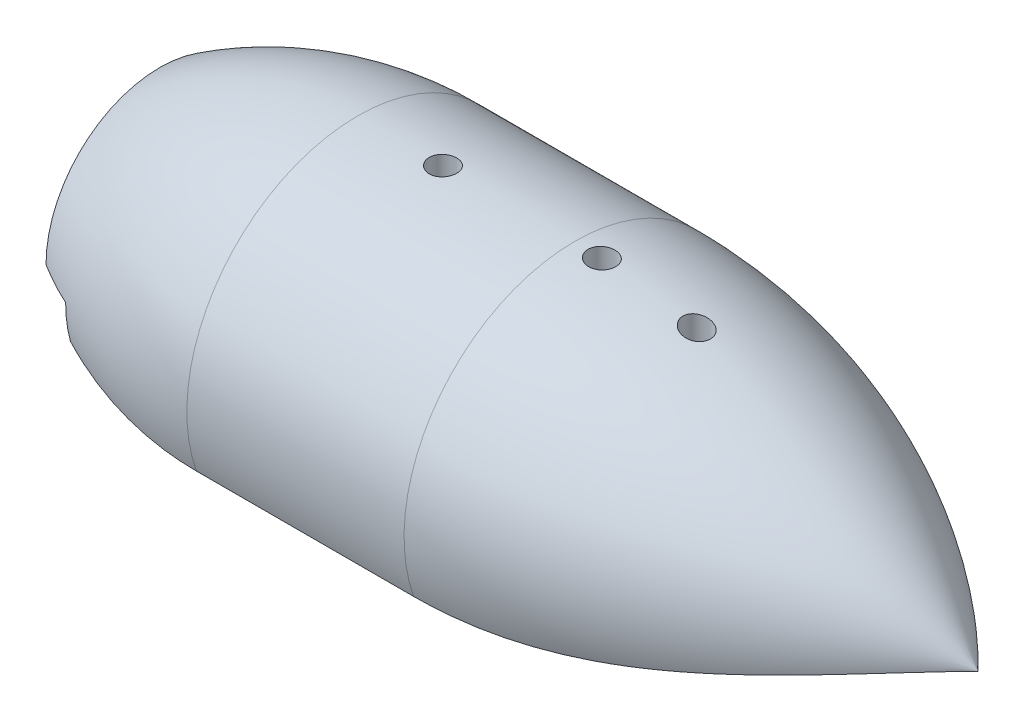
ISO-10303-21;
HEADER;
FILE_DESCRIPTION(('STEP AP214'),'2;1');
FILE_NAME('part.step','',(''),(''),'','','');
FILE_SCHEMA(('AUTOMOTIVE_DESIGN { 1 0 10303 214 1 1 1 1 }'));
ENDSEC;
DATA;
#1=APPLICATION_CONTEXT('core data for automotive mechanical design processes');
#2=APPLICATION_PROTOCOL_DEFINITION('international standard','automotive_design',2000,#1);
#3=PRODUCT_CONTEXT('',#1,'mechanical');
#4=PRODUCT('Part','Part','',(#3));
#5=PRODUCT_RELATED_PRODUCT_CATEGORY('part','',(#4));
#6=PRODUCT_DEFINITION_FORMATION('','',#4);
#7=PRODUCT_DEFINITION_CONTEXT('part definition',#1,'design');
#8=PRODUCT_DEFINITION('design','',#6,#7);
#9=PRODUCT_DEFINITION_SHAPE('','',#8);
#10=(LENGTH_UNIT() NAMED_UNIT(*) SI_UNIT(.MILLI.,.METRE.));
#11=(NAMED_UNIT(*) PLANE_ANGLE_UNIT() SI_UNIT($,.RADIAN.));
#12=(NAMED_UNIT(*) SI_UNIT($,.STERADIAN.) SOLID_ANGLE_UNIT());
#13=UNCERTAINTY_MEASURE_WITH_UNIT(LENGTH_MEASURE(1.E-05),#10,'distance_accuracy_value','');
#14=(GEOMETRIC_REPRESENTATION_CONTEXT(3) GLOBAL_UNCERTAINTY_ASSIGNED_CONTEXT((#13)) GLOBAL_UNIT_ASSIGNED_CONTEXT((#10,
#11,#12)) REPRESENTATION_CONTEXT('',''));
#15=CARTESIAN_POINT('',(0.,0.,0.));
#16=DIRECTION('',(0.,0.,1.));
#17=DIRECTION('',(1.,0.,0.));
#18=AXIS2_PLACEMENT_3D('',#15,#16,#17);
#19=CARTESIAN_POINT('',(42.3417985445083,12.954,-11.8035781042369));
#20=DIRECTION('',(-1.,0.,0.));
#21=DIRECTION('',(0.,0.,1.));
#22=AXIS2_PLACEMENT_3D('',#19,#20,#21);
#23=PLANE('',#22);
#24=CARTESIAN_POINT('',(42.3417985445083,-27.78125,0.));
#25=DIRECTION('',(-1.,0.,0.));
#26=DIRECTION('',(0.,0.,1.));
#27=AXIS2_PLACEMENT_3D('',#24,#25,#26);
#28=CIRCLE('',#27,27.78125);
#29=CARTESIAN_POINT('',(42.3417985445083,-0.181172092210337,-3.1675781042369));
#30=VERTEX_POINT('',#29);
#31=CARTESIAN_POINT('',(42.3417985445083,-1.94659111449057,-10.2160781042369));
#32=VERTEX_POINT('',#31);
#33=EDGE_CURVE('E916',#30,#32,#28,.T.);
#34=ORIENTED_EDGE('',*,*,#33,.F.);
#35=DIRECTION('',(0.,-1.,0.));
#36=VECTOR('',#35,1.);
#37=CARTESIAN_POINT('',(42.3417985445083,10.16,-3.16757810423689));
#38=LINE('',#37,#36);
#39=CARTESIAN_POINT('',(42.3417985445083,10.16,-3.16757810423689));
#40=VERTEX_POINT('',#39);
#41=EDGE_CURVE('E872',#40,#30,#38,.T.);
#42=ORIENTED_EDGE('',*,*,#41,.F.);
#43=DIRECTION('',(0.,-1.,0.));
#44=VECTOR('',#43,1.);
#45=CARTESIAN_POINT('',(42.3417985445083,29.9803841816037,-3.1675781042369));
#46=LINE('',#45,#44);
#47=CARTESIAN_POINT('',(42.3417985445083,12.954,-3.1675781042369));
#48=VERTEX_POINT('',#47);
#49=EDGE_CURVE('E995',#48,#40,#46,.T.);
#50=ORIENTED_EDGE('',*,*,#49,.F.);
#51=DIRECTION('',(0.,0.,-1.));
#52=VECTOR('',#51,1.);
#53=CARTESIAN_POINT('',(42.3417985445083,12.954,-11.8035781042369));
#54=LINE('',#53,#52);
#55=CARTESIAN_POINT('',(42.3417985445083,12.954,-10.2160781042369));
#56=VERTEX_POINT('',#55);
#57=EDGE_CURVE('E899',#48,#56,#54,.T.);
#58=ORIENTED_EDGE('',*,*,#57,.T.);
#59=DIRECTION('',(0.,-1.,0.));
#60=VECTOR('',#59,1.);
#61=CARTESIAN_POINT('',(42.3417985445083,-8.10299076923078,-10.2160781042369));
#62=LINE('',#61,#60);
#63=EDGE_CURVE('E406',#56,#32,#62,.T.);
#64=ORIENTED_EDGE('',*,*,#63,.T.);
#65=EDGE_LOOP('',(#34,#42,#50,#58,#64));
#66=FACE_BOUND('',#65,.T.);
#67=ADVANCED_FACE('F33',(#66),#23,.T.);
#68=CARTESIAN_POINT('',(42.3417985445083,-27.78125,0.));
#69=DIRECTION('',(-1.,0.,0.));
#70=DIRECTION('',(0.,0.,1.));
#71=AXIS2_PLACEMENT_3D('',#68,#69,#70);
#72=CIRCLE('',#71,27.78125);
#73=CARTESIAN_POINT('',(42.3417985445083,-1.95246588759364,10.2309218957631));
#74=VERTEX_POINT('',#73);
#75=CARTESIAN_POINT('',(42.3417985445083,-0.182879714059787,3.1824218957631));
#76=VERTEX_POINT('',#75);
#77=EDGE_CURVE('E931',#74,#76,#72,.T.);
#78=ORIENTED_EDGE('',*,*,#77,.F.);
#79=DIRECTION('',(0.,-1.,0.));
#80=VECTOR('',#79,1.);
#81=CARTESIAN_POINT('',(42.3417985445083,12.954,10.2309218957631));
#82=LINE('',#81,#80);
#83=CARTESIAN_POINT('',(42.3417985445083,12.954,10.2309218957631));
#84=VERTEX_POINT('',#83);
#85=EDGE_CURVE('E404',#74,#84,#82,.F.);
#86=ORIENTED_EDGE('',*,*,#85,.T.);
#87=CARTESIAN_POINT('',(42.3417985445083,12.954,3.18242189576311));
#88=VERTEX_POINT('',#87);
#89=EDGE_CURVE('E900',#84,#88,#54,.T.);
#90=ORIENTED_EDGE('',*,*,#89,.T.);
#91=DIRECTION('',(0.,-1.,0.));
#92=VECTOR('',#91,1.);
#93=CARTESIAN_POINT('',(42.3417985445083,29.9803841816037,3.18242189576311));
#94=LINE('',#93,#92);
#95=CARTESIAN_POINT('',(42.3417985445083,10.16,3.1824218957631));
#96=VERTEX_POINT('',#95);
#97=EDGE_CURVE('E965',#96,#88,#94,.F.);
#98=ORIENTED_EDGE('',*,*,#97,.F.);
#99=DIRECTION('',(0.,-1.,0.));
#100=VECTOR('',#99,1.);
#101=CARTESIAN_POINT('',(42.3417985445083,10.16,3.1824218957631));
#102=LINE('',#101,#100);
#103=EDGE_CURVE('E869',#96,#76,#102,.T.);
#104=ORIENTED_EDGE('',*,*,#103,.T.);
#105=EDGE_LOOP('',(#78,#86,#90,#98,#104));
#106=FACE_BOUND('',#105,.T.);
#107=ADVANCED_FACE('F733',(#106),#23,.T.);
#108=CARTESIAN_POINT('',(24.13,0.,0.));
#109=DIRECTION('',(-1.,0.,0.));
#110=DIRECTION('',(0.,0.,1.));
#111=AXIS2_PLACEMENT_3D('',#108,#109,#110);
#112=CYLINDRICAL_SURFACE('',#111,7.9375);
#113=CARTESIAN_POINT('',(10.9132781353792,0.,0.));
#114=DIRECTION('',(1.,0.,0.));
#115=DIRECTION('',(0.,0.,-1.));
#116=AXIS2_PLACEMENT_3D('',#113,#114,#115);
#117=CIRCLE('',#116,7.9375);
#118=CARTESIAN_POINT('',(10.9132781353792,0.,-7.9375));
#119=VERTEX_POINT('',#118);
#120=CARTESIAN_POINT('',(10.9132781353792,-1.00201309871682,-7.874));
#121=VERTEX_POINT('',#120);
#122=EDGE_CURVE('E481',#119,#121,#117,.F.);
#123=ORIENTED_EDGE('',*,*,#122,.T.);
#124=DIRECTION('',(-1.,0.,0.));
#125=VECTOR('',#124,1.);
#126=CARTESIAN_POINT('',(24.13,-1.00201309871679,-7.874));
#127=LINE('',#126,#125);
#128=CARTESIAN_POINT('',(18.9229985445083,-1.00201309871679,-7.874));
#129=VERTEX_POINT('',#128);
#130=EDGE_CURVE('E854',#121,#129,#127,.F.);
#131=ORIENTED_EDGE('',*,*,#130,.T.);
#132=CARTESIAN_POINT('',(18.9229985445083,0.,0.));
#133=DIRECTION('',(1.,0.,0.));
#134=DIRECTION('',(0.,0.,-1.));
#135=AXIS2_PLACEMENT_3D('',#132,#133,#134);
#136=CIRCLE('',#135,7.9375);
#137=CARTESIAN_POINT('',(18.9229985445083,1.00201309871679,-7.874));
#138=VERTEX_POINT('',#137);
#139=EDGE_CURVE('E807',#138,#129,#136,.F.);
#140=ORIENTED_EDGE('',*,*,#139,.F.);
#141=DIRECTION('',(-1.,0.,0.));
#142=VECTOR('',#141,1.);
#143=CARTESIAN_POINT('',(24.13,1.00201309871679,-7.874));
#144=LINE('',#143,#142);
#145=CARTESIAN_POINT('',(16.5099985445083,1.00201309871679,-7.874));
#146=VERTEX_POINT('',#145);
#147=EDGE_CURVE('E850',#138,#146,#144,.T.);
#148=ORIENTED_EDGE('',*,*,#147,.T.);
#149=CARTESIAN_POINT('',(16.5099985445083,1.00201309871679,-7.874));
#150=CARTESIAN_POINT('',(16.4805623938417,1.0018736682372,-7.87401307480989));
#151=CARTESIAN_POINT('',(16.451390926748,1.0052282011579,-7.87359153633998));
#152=CARTESIAN_POINT('',(16.3948993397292,1.01738307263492,-7.87203223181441));
#153=CARTESIAN_POINT('',(16.3675518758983,1.02605419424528,-7.87091144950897));
#154=CARTESIAN_POINT('',(16.30293734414,1.0521291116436,-7.867474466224));
#155=CARTESIAN_POINT('',(16.2666031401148,1.07169678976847,-7.86484921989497));
#156=CARTESIAN_POINT('',(16.1967752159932,1.11585203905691,-7.8587081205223));
#157=CARTESIAN_POINT('',(16.1633221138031,1.14049861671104,-7.85518166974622));
#158=CARTESIAN_POINT('',(16.074983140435,1.21191107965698,-7.84456834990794));
#159=CARTESIAN_POINT('',(16.0225546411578,1.26154945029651,-7.83677777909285));
#160=CARTESIAN_POINT('',(15.9219246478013,1.3647198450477,-7.8194776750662));
#161=CARTESIAN_POINT('',(15.8737356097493,1.41826254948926,-7.80996331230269));
#162=CARTESIAN_POINT('',(15.7800189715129,1.52759368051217,-7.78931731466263));
#163=CARTESIAN_POINT('',(15.7344992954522,1.58338803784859,-7.7781811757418));
#164=CARTESIAN_POINT('',(15.6454872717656,1.69610975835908,-7.75438201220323));
#165=CARTESIAN_POINT('',(15.6019923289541,1.75303552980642,-7.74172102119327));
#166=CARTESIAN_POINT('',(15.4874008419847,1.90655157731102,-7.70575882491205));
#167=CARTESIAN_POINT('',(15.4176308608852,2.00381087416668,-7.68107329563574));
#168=CARTESIAN_POINT('',(15.2810463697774,2.19922926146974,-7.62742364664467));
#169=CARTESIAN_POINT('',(15.2142326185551,2.29738857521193,-7.59845843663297));
#170=CARTESIAN_POINT('',(15.0173110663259,2.59254800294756,-7.50501065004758));
#171=CARTESIAN_POINT('',(14.8908863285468,2.79000316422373,-7.43402801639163));
#172=CARTESIAN_POINT('',(14.6474919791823,3.18304104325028,-7.27441743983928));
#173=CARTESIAN_POINT('',(14.5305060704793,3.37862645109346,-7.18582086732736));
#174=CARTESIAN_POINT('',(14.3071545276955,3.76650188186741,-6.99031281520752));
#175=CARTESIAN_POINT('',(14.2007789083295,3.95879485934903,-6.88341881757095));
#176=CARTESIAN_POINT('',(14.035605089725,4.27266997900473,-6.69099032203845));
#177=CARTESIAN_POINT('',(13.9730995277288,4.39565070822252,-6.61090182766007));
#178=CARTESIAN_POINT('',(13.8545239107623,4.63900831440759,-6.4424717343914));
#179=CARTESIAN_POINT('',(13.7984541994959,4.75938505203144,-6.35412969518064));
#180=CARTESIAN_POINT('',(13.6419011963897,5.11478183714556,-6.07722221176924));
#181=CARTESIAN_POINT('',(13.5524138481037,5.34529622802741,-5.87603248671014));
#182=CARTESIAN_POINT('',(13.4372691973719,5.71454077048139,-5.51282211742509));
#183=CARTESIAN_POINT('',(13.4002971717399,5.85850664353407,-5.35970766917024));
#184=CARTESIAN_POINT('',(13.3619395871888,6.06664060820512,-5.11967704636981));
#185=CARTESIAN_POINT('',(13.3519997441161,6.13492009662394,-5.03766363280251));
#186=CARTESIAN_POINT('',(13.3385280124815,6.26842329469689,-4.87055002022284));
#187=CARTESIAN_POINT('',(13.3350025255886,6.33364388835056,-4.78544682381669));
#188=CARTESIAN_POINT('',(13.3349985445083,6.39713258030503,-4.699));
#189=B_SPLINE_CURVE_WITH_KNOTS('',3,(#149,#150,#151,#152,#153,#154,#155,#156,#157,#158,#159,
#160,#161,#162,#163,#164,#165,#166,#167,#168,#169,#170,#171,#172,#173,#174,#175,#176,#177,#178,
#179,#180,#181,#182,#183,#184,#185,#186,#187,#188),.UNSPECIFIED.,.F.,.F.,(4,2,2,2,2,2,2,2,2,2,2,
2,2,2,2,2,2,2,2,4),(0.,0.0876972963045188,0.173343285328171,0.296691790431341,0.421563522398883,
0.638834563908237,0.856724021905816,1.07523057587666,1.29344888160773,1.65994206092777,
2.02652877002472,2.76055177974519,3.4932790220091,4.22531006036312,4.7035100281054,
5.18173552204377,6.13348655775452,6.77194976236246,7.09322556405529,7.41482183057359),.UNSPECIFIED.);
#190=CARTESIAN_POINT('',(13.3349985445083,6.39713258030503,-4.699));
#191=VERTEX_POINT('',#190);
#192=EDGE_CURVE('E505',#146,#191,#189,.T.);
#193=ORIENTED_EDGE('',*,*,#192,.T.);
#194=CARTESIAN_POINT('',(13.3349985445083,0.,0.));
#195=DIRECTION('',(1.,0.,0.));
#196=DIRECTION('',(0.,0.,-1.));
#197=AXIS2_PLACEMENT_3D('',#194,#195,#196);
#198=CIRCLE('',#197,7.9375);
#199=CARTESIAN_POINT('',(13.3349985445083,7.874,-1.00201309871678));
#200=VERTEX_POINT('',#199);
#201=EDGE_CURVE('E470',#200,#191,#198,.F.);
#202=ORIENTED_EDGE('',*,*,#201,.F.);
#203=DIRECTION('',(-1.,0.,0.));
#204=VECTOR('',#203,1.);
#205=CARTESIAN_POINT('',(24.13,7.874,-1.00201309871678));
#206=LINE('',#205,#204);
#207=CARTESIAN_POINT('',(18.9229985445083,7.874,-1.00201309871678));
#208=VERTEX_POINT('',#207);
#209=EDGE_CURVE('E860',#200,#208,#206,.F.);
#210=ORIENTED_EDGE('',*,*,#209,.T.);
#211=CARTESIAN_POINT('',(18.9229985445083,7.874,1.00201309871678));
#212=VERTEX_POINT('',#211);
#213=EDGE_CURVE('E809',#212,#208,#136,.F.);
#214=ORIENTED_EDGE('',*,*,#213,.F.);
#215=DIRECTION('',(-1.,0.,0.));
#216=VECTOR('',#215,1.);
#217=CARTESIAN_POINT('',(24.13,7.874,1.00201309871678));
#218=LINE('',#217,#216);
#219=CARTESIAN_POINT('',(13.3349985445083,7.874,1.00201309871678));
#220=VERTEX_POINT('',#219);
#221=EDGE_CURVE('E857',#212,#220,#218,.T.);
#222=ORIENTED_EDGE('',*,*,#221,.T.);
#223=CARTESIAN_POINT('',(13.3349985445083,6.39713258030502,4.699));
#224=VERTEX_POINT('',#223);
#225=EDGE_CURVE('E473',#224,#220,#198,.F.);
#226=ORIENTED_EDGE('',*,*,#225,.F.);
#227=CARTESIAN_POINT('',(13.3349985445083,6.39713258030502,4.699));
#228=CARTESIAN_POINT('',(13.3350089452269,6.31655620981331,4.80873725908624));
#229=CARTESIAN_POINT('',(13.3406846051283,6.2331812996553,4.91628571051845));
#230=CARTESIAN_POINT('',(13.3621034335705,6.06169493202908,5.1262062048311));
#231=CARTESIAN_POINT('',(13.3778294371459,5.97359178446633,5.22858675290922));
#232=CARTESIAN_POINT('',(13.4178047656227,5.79452782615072,5.42631768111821));
#233=CARTESIAN_POINT('',(13.4419281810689,5.70362638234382,5.52174802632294));
#234=CARTESIAN_POINT('',(13.4976803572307,5.51833678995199,5.7069281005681));
#235=CARTESIAN_POINT('',(13.5293131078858,5.42394681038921,5.79667477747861));
#236=CARTESIAN_POINT('',(13.6130043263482,5.19410732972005,6.00481628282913));
#237=CARTESIAN_POINT('',(13.6681834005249,5.05725406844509,6.12041420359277));
#238=CARTESIAN_POINT('',(13.7891030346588,4.77901553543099,6.34006031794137));
#239=CARTESIAN_POINT('',(13.8548478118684,4.63762847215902,6.444103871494));
#240=CARTESIAN_POINT('',(13.995848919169,4.34980924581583,6.64182718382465));
#241=CARTESIAN_POINT('',(14.0711993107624,4.20333933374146,6.7353844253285));
#242=CARTESIAN_POINT('',(14.2293454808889,3.90777721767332,6.91105882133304));
#243=CARTESIAN_POINT('',(14.3121369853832,3.75868655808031,6.99318247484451));
#244=CARTESIAN_POINT('',(14.5085530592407,3.41587750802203,7.16815689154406));
#245=CARTESIAN_POINT('',(14.6242564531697,3.2215102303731,7.25743009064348));
#246=CARTESIAN_POINT('',(14.8048385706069,2.92860703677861,7.37823641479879));
#247=CARTESIAN_POINT('',(14.8662972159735,2.83060539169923,7.41636662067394));
#248=CARTESIAN_POINT('',(14.9915123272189,2.63449934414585,7.488272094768));
#249=CARTESIAN_POINT('',(15.0552681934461,2.53639497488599,7.52204848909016));
#250=CARTESIAN_POINT('',(15.1844568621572,2.34155782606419,7.58494336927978));
#251=CARTESIAN_POINT('',(15.2498614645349,2.24482238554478,7.61411154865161));
#252=CARTESIAN_POINT('',(15.383514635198,2.05202487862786,7.66832047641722));
#253=CARTESIAN_POINT('',(15.4517657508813,1.95596350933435,7.69335742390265));
#254=CARTESIAN_POINT('',(15.5916333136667,1.76594777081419,7.73917321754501));
#255=CARTESIAN_POINT('',(15.6632326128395,1.67198567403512,7.75997134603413));
#256=CARTESIAN_POINT('',(15.7750033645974,1.53405047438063,7.78799117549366));
#257=CARTESIAN_POINT('',(15.8129588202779,1.48860635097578,7.79679614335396));
#258=CARTESIAN_POINT('',(15.8909141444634,1.39931230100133,7.81331439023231));
#259=CARTESIAN_POINT('',(15.9309129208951,1.35546154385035,7.82102824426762));
#260=CARTESIAN_POINT('',(16.0043140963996,1.28028378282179,7.8336377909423));
#261=CARTESIAN_POINT('',(16.0371049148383,1.24840434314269,7.8387727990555));
#262=CARTESIAN_POINT('',(16.1052402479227,1.18714378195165,7.84828333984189));
#263=CARTESIAN_POINT('',(16.1405897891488,1.15776783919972,7.85265731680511));
#264=CARTESIAN_POINT('',(16.2067638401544,1.10937898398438,7.8596214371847));
#265=CARTESIAN_POINT('',(16.2369210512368,1.08949723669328,7.86239286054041));
#266=CARTESIAN_POINT('',(16.2997068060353,1.05434623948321,7.86718311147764));
#267=CARTESIAN_POINT('',(16.3323146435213,1.03904281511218,7.86920754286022));
#268=CARTESIAN_POINT('',(16.3891309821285,1.01933880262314,7.87178031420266));
#269=CARTESIAN_POINT('',(16.4126371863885,1.01301213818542,7.87259439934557));
#270=CARTESIAN_POINT('',(16.4607126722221,1.00427739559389,7.87371207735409));
#271=CARTESIAN_POINT('',(16.4852924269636,1.00192747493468,7.87400809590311));
#272=CARTESIAN_POINT('',(16.5099985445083,1.00201309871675,7.874));
#273=B_SPLINE_CURVE_WITH_KNOTS('',3,(#227,#228,#229,#230,#231,#232,#233,#234,#235,#236,#237,
#238,#239,#240,#241,#242,#243,#244,#245,#246,#247,#248,#249,#250,#251,#252,#253,#254,#255,#256,
#257,#258,#259,#260,#261,#262,#263,#264,#265,#266,#267,#268,#269,#270,#271,#272),.UNSPECIFIED.,
.F.,.F.,(4,2,2,2,2,2,2,2,2,2,2,2,2,2,2,2,2,2,2,2,2,2,4),(0.,0.408109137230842,0.815523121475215,
1.21707430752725,1.61883932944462,2.18034368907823,2.74207272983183,3.3097994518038,
3.87720214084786,4.60575189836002,4.97107870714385,5.33631083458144,5.69728677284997,
6.05859299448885,6.41821703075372,6.59775998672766,6.7772079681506,6.91518883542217,
7.05344853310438,7.16190292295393,7.26952631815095,7.34227431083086,7.41607728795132),.UNSPECIFIED.);
#274=CARTESIAN_POINT('',(16.5099985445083,1.00201309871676,7.874));
#275=VERTEX_POINT('',#274);
#276=EDGE_CURVE('E498',#224,#275,#273,.T.);
#277=ORIENTED_EDGE('',*,*,#276,.T.);
#278=DIRECTION('',(-1.,0.,0.));
#279=VECTOR('',#278,1.);
#280=CARTESIAN_POINT('',(24.13,1.00201309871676,7.874));
#281=LINE('',#280,#279);
#282=CARTESIAN_POINT('',(18.9229985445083,1.00201309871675,7.874));
#283=VERTEX_POINT('',#282);
#284=EDGE_CURVE('E828',#275,#283,#281,.F.);
#285=ORIENTED_EDGE('',*,*,#284,.T.);
#286=CARTESIAN_POINT('',(18.9229985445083,-1.00201309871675,7.874));
#287=VERTEX_POINT('',#286);
#288=EDGE_CURVE('E395',#287,#283,#136,.F.);
#289=ORIENTED_EDGE('',*,*,#288,.F.);
#290=DIRECTION('',(-1.,0.,0.));
#291=VECTOR('',#290,1.);
#292=CARTESIAN_POINT('',(24.13,-1.00201309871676,7.874));
#293=LINE('',#292,#291);
#294=CARTESIAN_POINT('',(10.9132781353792,-1.00201309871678,7.874));
#295=VERTEX_POINT('',#294);
#296=EDGE_CURVE('E825',#287,#295,#293,.T.);
#297=ORIENTED_EDGE('',*,*,#296,.T.);
#298=CARTESIAN_POINT('',(10.9132781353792,0.,0.));
#299=DIRECTION('',(1.,0.,0.));
#300=DIRECTION('',(0.,0.,-1.));
#301=AXIS2_PLACEMENT_3D('',#298,#299,#300);
#302=CIRCLE('',#301,7.9375);
#303=CARTESIAN_POINT('',(10.9132781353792,0.,7.9375));
#304=VERTEX_POINT('',#303);
#305=EDGE_CURVE('E478',#295,#304,#302,.F.);
#306=ORIENTED_EDGE('',*,*,#305,.T.);
#307=DIRECTION('',(-1.,0.,0.));
#308=VECTOR('',#307,1.);
#309=CARTESIAN_POINT('',(24.13,0.,7.9375));
#310=LINE('',#309,#308);
#311=CARTESIAN_POINT('',(0.,0.,7.9375));
#312=VERTEX_POINT('',#311);
#313=EDGE_CURVE('E840',#304,#312,#310,.T.);
#314=ORIENTED_EDGE('',*,*,#313,.T.);
#315=CARTESIAN_POINT('',(0.,0.,0.));
#316=DIRECTION('',(-1.,0.,0.));
#317=DIRECTION('',(0.,0.,1.));
#318=AXIS2_PLACEMENT_3D('',#315,#316,#317);
#319=CIRCLE('',#318,7.9375);
#320=CARTESIAN_POINT('',(0.,0.,-7.9375));
#321=VERTEX_POINT('',#320);
#322=EDGE_CURVE('E390',#312,#321,#319,.T.);
#323=ORIENTED_EDGE('',*,*,#322,.T.);
#324=DIRECTION('',(-1.,0.,0.));
#325=VECTOR('',#324,1.);
#326=CARTESIAN_POINT('',(24.13,0.,-7.9375));
#327=LINE('',#326,#325);
#328=EDGE_CURVE('E836',#321,#119,#327,.F.);
#329=ORIENTED_EDGE('',*,*,#328,.T.);
#330=EDGE_LOOP('',(#123,#131,#140,#148,#193,#202,#210,#214,#222,#226,#277,#285,#289,#297,#306,
#314,#323,#329));
#331=FACE_BOUND('',#330,.T.);
#332=ADVANCED_FACE('F511',(#331),#112,.F.);
#333=CARTESIAN_POINT('',(87.63,0.,0.));
#334=DIRECTION('',(-1.,0.,0.));
#335=DIRECTION('',(0.,0.,1.));
#336=AXIS2_PLACEMENT_3D('',#333,#334,#335);
#337=CYLINDRICAL_SURFACE('',#336,18.288);
#338=CARTESIAN_POINT('',(28.8671172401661,18.288,0.));
#339=CARTESIAN_POINT('',(28.8675370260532,18.2879992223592,-0.082606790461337));
#340=CARTESIAN_POINT('',(28.8749213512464,18.2874343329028,-0.165234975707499));
#341=CARTESIAN_POINT('',(28.9034367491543,18.2852379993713,-0.328135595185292));
#342=CARTESIAN_POINT('',(28.9245834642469,18.2836053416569,-0.408405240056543));
#343=CARTESIAN_POINT('',(28.9800086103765,18.2794607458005,-0.564206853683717));
#344=CARTESIAN_POINT('',(29.0142796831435,18.2769493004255,-0.639741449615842));
#345=CARTESIAN_POINT('',(29.0949680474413,18.2713314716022,-0.783968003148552));
#346=CARTESIAN_POINT('',(29.1413827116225,18.2682252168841,-0.852661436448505));
#347=CARTESIAN_POINT('',(29.2451607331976,18.2617604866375,-0.9814379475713));
#348=CARTESIAN_POINT('',(29.3025470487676,18.2584014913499,-1.04150249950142));
#349=CARTESIAN_POINT('',(29.4265899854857,18.2518164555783,-1.15115832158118));
#350=CARTESIAN_POINT('',(29.493247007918,18.2485904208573,-1.20074913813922));
#351=CARTESIAN_POINT('',(29.6340473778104,18.2426326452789,-1.28810906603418));
#352=CARTESIAN_POINT('',(29.7082004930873,18.2399015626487,-1.32586248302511));
#353=CARTESIAN_POINT('',(29.8618188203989,18.235250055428,-1.38837598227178));
#354=CARTESIAN_POINT('',(29.9412839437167,18.2333296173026,-1.41313628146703));
#355=CARTESIAN_POINT('',(30.1030854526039,18.2305220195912,-1.44890840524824));
#356=CARTESIAN_POINT('',(30.185415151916,18.2296326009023,-1.4599502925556));
#357=CARTESIAN_POINT('',(30.350763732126,18.2289809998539,-1.46806444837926));
#358=CARTESIAN_POINT('',(30.4337826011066,18.2292187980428,-1.46513695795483));
#359=CARTESIAN_POINT('',(30.5979530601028,18.2307925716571,-1.44542088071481));
#360=CARTESIAN_POINT('',(30.6791084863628,18.2321260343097,-1.42866400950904));
#361=CARTESIAN_POINT('',(30.8374513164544,18.2357364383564,-1.38181329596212));
#362=CARTESIAN_POINT('',(30.9146386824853,18.2380133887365,-1.35171932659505));
#363=CARTESIAN_POINT('',(31.0629613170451,18.2432563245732,-1.27900986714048));
#364=CARTESIAN_POINT('',(31.1340891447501,18.2462231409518,-1.23637926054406));
#365=CARTESIAN_POINT('',(31.2681920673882,18.2525092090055,-1.13981788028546));
#366=CARTESIAN_POINT('',(31.3311670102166,18.255828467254,-1.08588689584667));
#367=CARTESIAN_POINT('',(31.4473617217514,18.2624548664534,-0.968074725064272));
#368=CARTESIAN_POINT('',(31.5005535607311,18.2657619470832,-0.904165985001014));
#369=CARTESIAN_POINT('',(31.5954574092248,18.2719801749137,-0.768310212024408));
#370=CARTESIAN_POINT('',(31.6371694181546,18.2748913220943,-0.696363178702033));
#371=CARTESIAN_POINT('',(31.7079243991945,18.2799874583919,-0.546461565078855));
#372=CARTESIAN_POINT('',(31.7369671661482,18.2821724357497,-0.468506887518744));
#373=CARTESIAN_POINT('',(31.7815446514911,18.2855668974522,-0.308806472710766));
#374=CARTESIAN_POINT('',(31.7970796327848,18.2867764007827,-0.227060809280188));
#375=CARTESIAN_POINT('',(31.8141668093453,18.2880786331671,-0.0623442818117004));
#376=CARTESIAN_POINT('',(31.8157580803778,18.2881744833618,0.0206225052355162));
#377=CARTESIAN_POINT('',(31.8050143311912,18.2872439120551,0.185642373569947));
#378=CARTESIAN_POINT('',(31.7926794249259,18.2862174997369,0.267695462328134));
#379=CARTESIAN_POINT('',(31.7544650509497,18.2831569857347,0.428455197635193));
#380=CARTESIAN_POINT('',(31.728602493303,18.281124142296,0.507165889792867));
#381=CARTESIAN_POINT('',(31.6640841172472,18.276276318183,0.659130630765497));
#382=CARTESIAN_POINT('',(31.625428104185,18.2734613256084,0.73238459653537));
#383=CARTESIAN_POINT('',(31.5363181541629,18.2673543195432,0.87153810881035));
#384=CARTESIAN_POINT('',(31.4858377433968,18.2640612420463,0.937420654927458));
#385=CARTESIAN_POINT('',(31.3745512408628,18.2573697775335,1.05979047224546));
#386=CARTESIAN_POINT('',(31.3137449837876,18.2539713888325,1.11627759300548));
#387=CARTESIAN_POINT('',(31.1833657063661,18.2474413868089,1.21838328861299));
#388=CARTESIAN_POINT('',(31.1137730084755,18.2443103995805,1.26397678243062));
#389=CARTESIAN_POINT('',(30.967895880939,18.2386765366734,1.34282973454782));
#390=CARTESIAN_POINT('',(30.8916115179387,18.23617365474,1.3760893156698));
#391=CARTESIAN_POINT('',(30.7346138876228,18.2320817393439,1.42928490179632));
#392=CARTESIAN_POINT('',(30.6539063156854,18.2304915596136,1.44923762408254));
#393=CARTESIAN_POINT('',(30.4902733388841,18.2284004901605,1.47530789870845));
#394=CARTESIAN_POINT('',(30.4073479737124,18.227899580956,1.48142569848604));
#395=CARTESIAN_POINT('',(30.2418870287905,18.2280436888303,1.47965118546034));
#396=CARTESIAN_POINT('',(30.159351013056,18.2286854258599,1.47179897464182));
#397=CARTESIAN_POINT('',(29.9967739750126,18.2310358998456,1.44238991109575));
#398=CARTESIAN_POINT('',(29.9167329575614,18.232744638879,1.42083303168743));
#399=CARTESIAN_POINT('',(29.7614097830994,18.2370366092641,1.36463492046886));
#400=CARTESIAN_POINT('',(29.6861276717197,18.2396198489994,1.32999356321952));
#401=CARTESIAN_POINT('',(29.5424410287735,18.2453709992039,1.24861435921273));
#402=CARTESIAN_POINT('',(29.4740363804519,18.2485388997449,1.20187671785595));
#403=CARTESIAN_POINT('',(29.3458402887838,18.255114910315,1.09747851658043));
#404=CARTESIAN_POINT('',(29.2860731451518,18.2585236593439,1.03978815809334));
#405=CARTESIAN_POINT('',(29.1770469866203,18.2651931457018,0.915176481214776));
#406=CARTESIAN_POINT('',(29.127790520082,18.2684538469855,0.848252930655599));
#407=CARTESIAN_POINT('',(29.0411239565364,18.2744675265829,0.706955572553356));
#408=CARTESIAN_POINT('',(29.0037346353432,18.2772196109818,0.632568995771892));
#409=CARTESIAN_POINT('',(28.9420246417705,18.2818979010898,0.478602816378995));
#410=CARTESIAN_POINT('',(28.917688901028,18.2838250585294,0.399029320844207));
#411=CARTESIAN_POINT('',(28.8889516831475,18.2861429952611,0.26582011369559));
#412=CARTESIAN_POINT('',(28.8805390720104,18.2868364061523,0.213020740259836));
#413=CARTESIAN_POINT('',(28.8694861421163,18.2877651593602,0.106817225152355));
#414=CARTESIAN_POINT('',(28.8668458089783,18.2880005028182,0.0534130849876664));
#415=CARTESIAN_POINT('',(28.8671172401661,18.288,0.));
#416=B_SPLINE_CURVE_WITH_KNOTS('',3,(#338,#339,#340,#341,#342,#343,#344,#345,#346,#347,#348,
#349,#350,#351,#352,#353,#354,#355,#356,#357,#358,#359,#360,#361,#362,#363,#364,#365,#366,#367,
#368,#369,#370,#371,#372,#373,#374,#375,#376,#377,#378,#379,#380,#381,#382,#383,#384,#385,#386,
#387,#388,#389,#390,#391,#392,#393,#394,#395,#396,#397,#398,#399,#400,#401,#402,#403,#404,#405,
#406,#407,#408,#409,#410,#411,#412,#413,#414,#415),.UNSPECIFIED.,.T.,.F.,(4,2,2,2,2,2,2,2,2,2,2,
2,2,2,2,2,2,2,2,2,2,2,2,2,2,2,2,2,2,2,2,2,2,2,2,2,2,2,4),(0.,0.247628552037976,
0.495539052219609,0.743310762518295,0.991028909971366,1.23927119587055,1.4875242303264,
1.73610502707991,1.98468167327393,2.23271261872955,2.48073928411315,2.72819871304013,
2.9756604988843,3.22342190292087,3.47118792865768,3.71965067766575,3.9681134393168,
4.21658022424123,4.46504217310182,4.71280761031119,4.96057102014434,5.20802545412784,
5.45548365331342,5.70350127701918,5.95152287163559,6.20011011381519,6.44869488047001,
6.69696676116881,6.94523420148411,7.19279012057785,7.44034652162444,7.68790529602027,
7.93545986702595,8.18369785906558,8.43199596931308,8.68072640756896,8.92916910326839,
9.08928472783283,9.24939995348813),.UNSPECIFIED.);
#417=CARTESIAN_POINT('',(28.8671172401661,18.288,0.));
#418=VERTEX_POINT('',#417);
#419=EDGE_CURVE('E1007',#418,#418,#416,.T.);
#420=ORIENTED_EDGE('',*,*,#419,.T.);
#421=EDGE_LOOP('',(#420));
#422=FACE_BOUND('',#421,.T.);
#423=CARTESIAN_POINT('',(21.1848567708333,0.,0.));
#424=DIRECTION('',(-1.,0.,0.));
#425=DIRECTION('',(0.,0.,1.));
#426=AXIS2_PLACEMENT_3D('',#423,#424,#425);
#427=CIRCLE('',#426,18.288);
#428=CARTESIAN_POINT('',(21.1848567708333,-6.01936457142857,17.2689951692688));
#429=VERTEX_POINT('',#428);
#430=CARTESIAN_POINT('',(21.1848567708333,-6.01936457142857,-17.2689951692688));
#431=VERTEX_POINT('',#430);
#432=EDGE_CURVE('E392',#429,#431,#427,.T.);
#433=ORIENTED_EDGE('',*,*,#432,.F.);
#434=DIRECTION('',(-1.,0.,0.));
#435=VECTOR('',#434,1.);
#436=CARTESIAN_POINT('',(43.815,-6.01936457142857,17.2689951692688));
#437=LINE('',#436,#435);
#438=CARTESIAN_POINT('',(44.45,-6.01936457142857,17.2689951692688));
#439=VERTEX_POINT('',#438);
#440=EDGE_CURVE('E1461',#429,#439,#437,.F.);
#441=ORIENTED_EDGE('',*,*,#440,.T.);
#442=CARTESIAN_POINT('',(44.45,0.,0.));
#443=DIRECTION('',(-1.,0.,0.));
#444=DIRECTION('',(0.,0.,1.));
#445=AXIS2_PLACEMENT_3D('',#442,#443,#444);
#446=CIRCLE('',#445,18.288);
#447=CARTESIAN_POINT('',(44.45,-6.01936457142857,-17.2689951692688));
#448=VERTEX_POINT('',#447);
#449=EDGE_CURVE('E385',#439,#448,#446,.T.);
#450=ORIENTED_EDGE('',*,*,#449,.T.);
#451=DIRECTION('',(-1.,0.,0.));
#452=VECTOR('',#451,1.);
#453=CARTESIAN_POINT('',(43.815,-6.01936457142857,-17.2689951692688));
#454=LINE('',#453,#452);
#455=EDGE_CURVE('E711',#448,#431,#454,.T.);
#456=ORIENTED_EDGE('',*,*,#455,.T.);
#457=EDGE_LOOP('',(#433,#441,#450,#456));
#458=FACE_BOUND('',#457,.T.);
#459=ADVANCED_FACE('F35',(#422,#458),#337,.T.);
#460=CARTESIAN_POINT('',(21.1848567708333,0.,0.));
#461=DIRECTION('',(-1.,0.,0.));
#462=DIRECTION('',(0.,0.,1.));
#463=AXIS2_PLACEMENT_3D('',#460,#461,#462);
#464=DEGENERATE_TOROIDAL_SURFACE('',#463,21.5708724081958,39.8588724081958,.F.);
#465=ORIENTED_EDGE('',*,*,#432,.T.);
#466=CARTESIAN_POINT('',(21.1850567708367,-6.01936457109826,-17.2689951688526));
#467=CARTESIAN_POINT('',(20.6447254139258,-6.01940056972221,-17.268990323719));
#468=CARTESIAN_POINT('',(20.1043968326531,-6.0121366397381,-17.2598850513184));
#469=CARTESIAN_POINT('',(19.0247481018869,-5.98325538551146,-17.2234226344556));
#470=CARTESIAN_POINT('',(18.4854279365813,-5.96163828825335,-17.1960657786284));
#471=CARTESIAN_POINT('',(17.4088706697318,-5.90430188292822,-17.1230552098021));
#472=CARTESIAN_POINT('',(16.8716332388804,-5.8685849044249,-17.0774045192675));
#473=CARTESIAN_POINT('',(15.8001266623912,-5.7835316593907,-16.967707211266));
#474=CARTESIAN_POINT('',(15.2658575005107,-5.73419546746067,-16.9036606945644));
#475=CARTESIAN_POINT('',(14.2134525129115,-5.62383364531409,-16.7587243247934));
#476=CARTESIAN_POINT('',(13.6952278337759,-5.56310228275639,-16.6782547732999));
#477=CARTESIAN_POINT('',(12.6633176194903,-5.43001572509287,-16.499472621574));
#478=CARTESIAN_POINT('',(12.1496325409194,-5.35765937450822,-16.4011582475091));
#479=CARTESIAN_POINT('',(11.1277908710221,-5.20225216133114,-16.1865455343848));
#480=CARTESIAN_POINT('',(10.619633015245,-5.11920380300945,-16.0702514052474));
#481=CARTESIAN_POINT('',(9.60950537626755,-4.94344478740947,-15.8194793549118));
#482=CARTESIAN_POINT('',(9.10753589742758,-4.85073365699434,-15.6850005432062));
#483=CARTESIAN_POINT('',(7.85983868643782,-4.60803955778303,-15.3254082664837));
#484=CARTESIAN_POINT('',(7.11844681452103,-4.45269781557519,-15.0887202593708));
#485=CARTESIAN_POINT('',(5.65395792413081,-4.12727085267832,-14.5732613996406));
#486=CARTESIAN_POINT('',(4.93085783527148,-3.95718812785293,-14.2944976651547));
#487=CARTESIAN_POINT('',(3.49236565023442,-3.60407834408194,-13.6889442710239));
#488=CARTESIAN_POINT('',(2.77733576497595,-3.42087561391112,-13.3613927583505));
#489=CARTESIAN_POINT('',(1.72233151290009,-3.14269358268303,-12.836610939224));
#490=CARTESIAN_POINT('',(1.37352331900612,-3.04938549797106,-12.656071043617));
#491=CARTESIAN_POINT('',(0.682019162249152,-2.86239563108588,-12.2838071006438));
#492=CARTESIAN_POINT('',(0.339323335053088,-2.76871384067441,-12.0920828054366));
#493=CARTESIAN_POINT('',(-0.000199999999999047,-2.67521806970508,-11.8947472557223));
#494=B_SPLINE_CURVE_WITH_KNOTS('',3,(#466,#467,#468,#469,#470,#471,#472,#473,#474,#475,#476,
#477,#478,#479,#480,#481,#482,#483,#484,#485,#486,#487,#488,#489,#490,#491,#492,#493),
.UNSPECIFIED.,.F.,.F.,(4,2,2,2,2,2,2,2,2,2,2,2,2,4),(0.,1.62086405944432,3.24170248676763,
4.86227323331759,6.48283510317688,8.06620396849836,9.64973031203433,11.2328864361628,
12.8161201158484,15.1953775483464,17.5742329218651,19.9951396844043,21.2060456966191,
22.4169785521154),.UNSPECIFIED.);
#495=CARTESIAN_POINT('',(4.572,-3.86848220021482,-14.1413361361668));
#496=VERTEX_POINT('',#495);
#497=EDGE_CURVE('E704',#431,#496,#494,.T.);
#498=ORIENTED_EDGE('',*,*,#497,.T.);
#499=CARTESIAN_POINT('',(4.572,0.,0.));
#500=DIRECTION('',(1.,0.,0.));
#501=DIRECTION('',(0.,1.,0.));
#502=AXIS2_PLACEMENT_3D('',#499,#500,#501);
#503=CIRCLE('',#502,14.6609188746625);
#504=CARTESIAN_POINT('',(4.572,0.,-14.6609188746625));
#505=VERTEX_POINT('',#504);
#506=EDGE_CURVE('E1051',#496,#505,#503,.T.);
#507=ORIENTED_EDGE('',*,*,#506,.T.);
#508=CARTESIAN_POINT('',(21.1848567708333,0.,21.5708724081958));
#509=DIRECTION('',(0.,1.,0.));
#510=DIRECTION('',(0.,0.,1.));
#511=AXIS2_PLACEMENT_3D('',#508,#509,#510);
#512=CIRCLE('',#511,39.8588724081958);
#513=CARTESIAN_POINT('',(0.,0.,-12.192));
#514=VERTEX_POINT('',#513);
#515=EDGE_CURVE('E1071',#505,#514,#512,.T.);
#516=ORIENTED_EDGE('',*,*,#515,.T.);
#517=CARTESIAN_POINT('',(0.,0.,0.));
#518=DIRECTION('',(-1.,0.,0.));
#519=DIRECTION('',(0.,0.,1.));
#520=AXIS2_PLACEMENT_3D('',#517,#518,#519);
#521=CIRCLE('',#520,12.192);
#522=CARTESIAN_POINT('',(0.,0.,12.192));
#523=VERTEX_POINT('',#522);
#524=EDGE_CURVE('E401',#523,#514,#521,.T.);
#525=ORIENTED_EDGE('',*,*,#524,.F.);
#526=CARTESIAN_POINT('',(21.1848567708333,0.,-21.5708724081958));
#527=DIRECTION('',(0.,1.,0.));
#528=DIRECTION('',(0.,0.,1.));
#529=AXIS2_PLACEMENT_3D('',#526,#527,#528);
#530=CIRCLE('',#529,39.8588724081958);
#531=CARTESIAN_POINT('',(4.572,0.,14.6609188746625));
#532=VERTEX_POINT('',#531);
#533=EDGE_CURVE('E1068',#523,#532,#530,.T.);
#534=ORIENTED_EDGE('',*,*,#533,.T.);
#535=CARTESIAN_POINT('',(4.572,-3.86848220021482,14.1413361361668));
#536=VERTEX_POINT('',#535);
#537=EDGE_CURVE('E1054',#532,#536,#503,.T.);
#538=ORIENTED_EDGE('',*,*,#537,.T.);
#539=CARTESIAN_POINT('',(-0.000200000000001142,-2.67521806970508,11.8947472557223));
#540=CARTESIAN_POINT('',(0.465693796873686,-2.80352437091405,12.1655423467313));
#541=CARTESIAN_POINT('',(0.937605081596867,-2.93217434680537,12.4257767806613));
#542=CARTESIAN_POINT('',(1.89274263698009,-3.18824432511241,12.9251995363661));
#543=CARTESIAN_POINT('',(2.37596852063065,-3.31566436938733,13.164388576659));
#544=CARTESIAN_POINT('',(3.35311523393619,-3.56738371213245,13.6218460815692));
#545=CARTESIAN_POINT('',(3.84703754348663,-3.69168257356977,13.8401116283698));
#546=CARTESIAN_POINT('',(4.84470771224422,-3.9353385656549,14.2558181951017));
#547=CARTESIAN_POINT('',(5.34845555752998,-4.05469570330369,14.4532592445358));
#548=CARTESIAN_POINT('',(6.84924609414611,-4.39726281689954,15.005741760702));
#549=CARTESIAN_POINT('',(7.85934898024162,-4.61116477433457,15.3318735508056));
#550=CARTESIAN_POINT('',(9.39544385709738,-4.90437511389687,15.7631350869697));
#551=CARTESIAN_POINT('',(9.91095065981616,-4.99750254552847,15.8972299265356));
#552=CARTESIAN_POINT('',(10.9483022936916,-5.17338805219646,16.1463841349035));
#553=CARTESIAN_POINT('',(11.4701467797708,-5.25614668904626,16.2614445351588));
#554=CARTESIAN_POINT('',(12.7390106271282,-5.44243945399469,16.5169585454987));
#555=CARTESIAN_POINT('',(13.4888258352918,-5.54016377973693,16.6478729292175));
#556=CARTESIAN_POINT('',(14.9968400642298,-5.70988882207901,16.8722465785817));
#557=CARTESIAN_POINT('',(15.7550377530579,-5.78189356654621,16.9657117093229));
#558=CARTESIAN_POINT('',(16.9030793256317,-5.86969970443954,17.078759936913));
#559=CARTESIAN_POINT('',(17.2908576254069,-5.89573255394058,17.1120797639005));
#560=CARTESIAN_POINT('',(18.0675493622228,-5.94049346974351,17.1691741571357));
#561=CARTESIAN_POINT('',(18.4564627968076,-5.95922155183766,17.1929487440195));
#562=CARTESIAN_POINT('',(19.2351325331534,-5.98924042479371,17.2309832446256));
#563=CARTESIAN_POINT('',(19.6248890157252,-6.00052941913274,17.2452408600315));
#564=CARTESIAN_POINT('',(20.4047818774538,-6.0155966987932,17.2642466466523));
#565=CARTESIAN_POINT('',(20.794918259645,-6.01937492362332,17.2689947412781));
#566=CARTESIAN_POINT('',(21.1850567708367,-6.01936457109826,17.2689951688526));
#567=B_SPLINE_CURVE_WITH_KNOTS('',3,(#539,#540,#541,#542,#543,#544,#545,#546,#547,#548,#549,
#550,#551,#552,#553,#554,#555,#556,#557,#558,#559,#560,#561,#562,#563,#564,#565,#566),
.UNSPECIFIED.,.F.,.F.,(4,2,2,2,2,2,2,2,2,2,2,2,2,4),(0.,1.66165255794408,3.32324836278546,
4.98507554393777,6.64690037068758,9.89081029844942,11.5126732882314,13.1344483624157,
15.4352643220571,17.7357197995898,18.9057946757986,20.0758670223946,21.2462218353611,
22.4165860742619),.UNSPECIFIED.);
#568=EDGE_CURVE('E612',#536,#429,#567,.T.);
#569=ORIENTED_EDGE('',*,*,#568,.T.);
#570=EDGE_LOOP('',(#465,#498,#507,#516,#525,#534,#538,#569));
#571=FACE_BOUND('',#570,.T.);
#572=ADVANCED_FACE('F713',(#571),#464,.F.);
#573=CARTESIAN_POINT('',(0.,0.,0.));
#574=DIRECTION('',(1.,0.,0.));
#575=DIRECTION('',(0.,0.,-1.));
#576=AXIS2_PLACEMENT_3D('',#573,#574,#575);
#577=PLANE('',#576);
#578=ORIENTED_EDGE('',*,*,#524,.T.);
#579=DIRECTION('',(0.,0.,1.));
#580=VECTOR('',#579,1.);
#581=CARTESIAN_POINT('',(0.,0.,0.));
#582=LINE('',#581,#580);
#583=EDGE_CURVE('E477',#514,#321,#582,.T.);
#584=ORIENTED_EDGE('',*,*,#583,.T.);
#585=ORIENTED_EDGE('',*,*,#322,.F.);
#586=EDGE_CURVE('E474',#312,#523,#582,.T.);
#587=ORIENTED_EDGE('',*,*,#586,.T.);
#588=EDGE_LOOP('',(#578,#584,#585,#587));
#589=FACE_BOUND('',#588,.T.);
#590=ADVANCED_FACE('F717',(#589),#577,.F.);
#591=CARTESIAN_POINT('',(44.45,0.,0.));
#592=DIRECTION('',(-1.,0.,0.));
#593=DIRECTION('',(0.,0.,1.));
#594=AXIS2_PLACEMENT_3D('',#591,#592,#593);
#595=DEGENERATE_TOROIDAL_SURFACE('',#594,41.8524678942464,60.1404678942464,.F.);
#596=CARTESIAN_POINT('',(87.6302,-1.3207853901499E-06,0.00856657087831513));
#597=CARTESIAN_POINT('',(87.6278861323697,-2.05677183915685E-06,0.0109533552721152));
#598=CARTESIAN_POINT('',(87.625572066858,-3.10028184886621E-06,0.0133399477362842));
#599=CARTESIAN_POINT('',(87.6140007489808,-9.85471543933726E-06,0.0252719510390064));
#600=CARTESIAN_POINT('',(87.6047405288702,-2.01762889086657E-05,0.0348144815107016));
#601=CARTESIAN_POINT('',(87.5584235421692,-9.63273682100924E-05,0.0825118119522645));
#602=CARTESIAN_POINT('',(87.5213193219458,-0.000235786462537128,0.120620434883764));
#603=CARTESIAN_POINT('',(87.3355415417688,-0.00132273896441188,0.310919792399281));
#604=CARTESIAN_POINT('',(87.1861108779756,-0.00343920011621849,0.46236591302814));
#605=CARTESIAN_POINT('',(86.7352790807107,-0.0134158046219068,0.914392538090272));
#606=CARTESIAN_POINT('',(86.4314781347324,-0.0249046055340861,1.21251477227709));
#607=CARTESIAN_POINT('',(85.8176408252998,-0.0569224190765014,1.8018396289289));
#608=CARTESIAN_POINT('',(85.5076034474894,-0.0774529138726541,2.0930411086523));
#609=CARTESIAN_POINT('',(84.5643128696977,-0.151975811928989,2.95948771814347));
#610=CARTESIAN_POINT('',(83.9217932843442,-0.218797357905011,3.52364663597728));
#611=CARTESIAN_POINT('',(82.6135544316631,-0.381269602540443,4.62020753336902));
#612=CARTESIAN_POINT('',(81.9478288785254,-0.476928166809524,5.15260080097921));
#613=CARTESIAN_POINT('',(80.5936462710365,-0.692013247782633,6.18460305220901));
#614=CARTESIAN_POINT('',(79.9051580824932,-0.81147354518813,6.6841640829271));
#615=CARTESIAN_POINT('',(78.5076052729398,-1.06895544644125,7.64854879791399));
#616=CARTESIAN_POINT('',(77.7985393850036,-1.20697819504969,8.11337033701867));
#617=CARTESIAN_POINT('',(76.4269179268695,-1.48334676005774,8.96662850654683));
#618=CARTESIAN_POINT('',(75.766044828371,-1.62050693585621,9.35816257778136));
#619=CARTESIAN_POINT('',(74.4292172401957,-1.90246025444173,10.1117740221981));
#620=CARTESIAN_POINT('',(73.7532611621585,-2.04725420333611,10.4738482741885));
#621=CARTESIAN_POINT('',(72.3870090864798,-2.34106641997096,11.168581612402));
#622=CARTESIAN_POINT('',(71.6967082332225,-2.49008612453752,11.5012305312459));
#623=CARTESIAN_POINT('',(70.3028095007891,-2.7890385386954,12.137161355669));
#624=CARTESIAN_POINT('',(69.5992100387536,-2.93897135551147,12.4404397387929));
#625=CARTESIAN_POINT('',(68.1784960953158,-3.23688318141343,13.0183633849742));
#626=CARTESIAN_POINT('',(67.4613606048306,-3.38485842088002,13.2929589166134));
#627=CARTESIAN_POINT('',(66.0157587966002,-3.67565433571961,13.8132883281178));
#628=CARTESIAN_POINT('',(65.2872936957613,-3.81847555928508,14.0590252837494));
#629=CARTESIAN_POINT('',(63.8199654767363,-4.09625936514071,14.52212041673));
#630=CARTESIAN_POINT('',(63.0811029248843,-4.23122237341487,14.7394801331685));
#631=CARTESIAN_POINT('',(61.5939484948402,-4.490811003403,15.1463374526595));
#632=CARTESIAN_POINT('',(60.8456565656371,-4.61543656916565,15.335834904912));
#633=CARTESIAN_POINT('',(59.3059514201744,-4.8575667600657,15.6955975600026));
#634=CARTESIAN_POINT('',(58.514142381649,-4.97447696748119,15.8645708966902));
#635=CARTESIAN_POINT('',(56.9226273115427,-5.19225408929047,16.1731501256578));
#636=CARTESIAN_POINT('',(56.1229212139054,-5.29312086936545,16.3127557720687));
#637=CARTESIAN_POINT('',(54.5169299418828,-5.47687905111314,16.5631220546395));
#638=CARTESIAN_POINT('',(53.710644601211,-5.5597699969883,16.6738819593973));
#639=CARTESIAN_POINT('',(52.0929172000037,-5.70599521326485,16.8669989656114));
#640=CARTESIAN_POINT('',(51.2814751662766,-5.76932958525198,16.9493562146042));
#641=CARTESIAN_POINT('',(49.6540259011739,-5.87529773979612,17.0860939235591));
#642=CARTESIAN_POINT('',(48.8380147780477,-5.91790976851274,17.1404449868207));
#643=CARTESIAN_POINT('',(47.2037779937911,-5.98152816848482,17.2212839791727));
#644=CARTESIAN_POINT('',(46.3855523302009,-6.0025345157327,17.2477718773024));
#645=CARTESIAN_POINT('',(44.7481431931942,-6.02254408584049,17.2730094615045));
#646=CARTESIAN_POINT('',(43.9289595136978,-6.02154105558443,17.2717512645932));
#647=CARTESIAN_POINT('',(42.7008617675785,-6.00354481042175,17.2490420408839));
#648=CARTESIAN_POINT('',(42.2915947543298,-5.99479686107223,17.2380012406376));
#649=CARTESIAN_POINT('',(41.4734582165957,-5.9718537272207,17.2089626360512));
#650=CARTESIAN_POINT('',(41.0645886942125,-5.95765851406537,17.1909647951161));
#651=CARTESIAN_POINT('',(40.6560011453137,-5.9407650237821,17.1694807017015));
#652=B_SPLINE_CURVE_WITH_KNOTS('',3,(#596,#597,#598,#599,#600,#601,#602,#603,#604,#605,#606,
#607,#608,#609,#610,#611,#612,#613,#614,#615,#616,#617,#618,#619,#620,#621,#622,#623,#624,#625,
#626,#627,#628,#629,#630,#631,#632,#633,#634,#635,#636,#637,#638,#639,#640,#641,#642,#643,#644,
#645,#646,#647,#648,#649,#650,#651),.UNSPECIFIED.,.F.,.F.,(4,2,2,2,2,2,2,2,2,2,2,2,2,2,2,2,2,2,
2,2,2,2,2,2,2,2,2,4),(0.,0.00997278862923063,0.0498639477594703,0.209428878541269,
0.847707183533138,2.12487151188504,3.40224527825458,5.97360075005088,8.54565822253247,
11.1213924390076,13.6972855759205,16.0374322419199,18.3778265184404,20.7190263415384,
23.0605066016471,25.4059814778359,27.7512061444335,30.0963035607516,32.4414136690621,
34.8947954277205,37.3481977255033,39.8016622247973,42.2551139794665,44.7111357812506,
47.1671603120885,49.6238826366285,50.8523282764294,52.0807803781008),.UNSPECIFIED.);
#653=CARTESIAN_POINT('',(87.63,-1.38516613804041E-06,0.00877287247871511));
#654=VERTEX_POINT('',#653);
#655=EDGE_CURVE('E370',#654,#439,#652,.T.);
#656=ORIENTED_EDGE('',*,*,#655,.F.);
#657=CARTESIAN_POINT('',(87.63,0.,0.));
#658=DIRECTION('',(-1.,0.,0.));
#659=DIRECTION('',(0.,0.,1.));
#660=AXIS2_PLACEMENT_3D('',#657,#658,#659);
#661=CIRCLE('',#660,0.00877287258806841);
#662=CARTESIAN_POINT('',(87.63,-1.38516613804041E-06,-0.00877287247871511));
#663=VERTEX_POINT('',#662);
#664=EDGE_CURVE('E383',#654,#663,#661,.T.);
#665=ORIENTED_EDGE('',*,*,#664,.T.);
#666=CARTESIAN_POINT('',(40.6560011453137,-5.94076502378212,-17.1694807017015));
#667=CARTESIAN_POINT('',(41.3783703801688,-5.97067243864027,-17.2074526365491));
#668=CARTESIAN_POINT('',(42.1016640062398,-5.99207858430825,-17.2345474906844));
#669=CARTESIAN_POINT('',(43.5490365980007,-6.01777132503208,-17.2670187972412));
#670=CARTESIAN_POINT('',(44.2731155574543,-6.02205805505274,-17.2723954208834));
#671=CARTESIAN_POINT('',(45.7208154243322,-6.01339657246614,-17.2614680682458));
#672=CARTESIAN_POINT('',(46.4444364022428,-6.00045291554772,-17.2451698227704));
#673=CARTESIAN_POINT('',(47.8903559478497,-5.9575442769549,-17.1908395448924));
#674=CARTESIAN_POINT('',(48.6126545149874,-5.92757928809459,-17.1528075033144));
#675=CARTESIAN_POINT('',(50.0535405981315,-5.85113880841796,-17.0549671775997));
#676=CARTESIAN_POINT('',(50.7721325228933,-5.80469421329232,-16.9951996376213));
#677=CARTESIAN_POINT('',(52.2059454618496,-5.69597160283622,-16.8536729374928));
#678=CARTESIAN_POINT('',(52.9211664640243,-5.63369353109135,-16.7719136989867));
#679=CARTESIAN_POINT('',(54.3472994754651,-5.49422056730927,-16.5861285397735));
#680=CARTESIAN_POINT('',(55.0582111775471,-5.41702462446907,-16.482101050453));
#681=CARTESIAN_POINT('',(56.4747280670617,-5.2488676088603,-16.2514599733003));
#682=CARTESIAN_POINT('',(57.1803331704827,-5.15790631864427,-16.1248460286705));
#683=CARTESIAN_POINT('',(58.6652990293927,-4.95251652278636,-15.8329458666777));
#684=CARTESIAN_POINT('',(59.4439122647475,-4.8365953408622,-15.6648981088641));
#685=CARTESIAN_POINT('',(60.9922139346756,-4.59153803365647,-15.2997853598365));
#686=CARTESIAN_POINT('',(61.7619021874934,-4.46240163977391,-15.1027197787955));
#687=CARTESIAN_POINT('',(63.291315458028,-4.19336455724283,-14.6789814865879));
#688=CARTESIAN_POINT('',(64.0510389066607,-4.05346219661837,-14.4523041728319));
#689=CARTESIAN_POINT('',(65.5592965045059,-3.7656526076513,-13.9688248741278));
#690=CARTESIAN_POINT('',(66.3078307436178,-3.61774544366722,-13.7120231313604));
#691=CARTESIAN_POINT('',(67.7932079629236,-3.31680650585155,-13.1675987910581));
#692=CARTESIAN_POINT('',(68.5300419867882,-3.16377106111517,-12.8799537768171));
#693=CARTESIAN_POINT('',(69.9904312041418,-2.85591095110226,-12.2735865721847));
#694=CARTESIAN_POINT('',(70.7139865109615,-2.70108630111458,-11.9548646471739));
#695=CARTESIAN_POINT('',(72.1466357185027,-2.3931361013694,-11.2861414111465));
#696=CARTESIAN_POINT('',(72.855733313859,-2.24001012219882,-10.9361482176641));
#697=CARTESIAN_POINT('',(74.2586469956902,-1.93906775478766,-10.2046970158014));
#698=CARTESIAN_POINT('',(74.9524638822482,-1.79125108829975,-9.82324065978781));
#699=CARTESIAN_POINT('',(76.1816866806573,-1.53445322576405,-9.11128456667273));
#700=CARTESIAN_POINT('',(76.7201193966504,-1.42377294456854,-8.78661080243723));
#701=CARTESIAN_POINT('',(77.7862589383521,-1.21014031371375,-8.11771147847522));
#702=CARTESIAN_POINT('',(78.3139661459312,-1.10718768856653,-7.77348661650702));
#703=CARTESIAN_POINT('',(79.3582793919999,-0.911023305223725,-7.06566838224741));
#704=CARTESIAN_POINT('',(79.8748827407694,-0.817813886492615,-6.70207038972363));
#705=CARTESIAN_POINT('',(80.8962825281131,-0.643263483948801,-5.95602882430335));
#706=CARTESIAN_POINT('',(81.4010802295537,-0.561921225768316,-5.57358728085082));
#707=CARTESIAN_POINT('',(82.3965561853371,-0.41349515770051,-4.79182205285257));
#708=CARTESIAN_POINT('',(82.8872794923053,-0.346360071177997,-4.39256553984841));
#709=CARTESIAN_POINT('',(83.8559326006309,-0.228110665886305,-3.57662789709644));
#710=CARTESIAN_POINT('',(84.3338638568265,-0.17699451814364,-3.15994876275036));
#711=CARTESIAN_POINT('',(85.2760834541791,-0.0929441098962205,-2.31034037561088));
#712=CARTESIAN_POINT('',(85.7403813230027,-0.0599968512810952,-1.87742297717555));
#713=CARTESIAN_POINT('',(86.6550616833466,-0.0143633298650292,-0.996206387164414));
#714=CARTESIAN_POINT('',(87.1054473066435,-0.00167247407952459,-0.547910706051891));
#715=CARTESIAN_POINT('',(87.5758002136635,-6.10528858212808E-05,-0.0646260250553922));
#716=CARTESIAN_POINT('',(87.6030138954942,-9.95163949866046E-06,-0.0366094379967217));
#717=CARTESIAN_POINT('',(87.6302,-1.32078538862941E-06,-0.00856657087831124));
#718=B_SPLINE_CURVE_WITH_KNOTS('',3,(#666,#667,#668,#669,#670,#671,#672,#673,#674,#675,#676,
#677,#678,#679,#680,#681,#682,#683,#684,#685,#686,#687,#688,#689,#690,#691,#692,#693,#694,#695,
#696,#697,#698,#699,#700,#701,#702,#703,#704,#705,#706,#707,#708,#709,#710,#711,#712,#713,#714,
#715,#716,#717),.UNSPECIFIED.,.F.,.F.,(4,2,2,2,2,2,2,2,2,2,2,2,2,2,2,2,2,2,2,2,2,2,2,2,2,4),(0.,
2.17182290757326,4.34362869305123,6.51486037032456,8.68609296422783,10.8532762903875,
13.0204673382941,15.1878110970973,17.3551890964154,19.7692899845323,22.1834399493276,
24.5979655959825,27.0124718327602,29.4287449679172,31.8449974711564,34.260624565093,
36.6761248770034,38.5909630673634,40.505732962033,42.4209615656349,44.3359843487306,
46.2439728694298,48.1517434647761,50.058147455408,51.9641191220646,52.0812925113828),.UNSPECIFIED.);
#719=EDGE_CURVE('E373',#448,#663,#718,.T.);
#720=ORIENTED_EDGE('',*,*,#719,.F.);
#721=ORIENTED_EDGE('',*,*,#449,.F.);
#722=EDGE_LOOP('',(#656,#665,#720,#721));
#723=FACE_BOUND('',#722,.T.);
#724=CARTESIAN_POINT('',(46.3377180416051,18.2278612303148,-1.05499689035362));
#725=CARTESIAN_POINT('',(46.278150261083,18.233046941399,-0.997770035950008));
#726=CARTESIAN_POINT('',(46.2233548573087,18.2380149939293,-0.935472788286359));
#727=CARTESIAN_POINT('',(46.1249185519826,18.2471763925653,-0.802485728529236));
#728=CARTESIAN_POINT('',(46.0812903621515,18.2513688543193,-0.731786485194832));
#729=CARTESIAN_POINT('',(46.0065047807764,18.2586773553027,-0.584036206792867));
#730=CARTESIAN_POINT('',(45.975344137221,18.2617936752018,-0.506986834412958));
#731=CARTESIAN_POINT('',(45.9264006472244,18.2667228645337,-0.34873210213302));
#732=CARTESIAN_POINT('',(45.9086143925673,18.2685360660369,-0.267527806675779));
#733=CARTESIAN_POINT('',(45.8869650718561,18.270721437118,-0.103541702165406));
#734=CARTESIAN_POINT('',(45.8830555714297,18.2710984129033,-0.0207660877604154));
#735=CARTESIAN_POINT('',(45.8891457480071,18.2703951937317,0.144267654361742));
#736=CARTESIAN_POINT('',(45.8991457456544,18.2693149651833,0.226525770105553));
#737=CARTESIAN_POINT('',(45.9327253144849,18.2657792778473,0.388008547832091));
#738=CARTESIAN_POINT('',(45.9562762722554,18.2633267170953,0.467239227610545));
#739=CARTESIAN_POINT('',(46.0162517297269,18.2572249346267,0.620617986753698));
#740=CARTESIAN_POINT('',(46.0526763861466,18.2535756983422,0.694766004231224));
#741=CARTESIAN_POINT('',(46.1374749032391,18.2453260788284,0.836107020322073));
#742=CARTESIAN_POINT('',(46.1858820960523,18.240723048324,0.903279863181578));
#743=CARTESIAN_POINT('',(46.2932180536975,18.2308875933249,1.02856168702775));
#744=CARTESIAN_POINT('',(46.3521470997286,18.2256551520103,1.08667042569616));
#745=CARTESIAN_POINT('',(46.4791725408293,18.2148777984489,1.19246178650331));
#746=CARTESIAN_POINT('',(46.5473109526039,18.2093315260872,1.24009382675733));
#747=CARTESIAN_POINT('',(46.6906212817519,18.1982928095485,1.32324426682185));
#748=CARTESIAN_POINT('',(46.7657933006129,18.1928003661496,1.35876249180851));
#749=CARTESIAN_POINT('',(46.9212137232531,18.1821689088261,1.41673652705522));
#750=CARTESIAN_POINT('',(47.0014720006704,18.177030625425,1.43916601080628));
#751=CARTESIAN_POINT('',(47.1646548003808,18.1673723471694,1.47019940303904));
#752=CARTESIAN_POINT('',(47.2475792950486,18.1628523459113,1.47880345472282));
#753=CARTESIAN_POINT('',(47.4135828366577,18.1546114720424,1.48191880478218));
#754=CARTESIAN_POINT('',(47.496661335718,18.1508891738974,1.47645547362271));
#755=CARTESIAN_POINT('',(47.660749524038,18.1443163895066,1.45162640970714));
#756=CARTESIAN_POINT('',(47.7417592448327,18.1414658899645,1.43226088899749));
#757=CARTESIAN_POINT('',(47.8991768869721,18.1366358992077,1.38023733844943));
#758=CARTESIAN_POINT('',(47.9755965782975,18.134654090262,1.34761513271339));
#759=CARTESIAN_POINT('',(48.121889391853,18.1314633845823,1.27000003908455));
#760=CARTESIAN_POINT('',(48.1917625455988,18.1302544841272,1.22500721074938));
#761=CARTESIAN_POINT('',(48.3229122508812,18.1284625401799,1.12397229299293));
#762=CARTESIAN_POINT('',(48.3841963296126,18.1278789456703,1.06793998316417));
#763=CARTESIAN_POINT('',(48.4965007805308,18.1271525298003,0.94638975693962));
#764=CARTESIAN_POINT('',(48.5475211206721,18.127009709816,0.880871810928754));
#765=CARTESIAN_POINT('',(48.6378778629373,18.1269740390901,0.742166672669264));
#766=CARTESIAN_POINT('',(48.6772073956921,18.1270813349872,0.668975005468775));
#767=CARTESIAN_POINT('',(48.7430269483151,18.1273750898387,0.5170299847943));
#768=CARTESIAN_POINT('',(48.7695169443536,18.12756154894,0.438276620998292));
#769=CARTESIAN_POINT('',(48.8089153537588,18.1278865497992,0.277403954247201));
#770=CARTESIAN_POINT('',(48.821817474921,18.1280250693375,0.19528311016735));
#771=CARTESIAN_POINT('',(48.8336520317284,18.1281881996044,0.0300407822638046));
#772=CARTESIAN_POINT('',(48.8325844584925,18.1282128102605,-0.0530807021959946));
#773=CARTESIAN_POINT('',(48.8165099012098,18.1281526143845,-0.217964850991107));
#774=CARTESIAN_POINT('',(48.8015028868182,18.1280678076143,-0.299727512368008));
#775=CARTESIAN_POINT('',(48.757975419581,18.1278629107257,-0.459572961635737));
#776=CARTESIAN_POINT('',(48.7294549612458,18.1277428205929,-0.537655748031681));
#777=CARTESIAN_POINT('',(48.6597092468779,18.1276009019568,-0.687926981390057));
#778=CARTESIAN_POINT('',(48.618483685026,18.127579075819,-0.760115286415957));
#779=CARTESIAN_POINT('',(48.5244983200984,18.127808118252,-0.896545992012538));
#780=CARTESIAN_POINT('',(48.4717385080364,18.1280589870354,-0.960788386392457));
#781=CARTESIAN_POINT('',(48.3561942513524,18.1290239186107,-1.07949182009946));
#782=CARTESIAN_POINT('',(48.2934115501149,18.1297379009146,-1.13395455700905));
#783=CARTESIAN_POINT('',(48.1596021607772,18.1318076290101,-1.23156512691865));
#784=CARTESIAN_POINT('',(48.0885755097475,18.1331633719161,-1.27471301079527));
#785=CARTESIAN_POINT('',(47.9403509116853,18.1366543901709,-1.34844711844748));
#786=CARTESIAN_POINT('',(47.8631569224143,18.1387891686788,-1.37904132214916));
#787=CARTESIAN_POINT('',(47.7047611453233,18.1439130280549,-1.42684627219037));
#788=CARTESIAN_POINT('',(47.6235595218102,18.1469020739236,-1.44405756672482));
#789=CARTESIAN_POINT('',(47.4594664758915,18.1537275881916,-1.46462439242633));
#790=CARTESIAN_POINT('',(47.3765752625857,18.1575639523,-1.46798162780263));
#791=CARTESIAN_POINT('',(47.211418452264,18.1659899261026,-1.46076662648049));
#792=CARTESIAN_POINT('',(47.1291530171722,18.1705797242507,-1.45019090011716));
#793=CARTESIAN_POINT('',(46.9674004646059,18.1803402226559,-1.41538523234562));
#794=CARTESIAN_POINT('',(46.8879204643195,18.185512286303,-1.39112268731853));
#795=CARTESIAN_POINT('',(46.7342417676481,18.196165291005,-1.32962949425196));
#796=CARTESIAN_POINT('',(46.6600371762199,18.2016458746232,-1.29241360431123));
#797=CARTESIAN_POINT('',(46.5442036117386,18.2106404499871,-1.22155987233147));
#798=CARTESIAN_POINT('',(46.5004101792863,18.2141572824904,-1.19139650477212));
#799=CARTESIAN_POINT('',(46.4163256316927,18.2210998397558,-1.12652037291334));
#800=CARTESIAN_POINT('',(46.3760345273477,18.2245255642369,-1.09180759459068));
#801=CARTESIAN_POINT('',(46.3377180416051,18.2278612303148,-1.05499689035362));
#802=B_SPLINE_CURVE_WITH_KNOTS('',3,(#724,#725,#726,#727,#728,#729,#730,#731,#732,#733,#734,
#735,#736,#737,#738,#739,#740,#741,#742,#743,#744,#745,#746,#747,#748,#749,#750,#751,#752,#753,
#754,#755,#756,#757,#758,#759,#760,#761,#762,#763,#764,#765,#766,#767,#768,#769,#770,#771,#772,
#773,#774,#775,#776,#777,#778,#779,#780,#781,#782,#783,#784,#785,#786,#787,#788,#789,#790,#791,
#792,#793,#794,#795,#796,#797,#798,#799,#800,#801),.UNSPECIFIED.,.T.,.F.,(4,2,2,2,2,2,2,2,2,2,2,
2,2,2,2,2,2,2,2,2,2,2,2,2,2,2,2,2,2,2,2,2,2,2,2,2,2,2,4),(0.,0.248103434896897,
0.496488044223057,0.744807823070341,0.993064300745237,1.24048927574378,1.48791995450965,
1.73483008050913,1.98174321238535,2.22935106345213,2.47696553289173,2.72575045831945,
2.97453897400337,3.22382618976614,3.47311082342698,3.72194618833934,3.97077775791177,
4.21894132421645,4.46710369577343,4.71504720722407,4.96299149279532,5.2110811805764,
5.45917132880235,5.70737631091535,5.95558145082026,6.20378713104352,6.45199291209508,
6.70020466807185,6.94841661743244,7.19658543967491,7.44475314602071,7.69276285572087,
7.9407624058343,8.18873144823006,8.43676260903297,8.68538711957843,8.93372928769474,
9.09331929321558,9.25290979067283),.UNSPECIFIED.);
#803=CARTESIAN_POINT('',(46.3377180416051,18.2278612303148,-1.05499689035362));
#804=VERTEX_POINT('',#803);
#805=EDGE_CURVE('E1029',#804,#804,#802,.T.);
#806=ORIENTED_EDGE('',*,*,#805,.F.);
#807=EDGE_LOOP('',(#806));
#808=FACE_BOUND('',#807,.T.);
#809=CARTESIAN_POINT('',(56.5133876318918,17.032134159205,-1.06983029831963));
#810=CARTESIAN_POINT('',(56.4540100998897,17.0477947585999,-1.01443637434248));
#811=CARTESIAN_POINT('',(56.3990509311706,17.0624947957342,-0.953964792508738));
#812=CARTESIAN_POINT('',(56.2996361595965,17.0893375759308,-0.824358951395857));
#813=CARTESIAN_POINT('',(56.2551890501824,17.1014782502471,-0.755217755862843));
#814=CARTESIAN_POINT('',(56.178219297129,17.1226379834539,-0.61004038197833));
#815=CARTESIAN_POINT('',(56.1457087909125,17.1316538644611,-0.53399728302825));
#816=CARTESIAN_POINT('',(56.093812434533,17.1460892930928,-0.377247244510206));
#817=CARTESIAN_POINT('',(56.0744227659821,17.1515098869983,-0.296541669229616));
#818=CARTESIAN_POINT('',(56.0497480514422,17.1583905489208,-0.134764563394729));
#819=CARTESIAN_POINT('',(56.0441454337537,17.159939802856,-0.0537452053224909));
#820=CARTESIAN_POINT('',(56.0463165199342,17.1592568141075,0.10809500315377));
#821=CARTESIAN_POINT('',(56.0540892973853,17.1570248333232,0.188915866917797));
#822=CARTESIAN_POINT('',(56.0825286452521,17.1489524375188,0.346883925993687));
#823=CARTESIAN_POINT('',(56.1030125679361,17.1431631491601,0.424066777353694));
#824=CARTESIAN_POINT('',(56.1560203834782,17.1283038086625,0.573838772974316));
#825=CARTESIAN_POINT('',(56.1885448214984,17.1192336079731,0.646427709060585));
#826=CARTESIAN_POINT('',(56.2651420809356,17.0980814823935,0.786107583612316));
#827=CARTESIAN_POINT('',(56.3093719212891,17.0859587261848,0.853106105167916));
#828=CARTESIAN_POINT('',(56.4078124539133,17.0593025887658,0.978767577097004));
#829=CARTESIAN_POINT('',(56.46202466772,17.0447688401,1.03742925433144));
#830=CARTESIAN_POINT('',(56.580807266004,17.0133761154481,1.14678773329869));
#831=CARTESIAN_POINT('',(56.6456569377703,16.9964569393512,1.19716387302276));
#832=CARTESIAN_POINT('',(56.7825582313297,16.961340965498,1.2863598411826));
#833=CARTESIAN_POINT('',(56.8546110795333,16.9431439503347,1.32517769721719));
#834=CARTESIAN_POINT('',(57.0063007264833,16.9055566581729,1.39134024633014));
#835=CARTESIAN_POINT('',(57.0861023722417,16.8861469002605,1.41829643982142));
#836=CARTESIAN_POINT('',(57.2491328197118,16.8473388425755,1.45825391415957));
#837=CARTESIAN_POINT('',(57.3323619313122,16.8279405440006,1.4712539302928));
#838=CARTESIAN_POINT('',(57.500999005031,16.7895339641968,1.48297228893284));
#839=CARTESIAN_POINT('',(57.5864211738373,16.7705334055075,1.48151315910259));
#840=CARTESIAN_POINT('',(57.7559878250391,16.7337295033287,1.46381728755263));
#841=CARTESIAN_POINT('',(57.840132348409,16.7159261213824,1.44758102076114));
#842=CARTESIAN_POINT('',(58.00392007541,16.6821257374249,1.40086285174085));
#843=CARTESIAN_POINT('',(58.0835964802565,16.6661141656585,1.37050807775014));
#844=CARTESIAN_POINT('',(58.23681995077,16.6360640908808,1.29633135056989));
#845=CARTESIAN_POINT('',(58.3103676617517,16.6220253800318,1.25251081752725));
#846=CARTESIAN_POINT('',(58.447651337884,16.5964171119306,1.15356327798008));
#847=CARTESIAN_POINT('',(58.511552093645,16.5848043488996,1.09867609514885));
#848=CARTESIAN_POINT('',(58.6292452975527,16.563844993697,0.978596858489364));
#849=CARTESIAN_POINT('',(58.6830387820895,16.5544981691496,0.913405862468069));
#850=CARTESIAN_POINT('',(58.7779249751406,16.5382881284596,0.775869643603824));
#851=CARTESIAN_POINT('',(58.8192326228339,16.5313824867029,0.703677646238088));
#852=CARTESIAN_POINT('',(58.8891724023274,16.5198376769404,0.553227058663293));
#853=CARTESIAN_POINT('',(58.9178053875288,16.515198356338,0.474968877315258));
#854=CARTESIAN_POINT('',(58.9612508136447,16.5082215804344,0.315568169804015));
#855=CARTESIAN_POINT('',(58.9762166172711,16.5058585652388,0.234468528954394));
#856=CARTESIAN_POINT('',(58.9924244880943,16.5033348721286,0.0708762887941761));
#857=CARTESIAN_POINT('',(58.9936670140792,16.5031741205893,-0.0116162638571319));
#858=CARTESIAN_POINT('',(58.9824171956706,16.5050485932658,-0.175254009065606));
#859=CARTESIAN_POINT('',(58.9699874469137,16.5070738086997,-0.25640362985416));
#860=CARTESIAN_POINT('',(58.9318732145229,16.5133095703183,-0.415438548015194));
#861=CARTESIAN_POINT('',(58.9061888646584,16.5175200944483,-0.493323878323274));
#862=CARTESIAN_POINT('',(58.8423167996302,16.5281353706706,-0.643711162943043));
#863=CARTESIAN_POINT('',(58.8041172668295,16.5345421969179,-0.716207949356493));
#864=CARTESIAN_POINT('',(58.7163788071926,16.5495356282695,-0.85372546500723));
#865=CARTESIAN_POINT('',(58.666839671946,16.558122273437,-0.918746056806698));
#866=CARTESIAN_POINT('',(58.5575403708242,16.5774889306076,-1.03995493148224));
#867=CARTESIAN_POINT('',(58.4977144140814,16.588283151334,-1.09608159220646));
#868=CARTESIAN_POINT('',(58.3698513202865,16.6119184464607,-1.19749978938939));
#869=CARTESIAN_POINT('',(58.3018137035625,16.6247596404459,-1.24279069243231));
#870=CARTESIAN_POINT('',(58.1585308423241,16.6524902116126,-1.32194248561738));
#871=CARTESIAN_POINT('',(58.0832005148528,16.6674049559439,-1.35564039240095));
#872=CARTESIAN_POINT('',(57.9282910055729,16.6988650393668,-1.40995711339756));
#873=CARTESIAN_POINT('',(57.8487115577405,16.7154104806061,-1.43057510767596));
#874=CARTESIAN_POINT('',(57.6859516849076,16.750091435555,-1.45857929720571));
#875=CARTESIAN_POINT('',(57.6027314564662,16.7682513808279,-1.46570381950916));
#876=CARTESIAN_POINT('',(57.4364413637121,16.8054019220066,-1.46585126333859));
#877=CARTESIAN_POINT('',(57.3533715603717,16.8243927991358,-1.45886937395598));
#878=CARTESIAN_POINT('',(57.1881370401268,16.8629894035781,-1.43079415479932));
#879=CARTESIAN_POINT('',(57.1060173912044,16.8826000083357,-1.4094425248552));
#880=CARTESIAN_POINT('',(56.94662524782,16.9214136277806,-1.35296171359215));
#881=CARTESIAN_POINT('',(56.8693479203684,16.9406170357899,-1.31784653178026));
#882=CARTESIAN_POINT('',(56.7447969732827,16.9720912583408,-1.24773436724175));
#883=CARTESIAN_POINT('',(56.6956725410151,16.9846590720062,-1.21610420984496));
#884=CARTESIAN_POINT('',(56.6013942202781,17.0090294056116,-1.14714097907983));
#885=CARTESIAN_POINT('',(56.5562402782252,17.0208319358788,-1.10980798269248));
#886=CARTESIAN_POINT('',(56.5133876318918,17.032134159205,-1.06983029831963));
#887=B_SPLINE_CURVE_WITH_KNOTS('',3,(#809,#810,#811,#812,#813,#814,#815,#816,#817,#818,#819,
#820,#821,#822,#823,#824,#825,#826,#827,#828,#829,#830,#831,#832,#833,#834,#835,#836,#837,#838,
#839,#840,#841,#842,#843,#844,#845,#846,#847,#848,#849,#850,#851,#852,#853,#854,#855,#856,#857,
#858,#859,#860,#861,#862,#863,#864,#865,#866,#867,#868,#869,#870,#871,#872,#873,#874,#875,#876,
#877,#878,#879,#880,#881,#882,#883,#884,#885,#886),.UNSPECIFIED.,.T.,.F.,(4,2,2,2,2,2,2,2,2,2,2,
2,2,2,2,2,2,2,2,2,2,2,2,2,2,2,2,2,2,2,2,2,2,2,2,2,2,2,4),(0.,0.247895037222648,0.49598968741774,
0.744335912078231,0.992609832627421,1.23510911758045,1.47759160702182,1.71666803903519,
1.95575529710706,2.19822837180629,2.44073843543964,2.69112682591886,2.94155792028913,
3.19967161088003,3.45780868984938,3.71911804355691,3.98041899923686,4.23941134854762,
4.49837639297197,4.75223823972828,5.00607404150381,5.25525211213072,5.50441340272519,
5.75074315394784,5.99706467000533,6.2422631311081,6.48745911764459,6.73288730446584,
6.97832000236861,7.22538512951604,7.47246469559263,7.72288811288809,7.97332722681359,
8.22857516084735,8.48391016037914,8.74396200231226,9.0037500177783,9.18265778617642,
9.36156313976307),.UNSPECIFIED.);
#888=CARTESIAN_POINT('',(56.5133876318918,17.032134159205,-1.06983029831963));
#889=VERTEX_POINT('',#888);
#890=EDGE_CURVE('E1037',#889,#889,#887,.T.);
#891=ORIENTED_EDGE('',*,*,#890,.F.);
#892=EDGE_LOOP('',(#891));
#893=FACE_BOUND('',#892,.T.);
#894=ADVANCED_FACE('F381',(#723,#808,#893),#595,.F.);
#895=CARTESIAN_POINT('',(87.63,0.,0.));
#896=DIRECTION('',(1.,0.,0.));
#897=DIRECTION('',(0.,0.,-1.));
#898=AXIS2_PLACEMENT_3D('',#895,#896,#897);
#899=PLANE('',#898);
#900=CARTESIAN_POINT('',(87.63,-27.78125,0.));
#901=DIRECTION('',(-1.,0.,0.));
#902=DIRECTION('',(0.,0.,1.));
#903=AXIS2_PLACEMENT_3D('',#900,#901,#902);
#904=CIRCLE('',#903,27.78125);
#905=EDGE_CURVE('E367',#654,#663,#904,.T.);
#906=ORIENTED_EDGE('',*,*,#905,.T.);
#907=ORIENTED_EDGE('',*,*,#664,.F.);
#908=EDGE_LOOP('',(#906,#907));
#909=FACE_BOUND('',#908,.T.);
#910=ADVANCED_FACE('F389',(#909),#899,.T.);
#911=CARTESIAN_POINT('',(18.9229985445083,12.954,-11.8035781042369));
#912=DIRECTION('',(1.,0.,0.));
#913=DIRECTION('',(0.,0.,-1.));
#914=AXIS2_PLACEMENT_3D('',#911,#912,#913);
#915=PLANE('',#914);
#916=CARTESIAN_POINT('',(18.9229985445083,-27.78125,0.));
#917=DIRECTION('',(1.,0.,0.));
#918=DIRECTION('',(0.,0.,-1.));
#919=AXIS2_PLACEMENT_3D('',#916,#917,#918);
#920=CIRCLE('',#919,27.78125);
#921=CARTESIAN_POINT('',(18.9229985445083,-1.94659111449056,-10.2160781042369));
#922=VERTEX_POINT('',#921);
#923=CARTESIAN_POINT('',(18.9229985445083,-1.13921600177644,-7.874));
#924=VERTEX_POINT('',#923);
#925=EDGE_CURVE('E1101',#922,#924,#920,.T.);
#926=ORIENTED_EDGE('',*,*,#925,.F.);
#927=DIRECTION('',(0.,-1.,0.));
#928=VECTOR('',#927,1.);
#929=CARTESIAN_POINT('',(18.9229985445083,12.954,-10.2160781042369));
#930=LINE('',#929,#928);
#931=CARTESIAN_POINT('',(18.9229985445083,12.954,-10.2160781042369));
#932=VERTEX_POINT('',#931);
#933=EDGE_CURVE('E444',#922,#932,#930,.F.);
#934=ORIENTED_EDGE('',*,*,#933,.T.);
#935=DIRECTION('',(0.,0.,1.));
#936=VECTOR('',#935,1.);
#937=CARTESIAN_POINT('',(18.9229985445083,12.954,-11.8035781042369));
#938=LINE('',#937,#936);
#939=CARTESIAN_POINT('',(18.9229985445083,12.954,10.2309218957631));
#940=VERTEX_POINT('',#939);
#941=EDGE_CURVE('E883',#932,#940,#938,.T.);
#942=ORIENTED_EDGE('',*,*,#941,.T.);
#943=DIRECTION('',(0.,-1.,0.));
#944=VECTOR('',#943,1.);
#945=CARTESIAN_POINT('',(18.9229985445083,-8.10299076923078,10.2309218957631));
#946=LINE('',#945,#944);
#947=CARTESIAN_POINT('',(18.9229985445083,-1.95246588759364,10.2309218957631));
#948=VERTEX_POINT('',#947);
#949=EDGE_CURVE('E441',#940,#948,#946,.T.);
#950=ORIENTED_EDGE('',*,*,#949,.T.);
#951=CARTESIAN_POINT('',(18.9229985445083,-1.13921600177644,7.87399999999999));
#952=VERTEX_POINT('',#951);
#953=EDGE_CURVE('E1104',#952,#948,#920,.T.);
#954=ORIENTED_EDGE('',*,*,#953,.F.);
#955=DIRECTION('',(0.,-1.,0.));
#956=VECTOR('',#955,1.);
#957=CARTESIAN_POINT('',(18.9229985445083,12.954,7.874));
#958=LINE('',#957,#956);
#959=EDGE_CURVE('E461',#287,#952,#958,.T.);
#960=ORIENTED_EDGE('',*,*,#959,.F.);
#961=ORIENTED_EDGE('',*,*,#288,.T.);
#962=DIRECTION('',(0.,-1.,0.));
#963=VECTOR('',#962,1.);
#964=CARTESIAN_POINT('',(18.9229985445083,7.874,7.874));
#965=LINE('',#964,#963);
#966=CARTESIAN_POINT('',(18.9229985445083,7.874,7.874));
#967=VERTEX_POINT('',#966);
#968=EDGE_CURVE('E821',#967,#283,#965,.T.);
#969=ORIENTED_EDGE('',*,*,#968,.F.);
#970=DIRECTION('',(0.,0.,1.));
#971=VECTOR('',#970,1.);
#972=CARTESIAN_POINT('',(18.9229985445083,7.874,-11.8035781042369));
#973=LINE('',#972,#971);
#974=EDGE_CURVE('E465',#212,#967,#973,.T.);
#975=ORIENTED_EDGE('',*,*,#974,.F.);
#976=ORIENTED_EDGE('',*,*,#213,.T.);
#977=DIRECTION('',(0.,0.,1.));
#978=VECTOR('',#977,1.);
#979=CARTESIAN_POINT('',(18.9229985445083,7.874,7.874));
#980=LINE('',#979,#978);
#981=CARTESIAN_POINT('',(18.9229985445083,7.874,-7.874));
#982=VERTEX_POINT('',#981);
#983=EDGE_CURVE('E838',#982,#208,#980,.T.);
#984=ORIENTED_EDGE('',*,*,#983,.F.);
#985=DIRECTION('',(0.,1.,0.));
#986=VECTOR('',#985,1.);
#987=CARTESIAN_POINT('',(18.9229985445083,12.954,-7.874));
#988=LINE('',#987,#986);
#989=EDGE_CURVE('E462',#138,#982,#988,.T.);
#990=ORIENTED_EDGE('',*,*,#989,.F.);
#991=ORIENTED_EDGE('',*,*,#139,.T.);
#992=DIRECTION('',(0.,1.,0.));
#993=VECTOR('',#992,1.);
#994=CARTESIAN_POINT('',(18.9229985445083,7.874,-7.874));
#995=LINE('',#994,#993);
#996=EDGE_CURVE('E835',#924,#129,#995,.T.);
#997=ORIENTED_EDGE('',*,*,#996,.F.);
#998=EDGE_LOOP('',(#926,#934,#942,#950,#954,#960,#961,#969,#975,#976,#984,#990,#991,#997));
#999=FACE_BOUND('',#998,.T.);
#1000=ADVANCED_FACE('F724',(#999),#915,.T.);
#1001=CARTESIAN_POINT('',(26.2127985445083,12.954,-3.29457810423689));
#1002=DIRECTION('',(0.,0.,1.));
#1003=DIRECTION('',(1.,0.,0.));
#1004=AXIS2_PLACEMENT_3D('',#1001,#1002,#1003);
#1005=PLANE('',#1004);
#1006=DIRECTION('',(-1.,0.,0.));
#1007=VECTOR('',#1006,1.);
#1008=CARTESIAN_POINT('',(87.63,-0.196043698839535,-3.29457810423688));
#1009=LINE('',#1008,#1007);
#1010=CARTESIAN_POINT('',(34.4677985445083,-0.196043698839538,-3.29457810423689));
#1011=VERTEX_POINT('',#1010);
#1012=CARTESIAN_POINT('',(26.2127985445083,-0.196043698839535,-3.29457810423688));
#1013=VERTEX_POINT('',#1012);
#1014=EDGE_CURVE('E779',#1011,#1013,#1009,.T.);
#1015=ORIENTED_EDGE('',*,*,#1014,.F.);
#1016=DIRECTION('',(0.,-1.,0.));
#1017=VECTOR('',#1016,1.);
#1018=CARTESIAN_POINT('',(34.4677985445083,12.954,-3.29457810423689));
#1019=LINE('',#1018,#1017);
#1020=CARTESIAN_POINT('',(34.4677985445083,12.954,-3.29457810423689));
#1021=VERTEX_POINT('',#1020);
#1022=EDGE_CURVE('E782',#1021,#1011,#1019,.T.);
#1023=ORIENTED_EDGE('',*,*,#1022,.F.);
#1024=DIRECTION('',(-1.,0.,0.));
#1025=VECTOR('',#1024,1.);
#1026=CARTESIAN_POINT('',(26.2127985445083,12.954,-3.29457810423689));
#1027=LINE('',#1026,#1025);
#1028=CARTESIAN_POINT('',(26.2127985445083,12.954,-3.29457810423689));
#1029=VERTEX_POINT('',#1028);
#1030=EDGE_CURVE('E875',#1021,#1029,#1027,.T.);
#1031=ORIENTED_EDGE('',*,*,#1030,.T.);
#1032=DIRECTION('',(0.,-1.,0.));
#1033=VECTOR('',#1032,1.);
#1034=CARTESIAN_POINT('',(26.2127985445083,12.954,-3.29457810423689));
#1035=LINE('',#1034,#1033);
#1036=EDGE_CURVE('E785',#1029,#1013,#1035,.T.);
#1037=ORIENTED_EDGE('',*,*,#1036,.T.);
#1038=EDGE_LOOP('',(#1015,#1023,#1031,#1037));
#1039=FACE_BOUND('',#1038,.T.);
#1040=ADVANCED_FACE('F729',(#1039),#1005,.T.);
#1041=CARTESIAN_POINT('',(26.2127985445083,12.954,-3.29457810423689));
#1042=DIRECTION('',(-1.,0.,0.));
#1043=DIRECTION('',(0.,0.,1.));
#1044=AXIS2_PLACEMENT_3D('',#1041,#1042,#1043);
#1045=PLANE('',#1044);
#1046=CARTESIAN_POINT('',(26.2127985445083,-27.78125,0.));
#1047=DIRECTION('',(-1.,0.,0.));
#1048=DIRECTION('',(0.,0.,1.));
#1049=AXIS2_PLACEMENT_3D('',#1046,#1047,#1048);
#1050=CIRCLE('',#1049,27.78125);
#1051=CARTESIAN_POINT('',(26.2127985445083,-1.94659111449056,-10.2160781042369));
#1052=VERTEX_POINT('',#1051);
#1053=EDGE_CURVE('E787',#1013,#1052,#1050,.T.);
#1054=ORIENTED_EDGE('',*,*,#1053,.F.);
#1055=ORIENTED_EDGE('',*,*,#1036,.F.);
#1056=DIRECTION('',(0.,0.,-1.));
#1057=VECTOR('',#1056,1.);
#1058=CARTESIAN_POINT('',(26.2127985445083,12.954,-3.29457810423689));
#1059=LINE('',#1058,#1057);
#1060=CARTESIAN_POINT('',(26.2127985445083,12.954,-10.2160781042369));
#1061=VERTEX_POINT('',#1060);
#1062=EDGE_CURVE('E877',#1029,#1061,#1059,.T.);
#1063=ORIENTED_EDGE('',*,*,#1062,.T.);
#1064=DIRECTION('',(0.,-1.,0.));
#1065=VECTOR('',#1064,1.);
#1066=CARTESIAN_POINT('',(26.2127985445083,-8.10299076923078,-10.2160781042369));
#1067=LINE('',#1066,#1065);
#1068=EDGE_CURVE('E433',#1061,#1052,#1067,.T.);
#1069=ORIENTED_EDGE('',*,*,#1068,.T.);
#1070=EDGE_LOOP('',(#1054,#1055,#1063,#1069));
#1071=FACE_BOUND('',#1070,.T.);
#1072=ADVANCED_FACE('F768',(#1071),#1045,.T.);
#1073=CARTESIAN_POINT('',(18.9229985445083,12.954,-11.8035781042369));
#1074=DIRECTION('',(0.,0.,1.));
#1075=DIRECTION('',(1.,0.,0.));
#1076=AXIS2_PLACEMENT_3D('',#1073,#1074,#1075);
#1077=PLANE('',#1076);
#1078=DIRECTION('',(-1.,0.,0.));
#1079=VECTOR('',#1078,1.);
#1080=CARTESIAN_POINT('',(87.63,-2.6322262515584,-11.8035781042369));
#1081=LINE('',#1080,#1079);
#1082=CARTESIAN_POINT('',(24.6252985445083,-2.6322262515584,-11.8035781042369));
#1083=VERTEX_POINT('',#1082);
#1084=CARTESIAN_POINT('',(20.5104985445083,-2.6322262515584,-11.8035781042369));
#1085=VERTEX_POINT('',#1084);
#1086=EDGE_CURVE('E1114',#1083,#1085,#1081,.T.);
#1087=ORIENTED_EDGE('',*,*,#1086,.F.);
#1088=DIRECTION('',(0.,-1.,0.));
#1089=VECTOR('',#1088,1.);
#1090=CARTESIAN_POINT('',(24.6252985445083,12.954,-11.8035781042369));
#1091=LINE('',#1090,#1089);
#1092=CARTESIAN_POINT('',(24.6252985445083,12.954,-11.8035781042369));
#1093=VERTEX_POINT('',#1092);
#1094=EDGE_CURVE('E439',#1083,#1093,#1091,.F.);
#1095=ORIENTED_EDGE('',*,*,#1094,.T.);
#1096=DIRECTION('',(-1.,0.,0.));
#1097=VECTOR('',#1096,1.);
#1098=CARTESIAN_POINT('',(18.9229985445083,12.954,-11.8035781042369));
#1099=LINE('',#1098,#1097);
#1100=CARTESIAN_POINT('',(20.5104985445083,12.954,-11.8035781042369));
#1101=VERTEX_POINT('',#1100);
#1102=EDGE_CURVE('E880',#1093,#1101,#1099,.T.);
#1103=ORIENTED_EDGE('',*,*,#1102,.T.);
#1104=DIRECTION('',(0.,-1.,0.));
#1105=VECTOR('',#1104,1.);
#1106=CARTESIAN_POINT('',(20.5104985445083,-8.10299076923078,-11.8035781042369));
#1107=LINE('',#1106,#1105);
#1108=EDGE_CURVE('E436',#1101,#1085,#1107,.T.);
#1109=ORIENTED_EDGE('',*,*,#1108,.T.);
#1110=EDGE_LOOP('',(#1087,#1095,#1103,#1109));
#1111=FACE_BOUND('',#1110,.T.);
#1112=ADVANCED_FACE('F763',(#1111),#1077,.T.);
#1113=CARTESIAN_POINT('',(18.9229985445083,12.954,11.8184218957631));
#1114=DIRECTION('',(0.,0.,-1.));
#1115=DIRECTION('',(-1.,0.,0.));
#1116=AXIS2_PLACEMENT_3D('',#1113,#1114,#1115);
#1117=PLANE('',#1116);
#1118=DIRECTION('',(-1.,0.,0.));
#1119=VECTOR('',#1118,1.);
#1120=CARTESIAN_POINT('',(87.63,-2.63919846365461,11.8184218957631));
#1121=LINE('',#1120,#1119);
#1122=CARTESIAN_POINT('',(20.5104985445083,-2.63919846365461,11.8184218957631));
#1123=VERTEX_POINT('',#1122);
#1124=CARTESIAN_POINT('',(24.6252985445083,-2.63919846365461,11.8184218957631));
#1125=VERTEX_POINT('',#1124);
#1126=EDGE_CURVE('E597',#1123,#1125,#1121,.F.);
#1127=ORIENTED_EDGE('',*,*,#1126,.F.);
#1128=DIRECTION('',(0.,-1.,0.));
#1129=VECTOR('',#1128,1.);
#1130=CARTESIAN_POINT('',(20.5104985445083,12.954,11.8184218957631));
#1131=LINE('',#1130,#1129);
#1132=CARTESIAN_POINT('',(20.5104985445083,12.954,11.8184218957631));
#1133=VERTEX_POINT('',#1132);
#1134=EDGE_CURVE('E454',#1123,#1133,#1131,.F.);
#1135=ORIENTED_EDGE('',*,*,#1134,.T.);
#1136=DIRECTION('',(1.,0.,0.));
#1137=VECTOR('',#1136,1.);
#1138=CARTESIAN_POINT('',(18.9229985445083,12.954,11.8184218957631));
#1139=LINE('',#1138,#1137);
#1140=CARTESIAN_POINT('',(24.6252985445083,12.954,11.8184218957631));
#1141=VERTEX_POINT('',#1140);
#1142=EDGE_CURVE('E886',#1133,#1141,#1139,.T.);
#1143=ORIENTED_EDGE('',*,*,#1142,.T.);
#1144=DIRECTION('',(0.,-1.,0.));
#1145=VECTOR('',#1144,1.);
#1146=CARTESIAN_POINT('',(24.6252985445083,-8.10299076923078,11.8184218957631));
#1147=LINE('',#1146,#1145);
#1148=EDGE_CURVE('E456',#1141,#1125,#1147,.T.);
#1149=ORIENTED_EDGE('',*,*,#1148,.T.);
#1150=EDGE_LOOP('',(#1127,#1135,#1143,#1149));
#1151=FACE_BOUND('',#1150,.T.);
#1152=ADVANCED_FACE('F760',(#1151),#1117,.T.);
#1153=CARTESIAN_POINT('',(26.2127985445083,12.954,11.8184218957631));
#1154=DIRECTION('',(-1.,0.,0.));
#1155=DIRECTION('',(0.,0.,1.));
#1156=AXIS2_PLACEMENT_3D('',#1153,#1154,#1155);
#1157=PLANE('',#1156);
#1158=CARTESIAN_POINT('',(26.2127985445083,-27.78125,0.));
#1159=DIRECTION('',(-1.,0.,0.));
#1160=DIRECTION('',(0.,0.,1.));
#1161=AXIS2_PLACEMENT_3D('',#1158,#1159,#1160);
#1162=CIRCLE('',#1161,27.78125);
#1163=CARTESIAN_POINT('',(26.2127985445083,-1.95246588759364,10.2309218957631));
#1164=VERTEX_POINT('',#1163);
#1165=CARTESIAN_POINT('',(26.2127985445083,-0.19782058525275,3.30942189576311));
#1166=VERTEX_POINT('',#1165);
#1167=EDGE_CURVE('E387',#1164,#1166,#1162,.T.);
#1168=ORIENTED_EDGE('',*,*,#1167,.F.);
#1169=DIRECTION('',(0.,-1.,0.));
#1170=VECTOR('',#1169,1.);
#1171=CARTESIAN_POINT('',(26.2127985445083,12.954,10.2309218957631));
#1172=LINE('',#1171,#1170);
#1173=CARTESIAN_POINT('',(26.2127985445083,12.954,10.2309218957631));
#1174=VERTEX_POINT('',#1173);
#1175=EDGE_CURVE('E459',#1164,#1174,#1172,.F.);
#1176=ORIENTED_EDGE('',*,*,#1175,.T.);
#1177=DIRECTION('',(0.,0.,-1.));
#1178=VECTOR('',#1177,1.);
#1179=CARTESIAN_POINT('',(26.2127985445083,12.954,11.8184218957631));
#1180=LINE('',#1179,#1178);
#1181=CARTESIAN_POINT('',(26.2127985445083,12.954,3.30942189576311));
#1182=VERTEX_POINT('',#1181);
#1183=EDGE_CURVE('E889',#1174,#1182,#1180,.T.);
#1184=ORIENTED_EDGE('',*,*,#1183,.T.);
#1185=DIRECTION('',(0.,-1.,0.));
#1186=VECTOR('',#1185,1.);
#1187=CARTESIAN_POINT('',(26.2127985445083,12.954,3.30942189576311));
#1188=LINE('',#1187,#1186);
#1189=EDGE_CURVE('E799',#1182,#1166,#1188,.T.);
#1190=ORIENTED_EDGE('',*,*,#1189,.T.);
#1191=EDGE_LOOP('',(#1168,#1176,#1184,#1190));
#1192=FACE_BOUND('',#1191,.T.);
#1193=ADVANCED_FACE('F756',(#1192),#1157,.T.);
#1194=CARTESIAN_POINT('',(26.2127985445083,12.954,3.30942189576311));
#1195=DIRECTION('',(0.,0.,-1.));
#1196=DIRECTION('',(-1.,0.,0.));
#1197=AXIS2_PLACEMENT_3D('',#1194,#1195,#1196);
#1198=PLANE('',#1197);
#1199=DIRECTION('',(-1.,0.,0.));
#1200=VECTOR('',#1199,1.);
#1201=CARTESIAN_POINT('',(87.63,-0.19782058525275,3.3094218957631));
#1202=LINE('',#1201,#1200);
#1203=CARTESIAN_POINT('',(34.4677985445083,-0.19782058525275,3.3094218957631));
#1204=VERTEX_POINT('',#1203);
#1205=EDGE_CURVE('E386',#1166,#1204,#1202,.F.);
#1206=ORIENTED_EDGE('',*,*,#1205,.F.);
#1207=ORIENTED_EDGE('',*,*,#1189,.F.);
#1208=DIRECTION('',(1.,0.,0.));
#1209=VECTOR('',#1208,1.);
#1210=CARTESIAN_POINT('',(26.2127985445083,12.954,3.30942189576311));
#1211=LINE('',#1210,#1209);
#1212=CARTESIAN_POINT('',(34.4677985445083,12.954,3.30942189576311));
#1213=VERTEX_POINT('',#1212);
#1214=EDGE_CURVE('E891',#1182,#1213,#1211,.T.);
#1215=ORIENTED_EDGE('',*,*,#1214,.T.);
#1216=DIRECTION('',(0.,-1.,0.));
#1217=VECTOR('',#1216,1.);
#1218=CARTESIAN_POINT('',(34.4677985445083,12.954,3.30942189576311));
#1219=LINE('',#1218,#1217);
#1220=EDGE_CURVE('E796',#1213,#1204,#1219,.T.);
#1221=ORIENTED_EDGE('',*,*,#1220,.T.);
#1222=EDGE_LOOP('',(#1206,#1207,#1215,#1221));
#1223=FACE_BOUND('',#1222,.T.);
#1224=ADVANCED_FACE('F752',(#1223),#1198,.T.);
#1225=CARTESIAN_POINT('',(34.4677985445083,12.954,11.8184218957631));
#1226=DIRECTION('',(1.,0.,0.));
#1227=DIRECTION('',(0.,0.,-1.));
#1228=AXIS2_PLACEMENT_3D('',#1225,#1226,#1227);
#1229=PLANE('',#1228);
#1230=CARTESIAN_POINT('',(34.4677985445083,-27.78125,0.));
#1231=DIRECTION('',(1.,0.,0.));
#1232=DIRECTION('',(0.,0.,-1.));
#1233=AXIS2_PLACEMENT_3D('',#1230,#1231,#1232);
#1234=CIRCLE('',#1233,27.78125);
#1235=CARTESIAN_POINT('',(34.4677985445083,-1.95246588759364,10.2309218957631));
#1236=VERTEX_POINT('',#1235);
#1237=EDGE_CURVE('E941',#1204,#1236,#1234,.T.);
#1238=ORIENTED_EDGE('',*,*,#1237,.F.);
#1239=ORIENTED_EDGE('',*,*,#1220,.F.);
#1240=DIRECTION('',(0.,0.,1.));
#1241=VECTOR('',#1240,1.);
#1242=CARTESIAN_POINT('',(34.4677985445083,12.954,11.8184218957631));
#1243=LINE('',#1242,#1241);
#1244=CARTESIAN_POINT('',(34.4677985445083,12.954,10.2309218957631));
#1245=VERTEX_POINT('',#1244);
#1246=EDGE_CURVE('E893',#1213,#1245,#1243,.T.);
#1247=ORIENTED_EDGE('',*,*,#1246,.T.);
#1248=DIRECTION('',(0.,-1.,0.));
#1249=VECTOR('',#1248,1.);
#1250=CARTESIAN_POINT('',(34.4677985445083,-8.10299076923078,10.2309218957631));
#1251=LINE('',#1250,#1249);
#1252=EDGE_CURVE('E451',#1245,#1236,#1251,.T.);
#1253=ORIENTED_EDGE('',*,*,#1252,.T.);
#1254=EDGE_LOOP('',(#1238,#1239,#1247,#1253));
#1255=FACE_BOUND('',#1254,.T.);
#1256=ADVANCED_FACE('F748',(#1255),#1229,.T.);
#1257=CARTESIAN_POINT('',(34.4677985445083,12.954,11.8184218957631));
#1258=DIRECTION('',(0.,0.,-1.));
#1259=DIRECTION('',(-1.,0.,0.));
#1260=AXIS2_PLACEMENT_3D('',#1257,#1258,#1259);
#1261=PLANE('',#1260);
#1262=DIRECTION('',(-1.,0.,0.));
#1263=VECTOR('',#1262,1.);
#1264=CARTESIAN_POINT('',(87.63,-2.63919846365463,11.8184218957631));
#1265=LINE('',#1264,#1263);
#1266=CARTESIAN_POINT('',(36.0552985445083,-2.63919846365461,11.8184218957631));
#1267=VERTEX_POINT('',#1266);
#1268=CARTESIAN_POINT('',(40.7542985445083,-2.63919846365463,11.8184218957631));
#1269=VERTEX_POINT('',#1268);
#1270=EDGE_CURVE('E935',#1267,#1269,#1265,.F.);
#1271=ORIENTED_EDGE('',*,*,#1270,.F.);
#1272=DIRECTION('',(0.,-1.,0.));
#1273=VECTOR('',#1272,1.);
#1274=CARTESIAN_POINT('',(36.0552985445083,12.954,11.8184218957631));
#1275=LINE('',#1274,#1273);
#1276=CARTESIAN_POINT('',(36.0552985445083,12.954,11.8184218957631));
#1277=VERTEX_POINT('',#1276);
#1278=EDGE_CURVE('E446',#1267,#1277,#1275,.F.);
#1279=ORIENTED_EDGE('',*,*,#1278,.T.);
#1280=DIRECTION('',(1.,0.,0.));
#1281=VECTOR('',#1280,1.);
#1282=CARTESIAN_POINT('',(34.4677985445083,12.954,11.8184218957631));
#1283=LINE('',#1282,#1281);
#1284=CARTESIAN_POINT('',(40.7542985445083,12.954,11.8184218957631));
#1285=VERTEX_POINT('',#1284);
#1286=EDGE_CURVE('E896',#1277,#1285,#1283,.T.);
#1287=ORIENTED_EDGE('',*,*,#1286,.T.);
#1288=DIRECTION('',(0.,-1.,0.));
#1289=VECTOR('',#1288,1.);
#1290=CARTESIAN_POINT('',(40.7542985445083,-8.10299076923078,11.8184218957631));
#1291=LINE('',#1290,#1289);
#1292=EDGE_CURVE('E448',#1285,#1269,#1291,.T.);
#1293=ORIENTED_EDGE('',*,*,#1292,.T.);
#1294=EDGE_LOOP('',(#1271,#1279,#1287,#1293));
#1295=FACE_BOUND('',#1294,.T.);
#1296=ADVANCED_FACE('F745',(#1295),#1261,.T.);
#1297=CARTESIAN_POINT('',(34.4677985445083,12.954,-11.8035781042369));
#1298=DIRECTION('',(0.,0.,1.));
#1299=DIRECTION('',(1.,0.,0.));
#1300=AXIS2_PLACEMENT_3D('',#1297,#1298,#1299);
#1301=PLANE('',#1300);
#1302=DIRECTION('',(-1.,0.,0.));
#1303=VECTOR('',#1302,1.);
#1304=CARTESIAN_POINT('',(87.63,-2.63222625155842,-11.8035781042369));
#1305=LINE('',#1304,#1303);
#1306=CARTESIAN_POINT('',(40.7542985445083,-2.6322262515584,-11.8035781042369));
#1307=VERTEX_POINT('',#1306);
#1308=CARTESIAN_POINT('',(36.0552985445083,-2.63222625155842,-11.8035781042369));
#1309=VERTEX_POINT('',#1308);
#1310=EDGE_CURVE('E914',#1307,#1309,#1305,.T.);
#1311=ORIENTED_EDGE('',*,*,#1310,.F.);
#1312=DIRECTION('',(0.,-1.,0.));
#1313=VECTOR('',#1312,1.);
#1314=CARTESIAN_POINT('',(40.7542985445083,12.954,-11.8035781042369));
#1315=LINE('',#1314,#1313);
#1316=CARTESIAN_POINT('',(40.7542985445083,12.954,-11.8035781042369));
#1317=VERTEX_POINT('',#1316);
#1318=EDGE_CURVE('E412',#1307,#1317,#1315,.F.);
#1319=ORIENTED_EDGE('',*,*,#1318,.T.);
#1320=DIRECTION('',(-1.,0.,0.));
#1321=VECTOR('',#1320,1.);
#1322=CARTESIAN_POINT('',(34.4677985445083,12.954,-11.8035781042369));
#1323=LINE('',#1322,#1321);
#1324=CARTESIAN_POINT('',(36.0552985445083,12.954,-11.8035781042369));
#1325=VERTEX_POINT('',#1324);
#1326=EDGE_CURVE('E801',#1317,#1325,#1323,.T.);
#1327=ORIENTED_EDGE('',*,*,#1326,.T.);
#1328=DIRECTION('',(0.,-1.,0.));
#1329=VECTOR('',#1328,1.);
#1330=CARTESIAN_POINT('',(36.0552985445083,-8.10299076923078,-11.8035781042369));
#1331=LINE('',#1330,#1329);
#1332=EDGE_CURVE('E409',#1325,#1309,#1331,.T.);
#1333=ORIENTED_EDGE('',*,*,#1332,.T.);
#1334=EDGE_LOOP('',(#1311,#1319,#1327,#1333));
#1335=FACE_BOUND('',#1334,.T.);
#1336=ADVANCED_FACE('F743',(#1335),#1301,.T.);
#1337=CARTESIAN_POINT('',(34.4677985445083,12.954,-3.29457810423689));
#1338=DIRECTION('',(1.,0.,0.));
#1339=DIRECTION('',(0.,0.,-1.));
#1340=AXIS2_PLACEMENT_3D('',#1337,#1338,#1339);
#1341=PLANE('',#1340);
#1342=CARTESIAN_POINT('',(34.4677985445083,-27.78125,0.));
#1343=DIRECTION('',(1.,0.,0.));
#1344=DIRECTION('',(0.,0.,-1.));
#1345=AXIS2_PLACEMENT_3D('',#1342,#1343,#1344);
#1346=CIRCLE('',#1345,27.78125);
#1347=CARTESIAN_POINT('',(34.4677985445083,-1.94659111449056,-10.2160781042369));
#1348=VERTEX_POINT('',#1347);
#1349=EDGE_CURVE('E788',#1348,#1011,#1346,.T.);
#1350=ORIENTED_EDGE('',*,*,#1349,.F.);
#1351=DIRECTION('',(0.,-1.,0.));
#1352=VECTOR('',#1351,1.);
#1353=CARTESIAN_POINT('',(34.4677985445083,12.954,-10.2160781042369));
#1354=LINE('',#1353,#1352);
#1355=CARTESIAN_POINT('',(34.4677985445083,12.954,-10.2160781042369));
#1356=VERTEX_POINT('',#1355);
#1357=EDGE_CURVE('E431',#1348,#1356,#1354,.F.);
#1358=ORIENTED_EDGE('',*,*,#1357,.T.);
#1359=DIRECTION('',(0.,0.,1.));
#1360=VECTOR('',#1359,1.);
#1361=CARTESIAN_POINT('',(34.4677985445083,12.954,-3.29457810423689));
#1362=LINE('',#1361,#1360);
#1363=EDGE_CURVE('E795',#1356,#1021,#1362,.T.);
#1364=ORIENTED_EDGE('',*,*,#1363,.T.);
#1365=ORIENTED_EDGE('',*,*,#1022,.T.);
#1366=EDGE_LOOP('',(#1350,#1358,#1364,#1365));
#1367=FACE_BOUND('',#1366,.T.);
#1368=ADVANCED_FACE('F792',(#1367),#1341,.T.);
#1369=CARTESIAN_POINT('',(34.4677985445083,12.954,-3.29457810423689));
#1370=DIRECTION('',(0.,1.,0.));
#1371=DIRECTION('',(0.,0.,1.));
#1372=AXIS2_PLACEMENT_3D('',#1369,#1370,#1371);
#1373=PLANE('',#1372);
#1374=CARTESIAN_POINT('',(30.3402985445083,12.954,0.00742189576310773));
#1375=DIRECTION('',(0.,-1.,0.));
#1376=DIRECTION('',(0.,0.,-1.));
#1377=AXIS2_PLACEMENT_3D('',#1374,#1375,#1376);
#1378=CIRCLE('',#1377,1.47319999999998);
#1379=CARTESIAN_POINT('',(30.3402985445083,12.954,-1.46577810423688));
#1380=VERTEX_POINT('',#1379);
#1381=EDGE_CURVE('E999',#1380,#1380,#1378,.T.);
#1382=ORIENTED_EDGE('',*,*,#1381,.F.);
#1383=EDGE_LOOP('',(#1382));
#1384=FACE_BOUND('',#1383,.T.);
#1385=ORIENTED_EDGE('',*,*,#57,.F.);
#1386=CARTESIAN_POINT('',(38.7920406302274,12.954,0.00742189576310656));
#1387=DIRECTION('',(0.,1.,0.));
#1388=DIRECTION('',(0.,0.,1.));
#1389=AXIS2_PLACEMENT_3D('',#1386,#1387,#1388);
#1390=CIRCLE('',#1389,4.7625);
#1391=EDGE_CURVE('E997',#48,#88,#1390,.T.);
#1392=ORIENTED_EDGE('',*,*,#1391,.T.);
#1393=ORIENTED_EDGE('',*,*,#89,.F.);
#1394=CARTESIAN_POINT('',(40.7542985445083,12.954,10.2309218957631));
#1395=DIRECTION('',(0.,1.,0.));
#1396=DIRECTION('',(0.,0.,1.));
#1397=AXIS2_PLACEMENT_3D('',#1394,#1395,#1396);
#1398=CIRCLE('',#1397,1.5875);
#1399=EDGE_CURVE('E420',#84,#1285,#1398,.F.);
#1400=ORIENTED_EDGE('',*,*,#1399,.T.);
#1401=ORIENTED_EDGE('',*,*,#1286,.F.);
#1402=CARTESIAN_POINT('',(36.0552985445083,12.954,10.2309218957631));
#1403=DIRECTION('',(0.,1.,0.));
#1404=DIRECTION('',(0.,0.,1.));
#1405=AXIS2_PLACEMENT_3D('',#1402,#1403,#1404);
#1406=CIRCLE('',#1405,1.5875);
#1407=EDGE_CURVE('E418',#1277,#1245,#1406,.F.);
#1408=ORIENTED_EDGE('',*,*,#1407,.T.);
#1409=ORIENTED_EDGE('',*,*,#1246,.F.);
#1410=ORIENTED_EDGE('',*,*,#1214,.F.);
#1411=ORIENTED_EDGE('',*,*,#1183,.F.);
#1412=CARTESIAN_POINT('',(24.6252985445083,12.954,10.2309218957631));
#1413=DIRECTION('',(0.,1.,0.));
#1414=DIRECTION('',(0.,0.,1.));
#1415=AXIS2_PLACEMENT_3D('',#1412,#1413,#1414);
#1416=CIRCLE('',#1415,1.5875);
#1417=EDGE_CURVE('E416',#1174,#1141,#1416,.F.);
#1418=ORIENTED_EDGE('',*,*,#1417,.T.);
#1419=ORIENTED_EDGE('',*,*,#1142,.F.);
#1420=CARTESIAN_POINT('',(20.5104985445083,12.954,10.2309218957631));
#1421=DIRECTION('',(0.,1.,0.));
#1422=DIRECTION('',(0.,0.,1.));
#1423=AXIS2_PLACEMENT_3D('',#1420,#1421,#1422);
#1424=CIRCLE('',#1423,1.5875);
#1425=EDGE_CURVE('E414',#1133,#940,#1424,.F.);
#1426=ORIENTED_EDGE('',*,*,#1425,.T.);
#1427=ORIENTED_EDGE('',*,*,#941,.F.);
#1428=CARTESIAN_POINT('',(20.5104985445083,12.954,-10.2160781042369));
#1429=DIRECTION('',(0.,1.,0.));
#1430=DIRECTION('',(0.,0.,1.));
#1431=AXIS2_PLACEMENT_3D('',#1428,#1429,#1430);
#1432=CIRCLE('',#1431,1.5875);
#1433=EDGE_CURVE('E422',#932,#1101,#1432,.F.);
#1434=ORIENTED_EDGE('',*,*,#1433,.T.);
#1435=ORIENTED_EDGE('',*,*,#1102,.F.);
#1436=CARTESIAN_POINT('',(24.6252985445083,12.954,-10.2160781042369));
#1437=DIRECTION('',(0.,1.,0.));
#1438=DIRECTION('',(0.,0.,1.));
#1439=AXIS2_PLACEMENT_3D('',#1436,#1437,#1438);
#1440=CIRCLE('',#1439,1.5875);
#1441=EDGE_CURVE('E424',#1093,#1061,#1440,.F.);
#1442=ORIENTED_EDGE('',*,*,#1441,.T.);
#1443=ORIENTED_EDGE('',*,*,#1062,.F.);
#1444=ORIENTED_EDGE('',*,*,#1030,.F.);
#1445=ORIENTED_EDGE('',*,*,#1363,.F.);
#1446=CARTESIAN_POINT('',(36.0552985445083,12.954,-10.2160781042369));
#1447=DIRECTION('',(0.,1.,0.));
#1448=DIRECTION('',(0.,0.,1.));
#1449=AXIS2_PLACEMENT_3D('',#1446,#1447,#1448);
#1450=CIRCLE('',#1449,1.5875);
#1451=EDGE_CURVE('E426',#1356,#1325,#1450,.F.);
#1452=ORIENTED_EDGE('',*,*,#1451,.T.);
#1453=ORIENTED_EDGE('',*,*,#1326,.F.);
#1454=CARTESIAN_POINT('',(40.7542985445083,12.954,-10.2160781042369));
#1455=DIRECTION('',(0.,1.,0.));
#1456=DIRECTION('',(0.,0.,1.));
#1457=AXIS2_PLACEMENT_3D('',#1454,#1455,#1456);
#1458=CIRCLE('',#1457,1.5875);
#1459=EDGE_CURVE('E428',#1317,#56,#1458,.F.);
#1460=ORIENTED_EDGE('',*,*,#1459,.T.);
#1461=EDGE_LOOP('',(#1385,#1392,#1393,#1400,#1401,#1408,#1409,#1410,#1411,#1418,#1419,#1426,
#1427,#1434,#1435,#1442,#1443,#1444,#1445,#1452,#1453,#1460));
#1462=FACE_BOUND('',#1461,.T.);
#1463=ADVANCED_FACE('F954',(#1384,#1462),#1373,.F.);
#1464=CARTESIAN_POINT('',(40.7542985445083,12.954,-10.2160781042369));
#1465=DIRECTION('',(0.,1.,0.));
#1466=DIRECTION('',(0.,0.,1.));
#1467=AXIS2_PLACEMENT_3D('',#1464,#1465,#1466);
#1468=CYLINDRICAL_SURFACE('',#1467,1.5875);
#1469=ORIENTED_EDGE('',*,*,#1318,.F.);
#1470=CARTESIAN_POINT('',(40.7542985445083,-2.6322262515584,-11.8035781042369));
#1471=CARTESIAN_POINT('',(40.7960465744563,-2.63222773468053,-11.8035798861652));
#1472=CARTESIAN_POINT('',(40.8377732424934,-2.63145270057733,-11.801930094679));
#1473=CARTESIAN_POINT('',(40.9209005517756,-2.62837141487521,-11.7953622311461));
#1474=CARTESIAN_POINT('',(40.9623012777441,-2.62606557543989,-11.7904450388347));
#1475=CARTESIAN_POINT('',(41.0852668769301,-2.61691048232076,-11.7708999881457));
#1476=CARTESIAN_POINT('',(41.16596206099,-2.6078232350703,-11.7514779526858));
#1477=CARTESIAN_POINT('',(41.3225244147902,-2.58417497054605,-11.7006851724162));
#1478=CARTESIAN_POINT('',(41.3983943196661,-2.56961708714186,-11.6693212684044));
#1479=CARTESIAN_POINT('',(41.5436190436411,-2.53573801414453,-11.5958444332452));
#1480=CARTESIAN_POINT('',(41.6129697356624,-2.51641383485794,-11.5537247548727));
#1481=CARTESIAN_POINT('',(41.7464120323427,-2.47294615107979,-11.4582051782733));
#1482=CARTESIAN_POINT('',(41.8101637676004,-2.44863529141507,-11.4044081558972));
#1483=CARTESIAN_POINT('',(41.9278486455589,-2.3967076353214,-11.2883524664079));
#1484=CARTESIAN_POINT('',(41.9817787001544,-2.36908980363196,-11.2260911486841));
#1485=CARTESIAN_POINT('',(42.0833001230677,-2.30890878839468,-11.0889029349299));
#1486=CARTESIAN_POINT('',(42.1299039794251,-2.2761242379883,-11.0133423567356));
#1487=CARTESIAN_POINT('',(42.209715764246,-2.20882000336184,-10.856150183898));
#1488=CARTESIAN_POINT('',(42.2429193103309,-2.17429975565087,-10.7745166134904));
#1489=CARTESIAN_POINT('',(42.2932031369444,-2.10740810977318,-10.6140744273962));
#1490=CARTESIAN_POINT('',(42.3113836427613,-2.07509307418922,-10.5355844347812));
#1491=CARTESIAN_POINT('',(42.3356834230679,-2.01058632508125,-10.3768125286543));
#1492=CARTESIAN_POINT('',(42.341815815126,-1.97839451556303,-10.2965326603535));
#1493=CARTESIAN_POINT('',(42.3417985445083,-1.94659111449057,-10.2160781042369));
#1494=B_SPLINE_CURVE_WITH_KNOTS('',3,(#1470,#1471,#1472,#1473,#1474,#1475,#1476,#1477,#1478,
#1479,#1480,#1481,#1482,#1483,#1484,#1485,#1486,#1487,#1488,#1489,#1490,#1491,#1492,#1493),
.UNSPECIFIED.,.F.,.F.,(4,2,2,2,2,2,2,2,2,2,2,4),(0.,0.125162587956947,0.250291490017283,
0.499463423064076,0.748492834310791,0.997678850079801,1.25725529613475,1.51691321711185,
1.79961855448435,2.08241627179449,2.3419880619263,2.60127708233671),.UNSPECIFIED.);
#1495=EDGE_CURVE('E663',#1307,#32,#1494,.T.);
#1496=ORIENTED_EDGE('',*,*,#1495,.T.);
#1497=ORIENTED_EDGE('',*,*,#63,.F.);
#1498=ORIENTED_EDGE('',*,*,#1459,.F.);
#1499=EDGE_LOOP('',(#1469,#1496,#1497,#1498));
#1500=FACE_BOUND('',#1499,.T.);
#1501=ADVANCED_FACE('F996',(#1500),#1468,.F.);
#1502=CARTESIAN_POINT('',(36.0552985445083,12.954,-10.2160781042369));
#1503=DIRECTION('',(0.,1.,0.));
#1504=DIRECTION('',(0.,0.,1.));
#1505=AXIS2_PLACEMENT_3D('',#1502,#1503,#1504);
#1506=CYLINDRICAL_SURFACE('',#1505,1.5875);
#1507=ORIENTED_EDGE('',*,*,#1357,.F.);
#1508=CARTESIAN_POINT('',(34.4677985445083,-1.94659111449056,-10.2160781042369));
#1509=CARTESIAN_POINT('',(34.4677595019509,-1.98445916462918,-10.3118994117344));
#1510=CARTESIAN_POINT('',(34.4764713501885,-2.02289467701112,-10.4074793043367));
#1511=CARTESIAN_POINT('',(34.5108898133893,-2.09974215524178,-10.5956605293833));
#1512=CARTESIAN_POINT('',(34.5366142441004,-2.13815405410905,-10.6882586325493));
#1513=CARTESIAN_POINT('',(34.6045718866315,-2.21373709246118,-10.8678297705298));
#1514=CARTESIAN_POINT('',(34.6468163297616,-2.25090736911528,-10.9547989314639));
#1515=CARTESIAN_POINT('',(34.7469701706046,-2.32260045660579,-11.1203926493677));
#1516=CARTESIAN_POINT('',(34.8048717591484,-2.35712457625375,-11.1990213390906));
#1517=CARTESIAN_POINT('',(34.9333739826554,-2.42115087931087,-11.343248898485));
#1518=CARTESIAN_POINT('',(35.0035827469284,-2.45076483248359,-11.4091459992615));
#1519=CARTESIAN_POINT('',(35.1561139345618,-2.50460081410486,-11.5279278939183));
#1520=CARTESIAN_POINT('',(35.2384336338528,-2.52882405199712,-11.5808156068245));
#1521=CARTESIAN_POINT('',(35.4055950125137,-2.56869225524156,-11.6673422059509));
#1522=CARTESIAN_POINT('',(35.4896747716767,-2.58487822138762,-11.7022049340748));
#1523=CARTESIAN_POINT('',(35.6634333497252,-2.61046198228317,-11.7571347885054));
#1524=CARTESIAN_POINT('',(35.753099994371,-2.61987401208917,-11.7772329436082));
#1525=CARTESIAN_POINT('',(35.8789356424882,-2.62780293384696,-11.79414982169));
#1526=CARTESIAN_POINT('',(35.9141193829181,-2.62946080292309,-11.7976844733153));
#1527=CARTESIAN_POINT('',(35.9846284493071,-2.63167139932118,-11.8023961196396));
#1528=CARTESIAN_POINT('',(36.0199535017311,-2.63222569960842,-11.8035764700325));
#1529=CARTESIAN_POINT('',(36.0552985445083,-2.6322262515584,-11.8035781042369));
#1530=B_SPLINE_CURVE_WITH_KNOTS('',3,(#1508,#1509,#1510,#1511,#1512,#1513,#1514,#1515,#1516,
#1517,#1518,#1519,#1520,#1521,#1522,#1523,#1524,#1525,#1526,#1527,#1528,#1529),.UNSPECIFIED.,
.F.,.F.,(4,2,2,2,2,2,2,2,2,2,4),(0.,0.308714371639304,0.617752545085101,0.927001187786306,
1.23609587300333,1.53671266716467,1.83726194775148,2.11313618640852,2.38842898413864,
2.49455183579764,2.60052331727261),.UNSPECIFIED.);
#1531=EDGE_CURVE('E672',#1348,#1309,#1530,.T.);
#1532=ORIENTED_EDGE('',*,*,#1531,.T.);
#1533=ORIENTED_EDGE('',*,*,#1332,.F.);
#1534=ORIENTED_EDGE('',*,*,#1451,.F.);
#1535=EDGE_LOOP('',(#1507,#1532,#1533,#1534));
#1536=FACE_BOUND('',#1535,.T.);
#1537=ADVANCED_FACE('F913',(#1536),#1506,.F.);
#1538=CARTESIAN_POINT('',(24.6252985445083,12.954,-10.2160781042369));
#1539=DIRECTION('',(0.,1.,0.));
#1540=DIRECTION('',(0.,0.,1.));
#1541=AXIS2_PLACEMENT_3D('',#1538,#1539,#1540);
#1542=CYLINDRICAL_SURFACE('',#1541,1.5875);
#1543=ORIENTED_EDGE('',*,*,#1094,.F.);
#1544=CARTESIAN_POINT('',(24.6252985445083,-2.6322262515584,-11.8035781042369));
#1545=CARTESIAN_POINT('',(24.6670465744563,-2.63222773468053,-11.8035798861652));
#1546=CARTESIAN_POINT('',(24.7087732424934,-2.63145270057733,-11.801930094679));
#1547=CARTESIAN_POINT('',(24.7919005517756,-2.62837141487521,-11.7953622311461));
#1548=CARTESIAN_POINT('',(24.8333012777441,-2.62606557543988,-11.7904450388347));
#1549=CARTESIAN_POINT('',(24.9562668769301,-2.61691048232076,-11.7708999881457));
#1550=CARTESIAN_POINT('',(25.03696206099,-2.6078232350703,-11.7514779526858));
#1551=CARTESIAN_POINT('',(25.1935244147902,-2.58417497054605,-11.7006851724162));
#1552=CARTESIAN_POINT('',(25.2693943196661,-2.56961708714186,-11.6693212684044));
#1553=CARTESIAN_POINT('',(25.4146190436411,-2.53573801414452,-11.5958444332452));
#1554=CARTESIAN_POINT('',(25.4839697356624,-2.51641383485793,-11.5537247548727));
#1555=CARTESIAN_POINT('',(25.6174120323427,-2.47294615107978,-11.4582051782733));
#1556=CARTESIAN_POINT('',(25.6811637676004,-2.44863529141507,-11.4044081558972));
#1557=CARTESIAN_POINT('',(25.7988486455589,-2.3967076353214,-11.2883524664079));
#1558=CARTESIAN_POINT('',(25.8527787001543,-2.36908980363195,-11.2260911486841));
#1559=CARTESIAN_POINT('',(25.9543001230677,-2.30890878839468,-11.0889029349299));
#1560=CARTESIAN_POINT('',(26.0009039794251,-2.27612423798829,-11.0133423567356));
#1561=CARTESIAN_POINT('',(26.080715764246,-2.20882000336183,-10.856150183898));
#1562=CARTESIAN_POINT('',(26.1139193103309,-2.17429975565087,-10.7745166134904));
#1563=CARTESIAN_POINT('',(26.1642031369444,-2.10740810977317,-10.6140744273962));
#1564=CARTESIAN_POINT('',(26.1823836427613,-2.07509307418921,-10.5355844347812));
#1565=CARTESIAN_POINT('',(26.2066834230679,-2.01058632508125,-10.3768125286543));
#1566=CARTESIAN_POINT('',(26.212815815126,-1.97839451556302,-10.2965326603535));
#1567=CARTESIAN_POINT('',(26.2127985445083,-1.94659111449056,-10.2160781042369));
#1568=B_SPLINE_CURVE_WITH_KNOTS('',3,(#1544,#1545,#1546,#1547,#1548,#1549,#1550,#1551,#1552,
#1553,#1554,#1555,#1556,#1557,#1558,#1559,#1560,#1561,#1562,#1563,#1564,#1565,#1566,#1567),
.UNSPECIFIED.,.F.,.F.,(4,2,2,2,2,2,2,2,2,2,2,4),(0.,0.12516258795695,0.250291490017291,
0.499463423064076,0.748492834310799,0.997678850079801,1.25725529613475,1.51691321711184,
1.79961855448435,2.0824162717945,2.3419880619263,2.60127708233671),.UNSPECIFIED.);
#1569=EDGE_CURVE('E680',#1083,#1052,#1568,.T.);
#1570=ORIENTED_EDGE('',*,*,#1569,.T.);
#1571=ORIENTED_EDGE('',*,*,#1068,.F.);
#1572=ORIENTED_EDGE('',*,*,#1441,.F.);
#1573=EDGE_LOOP('',(#1543,#1570,#1571,#1572));
#1574=FACE_BOUND('',#1573,.T.);
#1575=ADVANCED_FACE('F1117',(#1574),#1542,.F.);
#1576=CARTESIAN_POINT('',(20.5104985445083,12.954,-10.2160781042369));
#1577=DIRECTION('',(0.,1.,0.));
#1578=DIRECTION('',(0.,0.,1.));
#1579=AXIS2_PLACEMENT_3D('',#1576,#1577,#1578);
#1580=CYLINDRICAL_SURFACE('',#1579,1.5875);
#1581=ORIENTED_EDGE('',*,*,#933,.F.);
#1582=CARTESIAN_POINT('',(18.9229985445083,-1.94659111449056,-10.2160781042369));
#1583=CARTESIAN_POINT('',(18.9229595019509,-1.98445916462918,-10.3118994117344));
#1584=CARTESIAN_POINT('',(18.9316713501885,-2.02289467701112,-10.4074793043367));
#1585=CARTESIAN_POINT('',(18.9660898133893,-2.09974215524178,-10.5956605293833));
#1586=CARTESIAN_POINT('',(18.9918142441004,-2.13815405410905,-10.6882586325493));
#1587=CARTESIAN_POINT('',(19.0597718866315,-2.21373709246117,-10.8678297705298));
#1588=CARTESIAN_POINT('',(19.1020163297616,-2.25090736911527,-10.9547989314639));
#1589=CARTESIAN_POINT('',(19.2021701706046,-2.32260045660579,-11.1203926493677));
#1590=CARTESIAN_POINT('',(19.2600717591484,-2.35712457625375,-11.1990213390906));
#1591=CARTESIAN_POINT('',(19.3885739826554,-2.42115087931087,-11.343248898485));
#1592=CARTESIAN_POINT('',(19.4587827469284,-2.45076483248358,-11.4091459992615));
#1593=CARTESIAN_POINT('',(19.6113139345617,-2.50460081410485,-11.5279278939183));
#1594=CARTESIAN_POINT('',(19.6936336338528,-2.52882405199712,-11.5808156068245));
#1595=CARTESIAN_POINT('',(19.8607950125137,-2.56869225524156,-11.6673422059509));
#1596=CARTESIAN_POINT('',(19.9448747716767,-2.58487822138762,-11.7022049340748));
#1597=CARTESIAN_POINT('',(20.1186333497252,-2.61046198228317,-11.7571347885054));
#1598=CARTESIAN_POINT('',(20.208299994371,-2.61987401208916,-11.7772329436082));
#1599=CARTESIAN_POINT('',(20.3341356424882,-2.62780293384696,-11.79414982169));
#1600=CARTESIAN_POINT('',(20.3693193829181,-2.62946080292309,-11.7976844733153));
#1601=CARTESIAN_POINT('',(20.4398284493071,-2.63167139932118,-11.8023961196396));
#1602=CARTESIAN_POINT('',(20.4751535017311,-2.63222569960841,-11.8035764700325));
#1603=CARTESIAN_POINT('',(20.5104985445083,-2.6322262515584,-11.8035781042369));
#1604=B_SPLINE_CURVE_WITH_KNOTS('',3,(#1582,#1583,#1584,#1585,#1586,#1587,#1588,#1589,#1590,
#1591,#1592,#1593,#1594,#1595,#1596,#1597,#1598,#1599,#1600,#1601,#1602,#1603),.UNSPECIFIED.,
.F.,.F.,(4,2,2,2,2,2,2,2,2,2,4),(0.,0.308714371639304,0.6177525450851,0.927001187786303,
1.23609587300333,1.53671266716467,1.83726194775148,2.11313618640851,2.38842898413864,
2.49455183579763,2.6005233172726),.UNSPECIFIED.);
#1605=EDGE_CURVE('E689',#922,#1085,#1604,.T.);
#1606=ORIENTED_EDGE('',*,*,#1605,.T.);
#1607=ORIENTED_EDGE('',*,*,#1108,.F.);
#1608=ORIENTED_EDGE('',*,*,#1433,.F.);
#1609=EDGE_LOOP('',(#1581,#1606,#1607,#1608));
#1610=FACE_BOUND('',#1609,.T.);
#1611=ADVANCED_FACE('F1108',(#1610),#1580,.F.);
#1612=CARTESIAN_POINT('',(40.7542985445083,12.954,10.2309218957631));
#1613=DIRECTION('',(0.,1.,0.));
#1614=DIRECTION('',(0.,0.,1.));
#1615=AXIS2_PLACEMENT_3D('',#1612,#1613,#1614);
#1616=CYLINDRICAL_SURFACE('',#1615,1.5875);
#1617=ORIENTED_EDGE('',*,*,#85,.F.);
#1618=CARTESIAN_POINT('',(42.3417985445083,-1.95246588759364,10.2309218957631));
#1619=CARTESIAN_POINT('',(42.3418374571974,-1.99040564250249,10.3267635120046));
#1620=CARTESIAN_POINT('',(42.3331220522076,-2.02891325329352,10.4223632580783));
#1621=CARTESIAN_POINT('',(42.2986891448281,-2.10590395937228,10.61058348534));
#1622=CARTESIAN_POINT('',(42.2729536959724,-2.14438698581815,10.7032007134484));
#1623=CARTESIAN_POINT('',(42.2049661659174,-2.22010890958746,10.882808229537));
#1624=CARTESIAN_POINT('',(42.1627028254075,-2.25734693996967,10.9697946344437));
#1625=CARTESIAN_POINT('',(42.0625023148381,-2.32916930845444,11.1354193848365));
#1626=CARTESIAN_POINT('',(42.0045729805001,-2.36375496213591,11.2140618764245));
#1627=CARTESIAN_POINT('',(41.876013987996,-2.42788935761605,11.3583022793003));
#1628=CARTESIAN_POINT('',(41.8057781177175,-2.45755060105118,11.4241998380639));
#1629=CARTESIAN_POINT('',(41.6531861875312,-2.51146955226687,11.5429768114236));
#1630=CARTESIAN_POINT('',(41.5708328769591,-2.53572848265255,11.5958591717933));
#1631=CARTESIAN_POINT('',(41.4036252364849,-2.57564483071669,11.6823546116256));
#1632=CARTESIAN_POINT('',(41.3195355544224,-2.59184613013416,11.7171960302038));
#1633=CARTESIAN_POINT('',(41.1457586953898,-2.61744898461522,11.7720816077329));
#1634=CARTESIAN_POINT('',(41.0560837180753,-2.62686483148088,11.7921568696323));
#1635=CARTESIAN_POINT('',(40.930310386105,-2.63478602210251,11.8090312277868));
#1636=CARTESIAN_POINT('',(40.8951962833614,-2.63643982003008,11.8125517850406));
#1637=CARTESIAN_POINT('',(40.8248274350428,-2.63864497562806,11.8172446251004));
#1638=CARTESIAN_POINT('',(40.7895729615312,-2.63919790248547,11.8184202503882));
#1639=CARTESIAN_POINT('',(40.7542985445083,-2.63919846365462,11.8184218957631));
#1640=B_SPLINE_CURVE_WITH_KNOTS('',3,(#1618,#1619,#1620,#1621,#1622,#1623,#1624,#1625,#1626,
#1627,#1628,#1629,#1630,#1631,#1632,#1633,#1634,#1635,#1636,#1637,#1638,#1639),.UNSPECIFIED.,
.F.,.F.,(4,2,2,2,2,2,2,2,2,2,4),(0.,0.308850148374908,0.618026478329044,0.927413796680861,
1.23664665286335,1.53736159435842,1.83800841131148,2.11389306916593,2.38919493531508,
2.49510583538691,2.60086566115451),.UNSPECIFIED.);
#1641=EDGE_CURVE('E640',#74,#1269,#1640,.T.);
#1642=ORIENTED_EDGE('',*,*,#1641,.T.);
#1643=ORIENTED_EDGE('',*,*,#1292,.F.);
#1644=ORIENTED_EDGE('',*,*,#1399,.F.);
#1645=EDGE_LOOP('',(#1617,#1642,#1643,#1644));
#1646=FACE_BOUND('',#1645,.T.);
#1647=ADVANCED_FACE('F962',(#1646),#1616,.F.);
#1648=CARTESIAN_POINT('',(36.0552985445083,12.954,10.2309218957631));
#1649=DIRECTION('',(0.,1.,0.));
#1650=DIRECTION('',(0.,0.,1.));
#1651=AXIS2_PLACEMENT_3D('',#1648,#1649,#1650);
#1652=CYLINDRICAL_SURFACE('',#1651,1.5875);
#1653=ORIENTED_EDGE('',*,*,#1278,.F.);
#1654=CARTESIAN_POINT('',(36.0552985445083,-2.63919846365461,11.8184218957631));
#1655=CARTESIAN_POINT('',(36.01355827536,-2.6391999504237,11.8184236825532));
#1656=CARTESIAN_POINT('',(35.9718393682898,-2.63842401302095,11.8167744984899));
#1657=CARTESIAN_POINT('',(35.8887275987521,-2.63533914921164,11.8102090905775));
#1658=CARTESIAN_POINT('',(35.8473346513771,-2.63303063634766,11.805293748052));
#1659=CARTESIAN_POINT('',(35.7243928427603,-2.62386499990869,11.7857562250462));
#1660=CARTESIAN_POINT('',(35.6437136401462,-2.61476735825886,11.7663418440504));
#1661=CARTESIAN_POINT('',(35.4871828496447,-2.59109239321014,11.7155701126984));
#1662=CARTESIAN_POINT('',(35.4113285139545,-2.57651822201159,11.6842196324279));
#1663=CARTESIAN_POINT('',(35.2661330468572,-2.54260164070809,11.6107756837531));
#1664=CARTESIAN_POINT('',(35.1967960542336,-2.52325622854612,11.5686754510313));
#1665=CARTESIAN_POINT('',(35.0633720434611,-2.47973908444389,11.4731972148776));
#1666=CARTESIAN_POINT('',(34.9996255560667,-2.45539943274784,11.4194214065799));
#1667=CARTESIAN_POINT('',(34.8819475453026,-2.40341019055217,11.3034126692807));
#1668=CARTESIAN_POINT('',(34.8280191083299,-2.3757595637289,11.2411770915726));
#1669=CARTESIAN_POINT('',(34.7264836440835,-2.31549963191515,11.1040305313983));
#1670=CARTESIAN_POINT('',(34.679866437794,-2.2826680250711,11.0284844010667));
#1671=CARTESIAN_POINT('',(34.6000256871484,-2.21526581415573,10.871321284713));
#1672=CARTESIAN_POINT('',(34.5668065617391,-2.18069464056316,10.7897023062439));
#1673=CARTESIAN_POINT('',(34.5164686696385,-2.11367444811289,10.6292197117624));
#1674=CARTESIAN_POINT('',(34.4982602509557,-2.08128148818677,10.5506718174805));
#1675=CARTESIAN_POINT('',(34.47392312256,-2.0166179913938,10.3917802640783));
#1676=CARTESIAN_POINT('',(34.4677812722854,-1.98434735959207,10.3114386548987));
#1677=CARTESIAN_POINT('',(34.4677985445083,-1.95246588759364,10.2309218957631));
#1678=B_SPLINE_CURVE_WITH_KNOTS('',3,(#1654,#1655,#1656,#1657,#1658,#1659,#1660,#1661,#1662,
#1663,#1664,#1665,#1666,#1667,#1668,#1669,#1670,#1671,#1672,#1673,#1674,#1675,#1676,#1677),
.UNSPECIFIED.,.F.,.F.,(4,2,2,2,2,2,2,2,2,2,2,4),(0.,0.125139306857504,0.250244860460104,
0.499368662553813,0.748349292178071,0.9974869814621,1.25703712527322,1.51666872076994,
1.79940831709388,2.0822410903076,2.34207266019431,2.60162111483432),.UNSPECIFIED.);
#1679=EDGE_CURVE('E632',#1267,#1236,#1678,.T.);
#1680=ORIENTED_EDGE('',*,*,#1679,.T.);
#1681=ORIENTED_EDGE('',*,*,#1252,.F.);
#1682=ORIENTED_EDGE('',*,*,#1407,.F.);
#1683=EDGE_LOOP('',(#1653,#1680,#1681,#1682));
#1684=FACE_BOUND('',#1683,.T.);
#1685=ADVANCED_FACE('F958',(#1684),#1652,.F.);
#1686=CARTESIAN_POINT('',(24.6252985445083,12.954,10.2309218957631));
#1687=DIRECTION('',(0.,1.,0.));
#1688=DIRECTION('',(0.,0.,1.));
#1689=AXIS2_PLACEMENT_3D('',#1686,#1687,#1688);
#1690=CYLINDRICAL_SURFACE('',#1689,1.5875);
#1691=ORIENTED_EDGE('',*,*,#1175,.F.);
#1692=CARTESIAN_POINT('',(26.2127985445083,-1.95246588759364,10.2309218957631));
#1693=CARTESIAN_POINT('',(26.2128374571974,-1.99040564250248,10.3267635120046));
#1694=CARTESIAN_POINT('',(26.2041220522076,-2.02891325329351,10.4223632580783));
#1695=CARTESIAN_POINT('',(26.1696891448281,-2.10590395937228,10.6105834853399));
#1696=CARTESIAN_POINT('',(26.1439536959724,-2.14438698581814,10.7032007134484));
#1697=CARTESIAN_POINT('',(26.0759661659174,-2.22010890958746,10.882808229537));
#1698=CARTESIAN_POINT('',(26.0337028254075,-2.25734693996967,10.9697946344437));
#1699=CARTESIAN_POINT('',(25.9335023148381,-2.32916930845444,11.1354193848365));
#1700=CARTESIAN_POINT('',(25.8755729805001,-2.36375496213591,11.2140618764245));
#1701=CARTESIAN_POINT('',(25.747013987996,-2.42788935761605,11.3583022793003));
#1702=CARTESIAN_POINT('',(25.6767781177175,-2.45755060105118,11.4241998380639));
#1703=CARTESIAN_POINT('',(25.5241861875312,-2.51146955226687,11.5429768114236));
#1704=CARTESIAN_POINT('',(25.4418328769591,-2.53572848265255,11.5958591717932));
#1705=CARTESIAN_POINT('',(25.2746252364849,-2.57564483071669,11.6823546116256));
#1706=CARTESIAN_POINT('',(25.1905355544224,-2.59184613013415,11.7171960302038));
#1707=CARTESIAN_POINT('',(25.0167586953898,-2.61744898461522,11.7720816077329));
#1708=CARTESIAN_POINT('',(24.9270837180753,-2.62686483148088,11.7921568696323));
#1709=CARTESIAN_POINT('',(24.801310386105,-2.6347860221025,11.8090312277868));
#1710=CARTESIAN_POINT('',(24.7661962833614,-2.63643982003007,11.8125517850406));
#1711=CARTESIAN_POINT('',(24.6958274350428,-2.63864497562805,11.8172446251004));
#1712=CARTESIAN_POINT('',(24.6605729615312,-2.63919790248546,11.8184202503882));
#1713=CARTESIAN_POINT('',(24.6252985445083,-2.63919846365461,11.8184218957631));
#1714=B_SPLINE_CURVE_WITH_KNOTS('',3,(#1692,#1693,#1694,#1695,#1696,#1697,#1698,#1699,#1700,
#1701,#1702,#1703,#1704,#1705,#1706,#1707,#1708,#1709,#1710,#1711,#1712,#1713),.UNSPECIFIED.,
.F.,.F.,(4,2,2,2,2,2,2,2,2,2,4),(0.,0.308850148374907,0.618026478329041,0.927413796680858,
1.23664665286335,1.53736159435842,1.83800841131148,2.11389306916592,2.38919493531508,
2.49510583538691,2.60086566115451),.UNSPECIFIED.);
#1715=EDGE_CURVE('E620',#1164,#1125,#1714,.T.);
#1716=ORIENTED_EDGE('',*,*,#1715,.T.);
#1717=ORIENTED_EDGE('',*,*,#1148,.F.);
#1718=ORIENTED_EDGE('',*,*,#1417,.F.);
#1719=EDGE_LOOP('',(#1691,#1716,#1717,#1718));
#1720=FACE_BOUND('',#1719,.T.);
#1721=ADVANCED_FACE('F585',(#1720),#1690,.F.);
#1722=CARTESIAN_POINT('',(20.5104985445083,12.954,10.2309218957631));
#1723=DIRECTION('',(0.,1.,0.));
#1724=DIRECTION('',(0.,0.,1.));
#1725=AXIS2_PLACEMENT_3D('',#1722,#1723,#1724);
#1726=CYLINDRICAL_SURFACE('',#1725,1.5875);
#1727=ORIENTED_EDGE('',*,*,#1134,.F.);
#1728=CARTESIAN_POINT('',(20.5104985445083,-2.63919846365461,11.8184218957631));
#1729=CARTESIAN_POINT('',(20.46875827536,-2.63919995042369,11.8184236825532));
#1730=CARTESIAN_POINT('',(20.4270393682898,-2.63842401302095,11.8167744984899));
#1731=CARTESIAN_POINT('',(20.3439275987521,-2.63533914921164,11.8102090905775));
#1732=CARTESIAN_POINT('',(20.3025346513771,-2.63303063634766,11.805293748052));
#1733=CARTESIAN_POINT('',(20.1795928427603,-2.62386499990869,11.7857562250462));
#1734=CARTESIAN_POINT('',(20.0989136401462,-2.61476735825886,11.7663418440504));
#1735=CARTESIAN_POINT('',(19.9423828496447,-2.59109239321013,11.7155701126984));
#1736=CARTESIAN_POINT('',(19.8665285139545,-2.57651822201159,11.6842196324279));
#1737=CARTESIAN_POINT('',(19.7213330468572,-2.54260164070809,11.6107756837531));
#1738=CARTESIAN_POINT('',(19.6519960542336,-2.52325622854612,11.5686754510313));
#1739=CARTESIAN_POINT('',(19.5185720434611,-2.47973908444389,11.4731972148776));
#1740=CARTESIAN_POINT('',(19.4548255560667,-2.45539943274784,11.4194214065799));
#1741=CARTESIAN_POINT('',(19.3371475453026,-2.40341019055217,11.3034126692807));
#1742=CARTESIAN_POINT('',(19.2832191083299,-2.3757595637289,11.2411770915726));
#1743=CARTESIAN_POINT('',(19.1816836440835,-2.31549963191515,11.1040305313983));
#1744=CARTESIAN_POINT('',(19.135066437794,-2.28266802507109,11.0284844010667));
#1745=CARTESIAN_POINT('',(19.0552256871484,-2.21526581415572,10.871321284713));
#1746=CARTESIAN_POINT('',(19.0220065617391,-2.18069464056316,10.7897023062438));
#1747=CARTESIAN_POINT('',(18.9716686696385,-2.11367444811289,10.6292197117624));
#1748=CARTESIAN_POINT('',(18.9534602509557,-2.08128148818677,10.5506718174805));
#1749=CARTESIAN_POINT('',(18.92912312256,-2.0166179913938,10.3917802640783));
#1750=CARTESIAN_POINT('',(18.9229812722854,-1.98434735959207,10.3114386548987));
#1751=CARTESIAN_POINT('',(18.9229985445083,-1.95246588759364,10.2309218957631));
#1752=B_SPLINE_CURVE_WITH_KNOTS('',3,(#1728,#1729,#1730,#1731,#1732,#1733,#1734,#1735,#1736,
#1737,#1738,#1739,#1740,#1741,#1742,#1743,#1744,#1745,#1746,#1747,#1748,#1749,#1750,#1751),
.UNSPECIFIED.,.F.,.F.,(4,2,2,2,2,2,2,2,2,2,2,4),(0.,0.1251393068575,0.250244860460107,
0.499368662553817,0.748349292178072,0.9974869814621,1.25703712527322,1.51666872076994,
1.79940831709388,2.08224109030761,2.34207266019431,2.60162111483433),.UNSPECIFIED.);
#1753=EDGE_CURVE('E590',#1123,#948,#1752,.T.);
#1754=ORIENTED_EDGE('',*,*,#1753,.T.);
#1755=ORIENTED_EDGE('',*,*,#949,.F.);
#1756=ORIENTED_EDGE('',*,*,#1425,.F.);
#1757=EDGE_LOOP('',(#1727,#1754,#1755,#1756));
#1758=FACE_BOUND('',#1757,.T.);
#1759=ADVANCED_FACE('F580',(#1758),#1726,.F.);
#1760=CARTESIAN_POINT('',(42.3417985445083,10.16,-3.16757810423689));
#1761=DIRECTION('',(0.,0.,1.));
#1762=DIRECTION('',(1.,0.,0.));
#1763=AXIS2_PLACEMENT_3D('',#1760,#1761,#1762);
#1764=PLANE('',#1763);
#1765=DIRECTION('',(-1.,0.,0.));
#1766=VECTOR('',#1765,1.);
#1767=CARTESIAN_POINT('',(87.63,-0.181172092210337,-3.1675781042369));
#1768=LINE('',#1767,#1766);
#1769=CARTESIAN_POINT('',(62.5347985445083,-0.181172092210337,-3.1675781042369));
#1770=VERTEX_POINT('',#1769);
#1771=EDGE_CURVE('E919',#1770,#30,#1768,.T.);
#1772=ORIENTED_EDGE('',*,*,#1771,.F.);
#1773=DIRECTION('',(0.,-1.,0.));
#1774=VECTOR('',#1773,1.);
#1775=CARTESIAN_POINT('',(62.5347985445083,10.16,-3.1675781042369));
#1776=LINE('',#1775,#1774);
#1777=CARTESIAN_POINT('',(62.5347985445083,10.16,-3.1675781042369));
#1778=VERTEX_POINT('',#1777);
#1779=EDGE_CURVE('E974',#1770,#1778,#1776,.F.);
#1780=ORIENTED_EDGE('',*,*,#1779,.T.);
#1781=DIRECTION('',(-1.,0.,0.));
#1782=VECTOR('',#1781,1.);
#1783=CARTESIAN_POINT('',(42.3417985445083,10.16,-3.16757810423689));
#1784=LINE('',#1783,#1782);
#1785=EDGE_CURVE('E831',#1778,#40,#1784,.T.);
#1786=ORIENTED_EDGE('',*,*,#1785,.T.);
#1787=ORIENTED_EDGE('',*,*,#41,.T.);
#1788=EDGE_LOOP('',(#1772,#1780,#1786,#1787));
#1789=FACE_BOUND('',#1788,.T.);
#1790=ADVANCED_FACE('F576',(#1789),#1764,.T.);
#1791=CARTESIAN_POINT('',(42.3417985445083,10.16,3.1824218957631));
#1792=DIRECTION('',(0.,0.,-1.));
#1793=DIRECTION('',(-1.,0.,0.));
#1794=AXIS2_PLACEMENT_3D('',#1791,#1792,#1793);
#1795=PLANE('',#1794);
#1796=DIRECTION('',(-1.,0.,0.));
#1797=VECTOR('',#1796,1.);
#1798=CARTESIAN_POINT('',(87.63,-0.182879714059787,3.1824218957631));
#1799=LINE('',#1798,#1797);
#1800=CARTESIAN_POINT('',(62.5347985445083,-0.182879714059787,3.1824218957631));
#1801=VERTEX_POINT('',#1800);
#1802=EDGE_CURVE('E927',#76,#1801,#1799,.F.);
#1803=ORIENTED_EDGE('',*,*,#1802,.F.);
#1804=ORIENTED_EDGE('',*,*,#103,.F.);
#1805=DIRECTION('',(1.,0.,0.));
#1806=VECTOR('',#1805,1.);
#1807=CARTESIAN_POINT('',(42.3417985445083,10.16,3.1824218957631));
#1808=LINE('',#1807,#1806);
#1809=CARTESIAN_POINT('',(62.5347985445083,10.16,3.1824218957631));
#1810=VERTEX_POINT('',#1809);
#1811=EDGE_CURVE('E866',#96,#1810,#1808,.T.);
#1812=ORIENTED_EDGE('',*,*,#1811,.T.);
#1813=DIRECTION('',(0.,-1.,0.));
#1814=VECTOR('',#1813,1.);
#1815=CARTESIAN_POINT('',(62.5347985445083,-8.10299076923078,3.1824218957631));
#1816=LINE('',#1815,#1814);
#1817=EDGE_CURVE('E967',#1810,#1801,#1816,.T.);
#1818=ORIENTED_EDGE('',*,*,#1817,.T.);
#1819=EDGE_LOOP('',(#1803,#1804,#1812,#1818));
#1820=FACE_BOUND('',#1819,.T.);
#1821=ADVANCED_FACE('F572',(#1820),#1795,.T.);
#1822=CARTESIAN_POINT('',(65.7097985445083,10.16,3.1824218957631));
#1823=DIRECTION('',(0.,1.,0.));
#1824=DIRECTION('',(0.,0.,1.));
#1825=AXIS2_PLACEMENT_3D('',#1822,#1823,#1824);
#1826=PLANE('',#1825);
#1827=CARTESIAN_POINT('',(47.3582985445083,10.16,0.00742189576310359));
#1828=DIRECTION('',(0.,-1.,0.));
#1829=DIRECTION('',(0.,0.,-1.));
#1830=AXIS2_PLACEMENT_3D('',#1827,#1828,#1829);
#1831=CIRCLE('',#1830,1.47319999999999);
#1832=CARTESIAN_POINT('',(47.3582985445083,10.16,-1.46577810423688));
#1833=VERTEX_POINT('',#1832);
#1834=EDGE_CURVE('E1013',#1833,#1833,#1831,.T.);
#1835=ORIENTED_EDGE('',*,*,#1834,.F.);
#1836=EDGE_LOOP('',(#1835));
#1837=FACE_BOUND('',#1836,.T.);
#1838=CARTESIAN_POINT('',(57.5182985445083,10.16,0.00742189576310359));
#1839=DIRECTION('',(0.,-1.,0.));
#1840=DIRECTION('',(0.,0.,-1.));
#1841=AXIS2_PLACEMENT_3D('',#1838,#1839,#1840);
#1842=CIRCLE('',#1841,1.47319999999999);
#1843=CARTESIAN_POINT('',(57.5182985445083,10.16,-1.46577810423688));
#1844=VERTEX_POINT('',#1843);
#1845=EDGE_CURVE('E1034',#1844,#1844,#1842,.T.);
#1846=ORIENTED_EDGE('',*,*,#1845,.F.);
#1847=EDGE_LOOP('',(#1846));
#1848=FACE_BOUND('',#1847,.T.);
#1849=ORIENTED_EDGE('',*,*,#1811,.F.);
#1850=CARTESIAN_POINT('',(38.7920406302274,10.16,0.00742189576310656));
#1851=DIRECTION('',(0.,1.,0.));
#1852=DIRECTION('',(0.,0.,1.));
#1853=AXIS2_PLACEMENT_3D('',#1850,#1851,#1852);
#1854=CIRCLE('',#1853,4.7625);
#1855=EDGE_CURVE('E47',#96,#40,#1854,.T.);
#1856=ORIENTED_EDGE('',*,*,#1855,.T.);
#1857=ORIENTED_EDGE('',*,*,#1785,.F.);
#1858=CARTESIAN_POINT('',(62.5347985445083,10.16,0.00742189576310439));
#1859=DIRECTION('',(0.,1.,0.));
#1860=DIRECTION('',(0.,0.,1.));
#1861=AXIS2_PLACEMENT_3D('',#1858,#1859,#1860);
#1862=CIRCLE('',#1861,3.175);
#1863=CARTESIAN_POINT('',(65.7097985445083,10.16,0.00742189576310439));
#1864=VERTEX_POINT('',#1863);
#1865=EDGE_CURVE('E969',#1778,#1864,#1862,.F.);
#1866=ORIENTED_EDGE('',*,*,#1865,.T.);
#1867=CARTESIAN_POINT('',(62.5347985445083,10.16,0.00742189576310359));
#1868=DIRECTION('',(0.,1.,0.));
#1869=DIRECTION('',(0.,0.,1.));
#1870=AXIS2_PLACEMENT_3D('',#1867,#1868,#1869);
#1871=CIRCLE('',#1870,3.175);
#1872=EDGE_CURVE('E970',#1864,#1810,#1871,.F.);
#1873=ORIENTED_EDGE('',*,*,#1872,.T.);
#1874=EDGE_LOOP('',(#1849,#1856,#1857,#1866,#1873));
#1875=FACE_BOUND('',#1874,.T.);
#1876=ADVANCED_FACE('F565',(#1837,#1848,#1875),#1826,.F.);
#1877=CARTESIAN_POINT('',(13.3349985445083,7.874,-7.874));
#1878=DIRECTION('',(0.,0.,-1.));
#1879=DIRECTION('',(-1.,0.,0.));
#1880=AXIS2_PLACEMENT_3D('',#1877,#1878,#1879);
#1881=PLANE('',#1880);
#1882=DIRECTION('',(0.,1.,0.));
#1883=VECTOR('',#1882,1.);
#1884=CARTESIAN_POINT('',(10.9132781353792,-8.10299076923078,-7.874));
#1885=LINE('',#1884,#1883);
#1886=CARTESIAN_POINT('',(10.9132781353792,-1.13921600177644,-7.87400000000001));
#1887=VERTEX_POINT('',#1886);
#1888=EDGE_CURVE('E1066',#1887,#121,#1885,.T.);
#1889=ORIENTED_EDGE('',*,*,#1888,.F.);
#1890=DIRECTION('',(-1.,0.,0.));
#1891=VECTOR('',#1890,1.);
#1892=CARTESIAN_POINT('',(87.63,-1.13921600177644,-7.87400000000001));
#1893=LINE('',#1892,#1891);
#1894=EDGE_CURVE('E1100',#1887,#924,#1893,.F.);
#1895=ORIENTED_EDGE('',*,*,#1894,.T.);
#1896=ORIENTED_EDGE('',*,*,#996,.T.);
#1897=ORIENTED_EDGE('',*,*,#130,.F.);
#1898=EDGE_LOOP('',(#1889,#1895,#1896,#1897));
#1899=FACE_BOUND('',#1898,.T.);
#1900=ADVANCED_FACE('F561',(#1899),#1881,.F.);
#1901=CARTESIAN_POINT('',(13.3349985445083,7.874,7.874));
#1902=DIRECTION('',(0.,0.,1.));
#1903=DIRECTION('',(1.,0.,0.));
#1904=AXIS2_PLACEMENT_3D('',#1901,#1902,#1903);
#1905=PLANE('',#1904);
#1906=ORIENTED_EDGE('',*,*,#959,.T.);
#1907=DIRECTION('',(-1.,0.,0.));
#1908=VECTOR('',#1907,1.);
#1909=CARTESIAN_POINT('',(87.63,-1.13921600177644,7.87399999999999));
#1910=LINE('',#1909,#1908);
#1911=CARTESIAN_POINT('',(10.9132781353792,-1.13921600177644,7.874));
#1912=VERTEX_POINT('',#1911);
#1913=EDGE_CURVE('E1471',#952,#1912,#1910,.T.);
#1914=ORIENTED_EDGE('',*,*,#1913,.T.);
#1915=DIRECTION('',(0.,1.,0.));
#1916=VECTOR('',#1915,1.);
#1917=CARTESIAN_POINT('',(10.9132781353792,-8.10299076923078,7.874));
#1918=LINE('',#1917,#1916);
#1919=EDGE_CURVE('E1065',#1912,#295,#1918,.T.);
#1920=ORIENTED_EDGE('',*,*,#1919,.T.);
#1921=ORIENTED_EDGE('',*,*,#296,.F.);
#1922=EDGE_LOOP('',(#1906,#1914,#1920,#1921));
#1923=FACE_BOUND('',#1922,.T.);
#1924=ADVANCED_FACE('F564',(#1923),#1905,.F.);
#1925=DIRECTION('',(1.,0.,0.));
#1926=VECTOR('',#1925,1.);
#1927=CARTESIAN_POINT('',(13.3349985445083,7.874,-7.874));
#1928=LINE('',#1927,#1926);
#1929=CARTESIAN_POINT('',(16.5099985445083,7.874,-7.874));
#1930=VERTEX_POINT('',#1929);
#1931=EDGE_CURVE('E848',#1930,#982,#1928,.T.);
#1932=ORIENTED_EDGE('',*,*,#1931,.F.);
#1933=DIRECTION('',(0.,1.,0.));
#1934=VECTOR('',#1933,1.);
#1935=CARTESIAN_POINT('',(16.5099985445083,7.874,-7.874));
#1936=LINE('',#1935,#1934);
#1937=EDGE_CURVE('E496',#1930,#146,#1936,.F.);
#1938=ORIENTED_EDGE('',*,*,#1937,.T.);
#1939=ORIENTED_EDGE('',*,*,#147,.F.);
#1940=ORIENTED_EDGE('',*,*,#989,.T.);
#1941=EDGE_LOOP('',(#1932,#1938,#1939,#1940));
#1942=FACE_BOUND('',#1941,.T.);
#1943=ADVANCED_FACE('F558',(#1942),#1881,.F.);
#1944=CARTESIAN_POINT('',(13.3349985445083,7.874,7.874));
#1945=DIRECTION('',(0.,1.,0.));
#1946=DIRECTION('',(0.,0.,1.));
#1947=AXIS2_PLACEMENT_3D('',#1944,#1945,#1946);
#1948=PLANE('',#1947);
#1949=DIRECTION('',(0.,0.,1.));
#1950=VECTOR('',#1949,1.);
#1951=CARTESIAN_POINT('',(13.3349985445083,7.874,7.874));
#1952=LINE('',#1951,#1950);
#1953=CARTESIAN_POINT('',(13.3349985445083,7.874,-4.699));
#1954=VERTEX_POINT('',#1953);
#1955=EDGE_CURVE('E846',#1954,#200,#1952,.T.);
#1956=ORIENTED_EDGE('',*,*,#1955,.F.);
#1957=CARTESIAN_POINT('',(16.5099985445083,7.874,-4.699));
#1958=DIRECTION('',(0.,1.,0.));
#1959=DIRECTION('',(0.,0.,1.));
#1960=AXIS2_PLACEMENT_3D('',#1957,#1958,#1959);
#1961=CIRCLE('',#1960,3.175);
#1962=EDGE_CURVE('E494',#1954,#1930,#1961,.F.);
#1963=ORIENTED_EDGE('',*,*,#1962,.T.);
#1964=ORIENTED_EDGE('',*,*,#1931,.T.);
#1965=ORIENTED_EDGE('',*,*,#983,.T.);
#1966=ORIENTED_EDGE('',*,*,#209,.F.);
#1967=EDGE_LOOP('',(#1956,#1963,#1964,#1965,#1966));
#1968=FACE_BOUND('',#1967,.T.);
#1969=ADVANCED_FACE('F555',(#1968),#1948,.F.);
#1970=CARTESIAN_POINT('',(13.3349985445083,-2.67621552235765,7.874));
#1971=DIRECTION('',(1.,0.,0.));
#1972=DIRECTION('',(0.,0.,-1.));
#1973=AXIS2_PLACEMENT_3D('',#1970,#1971,#1972);
#1974=PLANE('',#1973);
#1975=ORIENTED_EDGE('',*,*,#201,.T.);
#1976=DIRECTION('',(0.,1.,0.));
#1977=VECTOR('',#1976,1.);
#1978=CARTESIAN_POINT('',(13.3349985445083,-2.67621552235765,-4.699));
#1979=LINE('',#1978,#1977);
#1980=EDGE_CURVE('E491',#191,#1954,#1979,.T.);
#1981=ORIENTED_EDGE('',*,*,#1980,.T.);
#1982=ORIENTED_EDGE('',*,*,#1955,.T.);
#1983=EDGE_LOOP('',(#1975,#1981,#1982));
#1984=FACE_BOUND('',#1983,.T.);
#1985=ADVANCED_FACE('F553',(#1984),#1974,.T.);
#1986=CARTESIAN_POINT('',(13.3349985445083,7.874,4.699));
#1987=VERTEX_POINT('',#1986);
#1988=EDGE_CURVE('E845',#220,#1987,#1952,.T.);
#1989=ORIENTED_EDGE('',*,*,#1988,.T.);
#1990=DIRECTION('',(0.,-1.,0.));
#1991=VECTOR('',#1990,1.);
#1992=CARTESIAN_POINT('',(13.3349985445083,-2.67621552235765,4.699));
#1993=LINE('',#1992,#1991);
#1994=EDGE_CURVE('E484',#1987,#224,#1993,.T.);
#1995=ORIENTED_EDGE('',*,*,#1994,.T.);
#1996=ORIENTED_EDGE('',*,*,#225,.T.);
#1997=EDGE_LOOP('',(#1989,#1995,#1996));
#1998=FACE_BOUND('',#1997,.T.);
#1999=ADVANCED_FACE('F549',(#1998),#1974,.T.);
#2000=ORIENTED_EDGE('',*,*,#284,.F.);
#2001=DIRECTION('',(0.,-1.,0.));
#2002=VECTOR('',#2001,1.);
#2003=CARTESIAN_POINT('',(16.5099985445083,7.874,7.874));
#2004=LINE('',#2003,#2002);
#2005=CARTESIAN_POINT('',(16.5099985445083,7.874,7.874));
#2006=VERTEX_POINT('',#2005);
#2007=EDGE_CURVE('E487',#275,#2006,#2004,.F.);
#2008=ORIENTED_EDGE('',*,*,#2007,.T.);
#2009=DIRECTION('',(1.,0.,0.));
#2010=VECTOR('',#2009,1.);
#2011=CARTESIAN_POINT('',(13.3349985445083,7.874,7.874));
#2012=LINE('',#2011,#2010);
#2013=EDGE_CURVE('E834',#2006,#967,#2012,.T.);
#2014=ORIENTED_EDGE('',*,*,#2013,.T.);
#2015=ORIENTED_EDGE('',*,*,#968,.T.);
#2016=EDGE_LOOP('',(#2000,#2008,#2014,#2015));
#2017=FACE_BOUND('',#2016,.T.);
#2018=ADVANCED_FACE('F552',(#2017),#1905,.F.);
#2019=ORIENTED_EDGE('',*,*,#2013,.F.);
#2020=CARTESIAN_POINT('',(16.5099985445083,7.874,4.699));
#2021=DIRECTION('',(0.,1.,0.));
#2022=DIRECTION('',(0.,0.,1.));
#2023=AXIS2_PLACEMENT_3D('',#2020,#2021,#2022);
#2024=CIRCLE('',#2023,3.175);
#2025=EDGE_CURVE('E489',#2006,#1987,#2024,.F.);
#2026=ORIENTED_EDGE('',*,*,#2025,.T.);
#2027=ORIENTED_EDGE('',*,*,#1988,.F.);
#2028=ORIENTED_EDGE('',*,*,#221,.F.);
#2029=ORIENTED_EDGE('',*,*,#974,.T.);
#2030=EDGE_LOOP('',(#2019,#2026,#2027,#2028,#2029));
#2031=FACE_BOUND('',#2030,.T.);
#2032=ADVANCED_FACE('F560',(#2031),#1948,.F.);
#2033=CARTESIAN_POINT('',(0.,0.,-7.87400000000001));
#2034=DIRECTION('',(0.,1.,0.));
#2035=DIRECTION('',(0.,0.,1.));
#2036=AXIS2_PLACEMENT_3D('',#2033,#2034,#2035);
#2037=PLANE('',#2036);
#2038=DIRECTION('',(0.,0.,-1.));
#2039=VECTOR('',#2038,1.);
#2040=CARTESIAN_POINT('',(10.9132781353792,0.,12.7041856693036));
#2041=LINE('',#2040,#2039);
#2042=CARTESIAN_POINT('',(10.9132781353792,0.,10.1641856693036));
#2043=VERTEX_POINT('',#2042);
#2044=EDGE_CURVE('E1058',#2043,#304,#2041,.T.);
#2045=ORIENTED_EDGE('',*,*,#2044,.F.);
#2046=CARTESIAN_POINT('',(8.37327813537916,0.,10.1641856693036));
#2047=DIRECTION('',(0.,1.,0.));
#2048=DIRECTION('',(0.,0.,1.));
#2049=AXIS2_PLACEMENT_3D('',#2046,#2047,#2048);
#2050=CIRCLE('',#2049,2.54);
#2051=CARTESIAN_POINT('',(8.37327813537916,0.,12.7041856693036));
#2052=VERTEX_POINT('',#2051);
#2053=EDGE_CURVE('E61',#2043,#2052,#2050,.F.);
#2054=ORIENTED_EDGE('',*,*,#2053,.T.);
#2055=DIRECTION('',(1.,0.,0.));
#2056=VECTOR('',#2055,1.);
#2057=CARTESIAN_POINT('',(0.,0.,12.7041856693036));
#2058=LINE('',#2057,#2056);
#2059=CARTESIAN_POINT('',(4.572,0.,12.7041856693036));
#2060=VERTEX_POINT('',#2059);
#2061=EDGE_CURVE('E1056',#2060,#2052,#2058,.T.);
#2062=ORIENTED_EDGE('',*,*,#2061,.F.);
#2063=DIRECTION('',(0.,0.,1.));
#2064=VECTOR('',#2063,1.);
#2065=CARTESIAN_POINT('',(4.572,0.,-20.1886908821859));
#2066=LINE('',#2065,#2064);
#2067=EDGE_CURVE('E1044',#2060,#532,#2066,.T.);
#2068=ORIENTED_EDGE('',*,*,#2067,.T.);
#2069=ORIENTED_EDGE('',*,*,#533,.F.);
#2070=ORIENTED_EDGE('',*,*,#586,.F.);
#2071=ORIENTED_EDGE('',*,*,#313,.F.);
#2072=EDGE_LOOP('',(#2045,#2054,#2062,#2068,#2069,#2070,#2071));
#2073=FACE_BOUND('',#2072,.T.);
#2074=ADVANCED_FACE('F533',(#2073),#2037,.F.);
#2075=CARTESIAN_POINT('',(0.,-8.10299076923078,12.7041856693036));
#2076=DIRECTION('',(0.,0.,1.));
#2077=DIRECTION('',(1.,0.,0.));
#2078=AXIS2_PLACEMENT_3D('',#2075,#2076,#2077);
#2079=PLANE('',#2078);
#2080=DIRECTION('',(0.,1.,0.));
#2081=VECTOR('',#2080,1.);
#2082=CARTESIAN_POINT('',(8.37327813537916,-8.10299076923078,12.7041856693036));
#2083=LINE('',#2082,#2081);
#2084=CARTESIAN_POINT('',(8.37327813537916,-3.07494477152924,12.7041856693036));
#2085=VERTEX_POINT('',#2084);
#2086=EDGE_CURVE('E986',#2052,#2085,#2083,.F.);
#2087=ORIENTED_EDGE('',*,*,#2086,.T.);
#2088=DIRECTION('',(-1.,0.,0.));
#2089=VECTOR('',#2088,1.);
#2090=CARTESIAN_POINT('',(87.63,-3.07494477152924,12.7041856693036));
#2091=LINE('',#2090,#2089);
#2092=CARTESIAN_POINT('',(4.57200000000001,-3.07494477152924,12.7041856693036));
#2093=VERTEX_POINT('',#2092);
#2094=EDGE_CURVE('E54',#2085,#2093,#2091,.T.);
#2095=ORIENTED_EDGE('',*,*,#2094,.T.);
#2096=DIRECTION('',(0.,1.,0.));
#2097=VECTOR('',#2096,1.);
#2098=CARTESIAN_POINT('',(4.572,-8.10299076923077,12.7041856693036));
#2099=LINE('',#2098,#2097);
#2100=EDGE_CURVE('E1053',#2093,#2060,#2099,.T.);
#2101=ORIENTED_EDGE('',*,*,#2100,.T.);
#2102=ORIENTED_EDGE('',*,*,#2061,.T.);
#2103=EDGE_LOOP('',(#2087,#2095,#2101,#2102));
#2104=FACE_BOUND('',#2103,.T.);
#2105=ADVANCED_FACE('F544',(#2104),#2079,.F.);
#2106=CARTESIAN_POINT('',(10.9132781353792,-8.10299076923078,12.7041856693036));
#2107=DIRECTION('',(1.,0.,0.));
#2108=DIRECTION('',(0.,0.,-1.));
#2109=AXIS2_PLACEMENT_3D('',#2106,#2107,#2108);
#2110=PLANE('',#2109);
#2111=ORIENTED_EDGE('',*,*,#1919,.F.);
#2112=CARTESIAN_POINT('',(10.9132781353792,-27.78125,0.));
#2113=DIRECTION('',(1.,0.,0.));
#2114=DIRECTION('',(0.,0.,-1.));
#2115=AXIS2_PLACEMENT_3D('',#2112,#2113,#2114);
#2116=CIRCLE('',#2115,27.78125);
#2117=CARTESIAN_POINT('',(10.9132781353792,-1.92613094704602,10.1641856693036));
#2118=VERTEX_POINT('',#2117);
#2119=EDGE_CURVE('E377',#1912,#2118,#2116,.T.);
#2120=ORIENTED_EDGE('',*,*,#2119,.T.);
#2121=DIRECTION('',(0.,1.,0.));
#2122=VECTOR('',#2121,1.);
#2123=CARTESIAN_POINT('',(10.9132781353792,0.,10.1641856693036));
#2124=LINE('',#2123,#2122);
#2125=EDGE_CURVE('E983',#2118,#2043,#2124,.T.);
#2126=ORIENTED_EDGE('',*,*,#2125,.T.);
#2127=ORIENTED_EDGE('',*,*,#2044,.T.);
#2128=ORIENTED_EDGE('',*,*,#305,.F.);
#2129=EDGE_LOOP('',(#2111,#2120,#2126,#2127,#2128));
#2130=FACE_BOUND('',#2129,.T.);
#2131=ADVANCED_FACE('F540',(#2130),#2110,.F.);
#2132=CARTESIAN_POINT('',(10.9132781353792,-8.10299076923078,-7.874));
#2133=DIRECTION('',(1.,0.,0.));
#2134=DIRECTION('',(0.,0.,-1.));
#2135=AXIS2_PLACEMENT_3D('',#2132,#2133,#2134);
#2136=PLANE('',#2135);
#2137=DIRECTION('',(0.,1.,0.));
#2138=VECTOR('',#2137,1.);
#2139=CARTESIAN_POINT('',(10.9132781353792,-8.10299076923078,-10.2828143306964));
#2140=LINE('',#2139,#2138);
#2141=CARTESIAN_POINT('',(10.9132781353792,0.,-10.2828143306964));
#2142=VERTEX_POINT('',#2141);
#2143=CARTESIAN_POINT('',(10.9132781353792,-1.97308111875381,-10.2828143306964));
#2144=VERTEX_POINT('',#2143);
#2145=EDGE_CURVE('E980',#2142,#2144,#2140,.F.);
#2146=ORIENTED_EDGE('',*,*,#2145,.T.);
#2147=CARTESIAN_POINT('',(10.9132781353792,-27.78125,0.));
#2148=DIRECTION('',(1.,0.,0.));
#2149=DIRECTION('',(0.,0.,-1.));
#2150=AXIS2_PLACEMENT_3D('',#2147,#2148,#2149);
#2151=CIRCLE('',#2150,27.78125);
#2152=EDGE_CURVE('E1095',#2144,#1887,#2151,.T.);
#2153=ORIENTED_EDGE('',*,*,#2152,.T.);
#2154=ORIENTED_EDGE('',*,*,#1888,.T.);
#2155=ORIENTED_EDGE('',*,*,#122,.F.);
#2156=DIRECTION('',(0.,0.,-1.));
#2157=VECTOR('',#2156,1.);
#2158=CARTESIAN_POINT('',(10.9132781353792,0.,-7.874));
#2159=LINE('',#2158,#2157);
#2160=EDGE_CURVE('E1060',#119,#2142,#2159,.T.);
#2161=ORIENTED_EDGE('',*,*,#2160,.T.);
#2162=EDGE_LOOP('',(#2146,#2153,#2154,#2155,#2161));
#2163=FACE_BOUND('',#2162,.T.);
#2164=ADVANCED_FACE('F536',(#2163),#2136,.F.);
#2165=CARTESIAN_POINT('',(0.,-8.10299076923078,-12.8228143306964));
#2166=DIRECTION('',(0.,0.,-1.));
#2167=DIRECTION('',(-1.,0.,0.));
#2168=AXIS2_PLACEMENT_3D('',#2165,#2166,#2167);
#2169=PLANE('',#2168);
#2170=DIRECTION('',(0.,-1.,0.));
#2171=VECTOR('',#2170,1.);
#2172=CARTESIAN_POINT('',(4.572,-8.10299076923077,-12.8228143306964));
#2173=LINE('',#2172,#2171);
#2174=CARTESIAN_POINT('',(4.572,0.,-12.8228143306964));
#2175=VERTEX_POINT('',#2174);
#2176=CARTESIAN_POINT('',(4.57199999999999,-3.13630560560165,-12.8228143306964));
#2177=VERTEX_POINT('',#2176);
#2178=EDGE_CURVE('E1048',#2175,#2177,#2173,.T.);
#2179=ORIENTED_EDGE('',*,*,#2178,.T.);
#2180=DIRECTION('',(-1.,0.,0.));
#2181=VECTOR('',#2180,1.);
#2182=CARTESIAN_POINT('',(87.63,-3.13630560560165,-12.8228143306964));
#2183=LINE('',#2182,#2181);
#2184=CARTESIAN_POINT('',(8.37327813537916,-3.13630560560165,-12.8228143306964));
#2185=VERTEX_POINT('',#2184);
#2186=EDGE_CURVE('E1090',#2177,#2185,#2183,.F.);
#2187=ORIENTED_EDGE('',*,*,#2186,.T.);
#2188=DIRECTION('',(0.,1.,0.));
#2189=VECTOR('',#2188,1.);
#2190=CARTESIAN_POINT('',(8.37327813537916,0.,-12.8228143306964));
#2191=LINE('',#2190,#2189);
#2192=CARTESIAN_POINT('',(8.37327813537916,0.,-12.8228143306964));
#2193=VERTEX_POINT('',#2192);
#2194=EDGE_CURVE('E976',#2185,#2193,#2191,.T.);
#2195=ORIENTED_EDGE('',*,*,#2194,.T.);
#2196=DIRECTION('',(-1.,0.,0.));
#2197=VECTOR('',#2196,1.);
#2198=CARTESIAN_POINT('',(0.,0.,-12.8228143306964));
#2199=LINE('',#2198,#2197);
#2200=EDGE_CURVE('E1063',#2193,#2175,#2199,.T.);
#2201=ORIENTED_EDGE('',*,*,#2200,.T.);
#2202=EDGE_LOOP('',(#2179,#2187,#2195,#2201));
#2203=FACE_BOUND('',#2202,.T.);
#2204=ADVANCED_FACE('F531',(#2203),#2169,.F.);
#2205=ORIENTED_EDGE('',*,*,#2200,.F.);
#2206=CARTESIAN_POINT('',(8.37327813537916,0.,-10.2828143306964));
#2207=DIRECTION('',(0.,1.,0.));
#2208=DIRECTION('',(0.,0.,1.));
#2209=AXIS2_PLACEMENT_3D('',#2206,#2207,#2208);
#2210=CIRCLE('',#2209,2.54);
#2211=EDGE_CURVE('E978',#2193,#2142,#2210,.F.);
#2212=ORIENTED_EDGE('',*,*,#2211,.T.);
#2213=ORIENTED_EDGE('',*,*,#2160,.F.);
#2214=ORIENTED_EDGE('',*,*,#328,.F.);
#2215=ORIENTED_EDGE('',*,*,#583,.F.);
#2216=ORIENTED_EDGE('',*,*,#515,.F.);
#2217=EDGE_CURVE('E1047',#505,#2175,#2066,.T.);
#2218=ORIENTED_EDGE('',*,*,#2217,.T.);
#2219=EDGE_LOOP('',(#2205,#2212,#2213,#2214,#2215,#2216,#2218));
#2220=FACE_BOUND('',#2219,.T.);
#2221=ADVANCED_FACE('F528',(#2220),#2037,.F.);
#2222=CARTESIAN_POINT('',(4.572,-7.31774888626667,-20.1886908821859));
#2223=DIRECTION('',(1.,0.,0.));
#2224=DIRECTION('',(0.,1.,0.));
#2225=AXIS2_PLACEMENT_3D('',#2222,#2223,#2224);
#2226=PLANE('',#2225);
#2227=ORIENTED_EDGE('',*,*,#506,.F.);
#2228=CARTESIAN_POINT('',(4.57200000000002,-27.78125,0.));
#2229=DIRECTION('',(1.,0.,0.));
#2230=DIRECTION('',(0.,1.,0.));
#2231=AXIS2_PLACEMENT_3D('',#2228,#2229,#2230);
#2232=CIRCLE('',#2231,27.78125);
#2233=EDGE_CURVE('E712',#496,#2177,#2232,.T.);
#2234=ORIENTED_EDGE('',*,*,#2233,.T.);
#2235=ORIENTED_EDGE('',*,*,#2178,.F.);
#2236=ORIENTED_EDGE('',*,*,#2217,.F.);
#2237=EDGE_LOOP('',(#2227,#2234,#2235,#2236));
#2238=FACE_BOUND('',#2237,.T.);
#2239=ADVANCED_FACE('F526',(#2238),#2226,.F.);
#2240=ORIENTED_EDGE('',*,*,#2100,.F.);
#2241=CARTESIAN_POINT('',(4.57200000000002,-27.78125,0.));
#2242=DIRECTION('',(1.,0.,0.));
#2243=DIRECTION('',(0.,1.,0.));
#2244=AXIS2_PLACEMENT_3D('',#2241,#2242,#2243);
#2245=CIRCLE('',#2244,27.78125);
#2246=EDGE_CURVE('E598',#2093,#536,#2245,.T.);
#2247=ORIENTED_EDGE('',*,*,#2246,.T.);
#2248=ORIENTED_EDGE('',*,*,#537,.F.);
#2249=ORIENTED_EDGE('',*,*,#2067,.F.);
#2250=EDGE_LOOP('',(#2240,#2247,#2248,#2249));
#2251=FACE_BOUND('',#2250,.T.);
#2252=ADVANCED_FACE('F520',(#2251),#2226,.F.);
#2253=CARTESIAN_POINT('',(16.5099985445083,-2.67621552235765,4.699));
#2254=DIRECTION('',(0.,-1.,0.));
#2255=DIRECTION('',(0.,0.,-1.));
#2256=AXIS2_PLACEMENT_3D('',#2253,#2254,#2255);
#2257=CYLINDRICAL_SURFACE('',#2256,3.175);
#2258=ORIENTED_EDGE('',*,*,#2025,.F.);
#2259=ORIENTED_EDGE('',*,*,#2007,.F.);
#2260=ORIENTED_EDGE('',*,*,#276,.F.);
#2261=ORIENTED_EDGE('',*,*,#1994,.F.);
#2262=EDGE_LOOP('',(#2258,#2259,#2260,#2261));
#2263=FACE_BOUND('',#2262,.T.);
#2264=ADVANCED_FACE('F515',(#2263),#2257,.F.);
#2265=CARTESIAN_POINT('',(16.5099985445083,-2.67621552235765,-4.699));
#2266=DIRECTION('',(0.,1.,0.));
#2267=DIRECTION('',(0.,0.,1.));
#2268=AXIS2_PLACEMENT_3D('',#2265,#2266,#2267);
#2269=CYLINDRICAL_SURFACE('',#2268,3.175);
#2270=ORIENTED_EDGE('',*,*,#192,.F.);
#2271=ORIENTED_EDGE('',*,*,#1937,.F.);
#2272=ORIENTED_EDGE('',*,*,#1962,.F.);
#2273=ORIENTED_EDGE('',*,*,#1980,.F.);
#2274=EDGE_LOOP('',(#2270,#2271,#2272,#2273));
#2275=FACE_BOUND('',#2274,.T.);
#2276=ADVANCED_FACE('F519',(#2275),#2269,.F.);
#2277=CARTESIAN_POINT('',(62.5347985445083,10.16,0.00742189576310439));
#2278=DIRECTION('',(0.,1.,0.));
#2279=DIRECTION('',(0.,0.,1.));
#2280=AXIS2_PLACEMENT_3D('',#2277,#2278,#2279);
#2281=CYLINDRICAL_SURFACE('',#2280,3.175);
#2282=ORIENTED_EDGE('',*,*,#1779,.F.);
#2283=CARTESIAN_POINT('',(62.5347985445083,-0.181172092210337,-3.1675781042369));
#2284=CARTESIAN_POINT('',(62.6237923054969,-0.181176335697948,-3.16758699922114));
#2285=CARTESIAN_POINT('',(62.7127816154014,-0.180742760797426,-3.16383648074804));
#2286=CARTESIAN_POINT('',(62.89011779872,-0.179031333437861,-3.1488855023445));
#2287=CARTESIAN_POINT('',(62.9784647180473,-0.177753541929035,-3.13768558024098));
#2288=CARTESIAN_POINT('',(63.1538057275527,-0.174386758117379,-3.10791992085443));
#2289=CARTESIAN_POINT('',(63.2408011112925,-0.172298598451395,-3.08936174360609));
#2290=CARTESIAN_POINT('',(63.4128875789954,-0.167374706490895,-3.04503456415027));
#2291=CARTESIAN_POINT('',(63.4979786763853,-0.164538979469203,-3.01926561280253));
#2292=CARTESIAN_POINT('',(63.7495581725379,-0.155021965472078,-2.93136583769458));
#2293=CARTESIAN_POINT('',(63.9124448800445,-0.14732895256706,-2.85862636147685));
#2294=CARTESIAN_POINT('',(64.2235971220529,-0.130120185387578,-2.68705280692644));
#2295=CARTESIAN_POINT('',(64.3718637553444,-0.120604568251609,-2.58822069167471));
#2296=CARTESIAN_POINT('',(64.6503703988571,-0.100775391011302,-2.36676052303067));
#2297=CARTESIAN_POINT('',(64.7805349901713,-0.0904587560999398,-2.24403774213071));
#2298=CARTESIAN_POINT('',(65.0184809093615,-0.0702192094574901,-1.97846406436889));
#2299=CARTESIAN_POINT('',(65.1262579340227,-0.0602963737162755,-1.83560930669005));
#2300=CARTESIAN_POINT('',(65.3166456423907,-0.0419334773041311,-1.53334324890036));
#2301=CARTESIAN_POINT('',(65.3991811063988,-0.0334978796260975,-1.37388432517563));
#2302=CARTESIAN_POINT('',(65.5362310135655,-0.0191050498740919,-1.04329040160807));
#2303=CARTESIAN_POINT('',(65.590762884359,-0.0131462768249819,-0.87216273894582));
#2304=CARTESIAN_POINT('',(65.656845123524,-0.00585778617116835,-0.5821052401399));
#2305=CARTESIAN_POINT('',(65.6766871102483,-0.00364481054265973,-0.465019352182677));
#2306=CARTESIAN_POINT('',(65.7031639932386,-0.000696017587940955,-0.229498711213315));
#2307=CARTESIAN_POINT('',(65.7098158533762,4.16970873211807E-05,-0.111065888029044));
#2308=CARTESIAN_POINT('',(65.7097985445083,-9.91397753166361E-07,0.00742189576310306));
#2309=B_SPLINE_CURVE_WITH_KNOTS('',3,(#2283,#2284,#2285,#2286,#2287,#2288,#2289,#2290,#2291,
#2292,#2293,#2294,#2295,#2296,#2297,#2298,#2299,#2300,#2301,#2302,#2303,#2304,#2305,#2306,#2307,
#2308),.UNSPECIFIED.,.F.,.F.,(4,2,2,2,2,2,2,2,2,2,2,2,4),(0.,0.266893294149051,
0.533767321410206,0.800367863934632,1.06696652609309,1.59988700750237,2.13276740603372,
2.66780539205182,3.20294612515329,3.73966637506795,4.2760521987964,4.63167754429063,
4.98684522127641),.UNSPECIFIED.);
#2310=CARTESIAN_POINT('',(65.7097985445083,-9.91397755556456E-07,0.00742189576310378));
#2311=VERTEX_POINT('',#2310);
#2312=EDGE_CURVE('E656',#1770,#2311,#2309,.T.);
#2313=ORIENTED_EDGE('',*,*,#2312,.T.);
#2314=DIRECTION('',(0.,-1.,0.));
#2315=VECTOR('',#2314,1.);
#2316=CARTESIAN_POINT('',(65.7097985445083,-8.10299076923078,0.00742189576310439));
#2317=LINE('',#2316,#2315);
#2318=EDGE_CURVE('E1042',#1864,#2311,#2317,.T.);
#2319=ORIENTED_EDGE('',*,*,#2318,.F.);
#2320=ORIENTED_EDGE('',*,*,#1865,.F.);
#2321=EDGE_LOOP('',(#2282,#2313,#2319,#2320));
#2322=FACE_BOUND('',#2321,.T.);
#2323=ADVANCED_FACE('F1303',(#2322),#2281,.F.);
#2324=CARTESIAN_POINT('',(62.5347985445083,10.16,0.00742189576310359));
#2325=DIRECTION('',(0.,1.,0.));
#2326=DIRECTION('',(0.,0.,1.));
#2327=AXIS2_PLACEMENT_3D('',#2324,#2325,#2326);
#2328=CYLINDRICAL_SURFACE('',#2327,3.175);
#2329=ORIENTED_EDGE('',*,*,#2318,.T.);
#2330=CARTESIAN_POINT('',(65.7097985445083,-9.91397755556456E-07,0.00742189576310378));
#2331=CARTESIAN_POINT('',(65.7098074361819,-2.06291484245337E-05,0.0964176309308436));
#2332=CARTESIAN_POINT('',(65.7060567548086,-0.000476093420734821,0.185408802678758));
#2333=CARTESIAN_POINT('',(65.6911051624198,-0.00222792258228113,0.362748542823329));
#2334=CARTESIAN_POINT('',(65.6799047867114,-0.00352422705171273,0.451097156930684));
#2335=CARTESIAN_POINT('',(65.6501379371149,-0.00692525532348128,0.626441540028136));
#2336=CARTESIAN_POINT('',(65.631579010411,-0.00902915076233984,0.713438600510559));
#2337=CARTESIAN_POINT('',(65.5872500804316,-0.0139829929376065,0.88552822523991));
#2338=CARTESIAN_POINT('',(65.561480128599,-0.0168329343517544,0.970620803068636));
#2339=CARTESIAN_POINT('',(65.4735769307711,-0.0263926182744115,1.22220465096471));
#2340=CARTESIAN_POINT('',(65.4008346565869,-0.0341141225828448,1.38509387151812));
#2341=CARTESIAN_POINT('',(65.2292553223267,-0.0513930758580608,1.69624935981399));
#2342=CARTESIAN_POINT('',(65.1304202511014,-0.0609503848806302,1.8445167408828));
#2343=CARTESIAN_POINT('',(64.9089582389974,-0.0808849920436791,2.12301894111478));
#2344=CARTESIAN_POINT('',(64.7862372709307,-0.0912654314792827,2.2531788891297));
#2345=CARTESIAN_POINT('',(64.5206692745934,-0.111654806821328,2.49111609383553));
#2346=CARTESIAN_POINT('',(64.3778183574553,-0.12166367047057,2.59888901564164));
#2347=CARTESIAN_POINT('',(64.0755522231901,-0.140211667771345,2.78927565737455));
#2348=CARTESIAN_POINT('',(63.9160884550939,-0.148746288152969,2.87181269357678));
#2349=CARTESIAN_POINT('',(63.5854831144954,-0.163332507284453,3.00886438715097));
#2350=CARTESIAN_POINT('',(63.4143489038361,-0.169385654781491,3.06339652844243));
#2351=CARTESIAN_POINT('',(63.1242913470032,-0.176812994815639,3.12947464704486));
#2352=CARTESIAN_POINT('',(63.0072128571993,-0.179076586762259,3.14931423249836));
#2353=CARTESIAN_POINT('',(62.7717062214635,-0.182114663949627,3.17578805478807));
#2354=CARTESIAN_POINT('',(62.6532800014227,-0.182891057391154,3.18243921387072));
#2355=CARTESIAN_POINT('',(62.5347985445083,-0.182879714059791,3.1824218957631));
#2356=B_SPLINE_CURVE_WITH_KNOTS('',3,(#2330,#2331,#2332,#2333,#2334,#2335,#2336,#2337,#2338,
#2339,#2340,#2341,#2342,#2343,#2344,#2345,#2346,#2347,#2348,#2349,#2350,#2351,#2352,#2353,#2354,
#2355),.UNSPECIFIED.,.F.,.F.,(4,2,2,2,2,2,2,2,2,2,2,2,4),(0.,0.266899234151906,
0.533779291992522,0.800386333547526,1.06699147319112,1.59992571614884,2.13281934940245,
2.66785477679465,3.20299370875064,3.73974295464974,4.27615669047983,4.63176181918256,
4.98691037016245),.UNSPECIFIED.);
#2357=EDGE_CURVE('E648',#2311,#1801,#2356,.T.);
#2358=ORIENTED_EDGE('',*,*,#2357,.T.);
#2359=ORIENTED_EDGE('',*,*,#1817,.F.);
#2360=ORIENTED_EDGE('',*,*,#1872,.F.);
#2361=EDGE_LOOP('',(#2329,#2358,#2359,#2360));
#2362=FACE_BOUND('',#2361,.T.);
#2363=ADVANCED_FACE('F1292',(#2362),#2328,.F.);
#2364=CARTESIAN_POINT('',(57.5182985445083,10.16,0.00742189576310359));
#2365=DIRECTION('',(0.,-1.,0.));
#2366=DIRECTION('',(0.,0.,-1.));
#2367=AXIS2_PLACEMENT_3D('',#2364,#2365,#2366);
#2368=CYLINDRICAL_SURFACE('',#2367,1.47319999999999);
#2369=ORIENTED_EDGE('',*,*,#890,.T.);
#2370=EDGE_LOOP('',(#2369));
#2371=FACE_BOUND('',#2370,.T.);
#2372=ORIENTED_EDGE('',*,*,#1845,.T.);
#2373=EDGE_LOOP('',(#2372));
#2374=FACE_BOUND('',#2373,.T.);
#2375=ADVANCED_FACE('F1026',(#2371,#2374),#2368,.F.);
#2376=CARTESIAN_POINT('',(47.3582985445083,10.16,0.00742189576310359));
#2377=DIRECTION('',(0.,-1.,0.));
#2378=DIRECTION('',(0.,0.,-1.));
#2379=AXIS2_PLACEMENT_3D('',#2376,#2377,#2378);
#2380=CYLINDRICAL_SURFACE('',#2379,1.47319999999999);
#2381=ORIENTED_EDGE('',*,*,#805,.T.);
#2382=EDGE_LOOP('',(#2381));
#2383=FACE_BOUND('',#2382,.T.);
#2384=ORIENTED_EDGE('',*,*,#1834,.T.);
#2385=EDGE_LOOP('',(#2384));
#2386=FACE_BOUND('',#2385,.T.);
#2387=ADVANCED_FACE('F1020',(#2383,#2386),#2380,.F.);
#2388=CARTESIAN_POINT('',(30.3402985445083,12.954,0.00742189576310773));
#2389=DIRECTION('',(0.,-1.,0.));
#2390=DIRECTION('',(0.,0.,-1.));
#2391=AXIS2_PLACEMENT_3D('',#2388,#2389,#2390);
#2392=CYLINDRICAL_SURFACE('',#2391,1.47319999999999);
#2393=ORIENTED_EDGE('',*,*,#1381,.T.);
#2394=EDGE_LOOP('',(#2393));
#2395=FACE_BOUND('',#2394,.T.);
#2396=ORIENTED_EDGE('',*,*,#419,.F.);
#2397=EDGE_LOOP('',(#2396));
#2398=FACE_BOUND('',#2397,.T.);
#2399=ADVANCED_FACE('F1015',(#2395,#2398),#2392,.F.);
#2400=CARTESIAN_POINT('',(8.37327813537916,-8.10299076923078,-10.2828143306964));
#2401=DIRECTION('',(0.,-1.,0.));
#2402=DIRECTION('',(0.,0.,-1.));
#2403=AXIS2_PLACEMENT_3D('',#2400,#2401,#2402);
#2404=CYLINDRICAL_SURFACE('',#2403,2.54);
#2405=ORIENTED_EDGE('',*,*,#2194,.F.);
#2406=CARTESIAN_POINT('',(8.37327813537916,-3.13630560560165,-12.8228143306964));
#2407=CARTESIAN_POINT('',(8.43928933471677,-3.13631326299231,-12.822824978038));
#2408=CARTESIAN_POINT('',(8.50529404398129,-3.13496689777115,-12.8202412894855));
#2409=CARTESIAN_POINT('',(8.63677570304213,-3.12962424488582,-12.8099672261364));
#2410=CARTESIAN_POINT('',(8.70225281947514,-3.12562883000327,-12.8022785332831));
#2411=CARTESIAN_POINT('',(8.83194605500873,-3.11506751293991,-12.7819175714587));
#2412=CARTESIAN_POINT('',(8.89616620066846,-3.10851206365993,-12.7692655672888));
#2413=CARTESIAN_POINT('',(9.02314554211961,-3.09294412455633,-12.7391401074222));
#2414=CARTESIAN_POINT('',(9.08590467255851,-3.08393152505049,-12.7216664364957));
#2415=CARTESIAN_POINT('',(9.27123545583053,-3.0534214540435,-12.6623198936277));
#2416=CARTESIAN_POINT('',(9.3910931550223,-3.02843213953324,-12.6134842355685));
#2417=CARTESIAN_POINT('',(9.62051800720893,-2.97053967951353,-12.4992233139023));
#2418=CARTESIAN_POINT('',(9.73007669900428,-2.93763010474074,-12.4337845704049));
#2419=CARTESIAN_POINT('',(9.94209364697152,-2.8636206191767,-12.2848216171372));
#2420=CARTESIAN_POINT('',(10.043908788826,-2.82218965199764,-12.2005477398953));
#2421=CARTESIAN_POINT('',(10.2321870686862,-2.7341042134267,-12.0186750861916));
#2422=CARTESIAN_POINT('',(10.3186448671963,-2.68744793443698,-11.9210716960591));
#2423=CARTESIAN_POINT('',(10.4832222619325,-2.58548057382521,-11.7041381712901));
#2424=CARTESIAN_POINT('',(10.559510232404,-2.52977524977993,-11.5836026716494));
#2425=CARTESIAN_POINT('',(10.690628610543,-2.41603443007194,-11.3323757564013));
#2426=CARTESIAN_POINT('',(10.7454524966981,-2.35799823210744,-11.2016812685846));
#2427=CARTESIAN_POINT('',(10.8300776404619,-2.24483405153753,-10.9411225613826));
#2428=CARTESIAN_POINT('',(10.8611580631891,-2.18973517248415,-10.8116593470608));
#2429=CARTESIAN_POINT('',(10.9027643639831,-2.08042733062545,-10.5492282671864));
#2430=CARTESIAN_POINT('',(10.9133057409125,-2.0262177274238,-10.4162631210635));
#2431=CARTESIAN_POINT('',(10.9132781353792,-1.97308111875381,-10.2828143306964));
#2432=B_SPLINE_CURVE_WITH_KNOTS('',3,(#2406,#2407,#2408,#2409,#2410,#2411,#2412,#2413,#2414,
#2415,#2416,#2417,#2418,#2419,#2420,#2421,#2422,#2423,#2424,#2425,#2426,#2427,#2428,#2429,#2430,
#2431),.UNSPECIFIED.,.F.,.F.,(4,2,2,2,2,2,2,2,2,2,2,2,4),(0.,0.19795845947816,0.395851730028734,
0.592945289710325,0.790047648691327,1.18355207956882,1.57737702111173,1.99120137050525,
2.40516931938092,2.86264946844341,3.32026850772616,3.75104394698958,4.18149419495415),.UNSPECIFIED.);
#2433=EDGE_CURVE('E696',#2185,#2144,#2432,.T.);
#2434=ORIENTED_EDGE('',*,*,#2433,.T.);
#2435=ORIENTED_EDGE('',*,*,#2145,.F.);
#2436=ORIENTED_EDGE('',*,*,#2211,.F.);
#2437=EDGE_LOOP('',(#2405,#2434,#2435,#2436));
#2438=FACE_BOUND('',#2437,.T.);
#2439=ADVANCED_FACE('F1019',(#2438),#2404,.F.);
#2440=CARTESIAN_POINT('',(8.37327813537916,-8.10299076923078,10.1641856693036));
#2441=DIRECTION('',(0.,-1.,0.));
#2442=DIRECTION('',(0.,0.,-1.));
#2443=AXIS2_PLACEMENT_3D('',#2440,#2441,#2442);
#2444=CYLINDRICAL_SURFACE('',#2443,2.54);
#2445=ORIENTED_EDGE('',*,*,#2125,.F.);
#2446=CARTESIAN_POINT('',(10.9132781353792,-1.92613094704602,10.1641856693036));
#2447=CARTESIAN_POINT('',(10.9132744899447,-1.95646597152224,10.2413558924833));
#2448=CARTESIAN_POINT('',(10.9097598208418,-1.98713453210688,10.3183474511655));
#2449=CARTESIAN_POINT('',(10.8957919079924,-2.04893113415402,10.4715051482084));
#2450=CARTESIAN_POINT('',(10.8853392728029,-2.08005913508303,10.5476713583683));
#2451=CARTESIAN_POINT('',(10.8437063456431,-2.17381177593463,10.7742085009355));
#2452=CARTESIAN_POINT('',(10.802250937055,-2.23682205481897,10.9226611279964));
#2453=CARTESIAN_POINT('',(10.6930578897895,-2.36163973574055,11.2100796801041));
#2454=CARTESIAN_POINT('',(10.62531238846,-2.42344677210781,11.3490427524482));
#2455=CARTESIAN_POINT('',(10.464905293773,-2.543482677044,11.6135278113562));
#2456=CARTESIAN_POINT('',(10.3722495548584,-2.60171238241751,11.7390529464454));
#2457=CARTESIAN_POINT('',(10.1657145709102,-2.71087419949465,11.9703884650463));
#2458=CARTESIAN_POINT('',(10.0522540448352,-2.76192020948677,12.0765171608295));
#2459=CARTESIAN_POINT('',(9.8055234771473,-2.85508541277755,12.2676607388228));
#2460=CARTESIAN_POINT('',(9.67225975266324,-2.8972074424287,12.3526823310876));
#2461=CARTESIAN_POINT('',(9.40186195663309,-2.96642580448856,12.4911114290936));
#2462=CARTESIAN_POINT('',(9.26607600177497,-2.99451132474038,12.5466275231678));
#2463=CARTESIAN_POINT('',(9.05571558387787,-3.02769512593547,12.611897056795));
#2464=CARTESIAN_POINT('',(8.98451604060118,-3.03726330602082,12.6306483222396));
#2465=CARTESIAN_POINT('',(8.84043324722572,-3.05326190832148,12.6619418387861));
#2466=CARTESIAN_POINT('',(8.76755103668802,-3.05969421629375,12.6744878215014));
#2467=CARTESIAN_POINT('',(8.64100725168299,-3.06796518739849,12.6906053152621));
#2468=CARTESIAN_POINT('',(8.58758290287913,-3.07058122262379,12.6956971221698));
#2469=CARTESIAN_POINT('',(8.48053468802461,-3.0740711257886,12.7024866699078));
#2470=CARTESIAN_POINT('',(8.42691118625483,-3.07494732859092,12.7041889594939));
#2471=CARTESIAN_POINT('',(8.37327813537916,-3.07494477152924,12.7041856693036));
#2472=B_SPLINE_CURVE_WITH_KNOTS('',3,(#2446,#2447,#2448,#2449,#2450,#2451,#2452,#2453,#2454,
#2455,#2456,#2457,#2458,#2459,#2460,#2461,#2462,#2463,#2464,#2465,#2466,#2467,#2468,#2469,#2470,
#2471),.UNSPECIFIED.,.F.,.F.,(4,2,2,2,2,2,2,2,2,2,2,2,4),(0.,0.248594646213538,
0.497167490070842,0.994175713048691,1.49133269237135,1.98837293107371,2.4763314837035,
2.96413471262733,3.40944998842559,3.63190371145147,3.85422349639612,4.01528639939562,
4.17613300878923),.UNSPECIFIED.);
#2473=EDGE_CURVE('E13',#2118,#2085,#2472,.T.);
#2474=ORIENTED_EDGE('',*,*,#2473,.T.);
#2475=ORIENTED_EDGE('',*,*,#2086,.F.);
#2476=ORIENTED_EDGE('',*,*,#2053,.F.);
#2477=EDGE_LOOP('',(#2445,#2474,#2475,#2476));
#2478=FACE_BOUND('',#2477,.T.);
#2479=ADVANCED_FACE('F1234',(#2478),#2444,.F.);
#2480=CARTESIAN_POINT('',(34.4677985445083,14.732,-3.29457810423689));
#2481=DIRECTION('',(0.,1.,0.));
#2482=DIRECTION('',(0.,0.,1.));
#2483=AXIS2_PLACEMENT_3D('',#2480,#2481,#2482);
#2484=PLANE('',#2483);
#2485=CARTESIAN_POINT('',(38.7920406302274,14.732,0.00742189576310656));
#2486=DIRECTION('',(0.,1.,0.));
#2487=DIRECTION('',(0.,0.,1.));
#2488=AXIS2_PLACEMENT_3D('',#2485,#2486,#2487);
#2489=CIRCLE('',#2488,4.7625);
#2490=CARTESIAN_POINT('',(38.7920406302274,14.732,4.76992189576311));
#2491=VERTEX_POINT('',#2490);
#2492=EDGE_CURVE('E1001',#2491,#2491,#2489,.F.);
#2493=ORIENTED_EDGE('',*,*,#2492,.T.);
#2494=EDGE_LOOP('',(#2493));
#2495=FACE_BOUND('',#2494,.T.);
#2496=ADVANCED_FACE('F1226',(#2495),#2484,.F.);
#2497=CARTESIAN_POINT('',(38.7920406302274,29.9803841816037,0.00742189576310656));
#2498=DIRECTION('',(0.,-1.,0.));
#2499=DIRECTION('',(0.,0.,-1.));
#2500=AXIS2_PLACEMENT_3D('',#2497,#2498,#2499);
#2501=CYLINDRICAL_SURFACE('',#2500,4.7625);
#2502=ORIENTED_EDGE('',*,*,#97,.T.);
#2503=ORIENTED_EDGE('',*,*,#1391,.F.);
#2504=ORIENTED_EDGE('',*,*,#49,.T.);
#2505=ORIENTED_EDGE('',*,*,#1855,.F.);
#2506=EDGE_LOOP('',(#2502,#2503,#2504,#2505));
#2507=FACE_BOUND('',#2506,.T.);
#2508=ORIENTED_EDGE('',*,*,#2492,.F.);
#2509=EDGE_LOOP('',(#2508));
#2510=FACE_BOUND('',#2509,.T.);
#2511=ADVANCED_FACE('F604',(#2507,#2510),#2501,.F.);
#2512=CARTESIAN_POINT('',(87.63,-27.78125,0.));
#2513=DIRECTION('',(-1.,0.,0.));
#2514=DIRECTION('',(0.,0.,1.));
#2515=AXIS2_PLACEMENT_3D('',#2512,#2513,#2514);
#2516=CYLINDRICAL_SURFACE('',#2515,27.78125);
#2517=ORIENTED_EDGE('',*,*,#719,.T.);
#2518=ORIENTED_EDGE('',*,*,#905,.F.);
#2519=ORIENTED_EDGE('',*,*,#655,.T.);
#2520=ORIENTED_EDGE('',*,*,#440,.F.);
#2521=ORIENTED_EDGE('',*,*,#568,.F.);
#2522=ORIENTED_EDGE('',*,*,#2246,.F.);
#2523=ORIENTED_EDGE('',*,*,#2094,.F.);
#2524=ORIENTED_EDGE('',*,*,#2473,.F.);
#2525=ORIENTED_EDGE('',*,*,#2119,.F.);
#2526=ORIENTED_EDGE('',*,*,#1913,.F.);
#2527=ORIENTED_EDGE('',*,*,#953,.T.);
#2528=ORIENTED_EDGE('',*,*,#1753,.F.);
#2529=ORIENTED_EDGE('',*,*,#1126,.T.);
#2530=ORIENTED_EDGE('',*,*,#1715,.F.);
#2531=ORIENTED_EDGE('',*,*,#1167,.T.);
#2532=ORIENTED_EDGE('',*,*,#1205,.T.);
#2533=ORIENTED_EDGE('',*,*,#1237,.T.);
#2534=ORIENTED_EDGE('',*,*,#1679,.F.);
#2535=ORIENTED_EDGE('',*,*,#1270,.T.);
#2536=ORIENTED_EDGE('',*,*,#1641,.F.);
#2537=ORIENTED_EDGE('',*,*,#77,.T.);
#2538=ORIENTED_EDGE('',*,*,#1802,.T.);
#2539=ORIENTED_EDGE('',*,*,#2357,.F.);
#2540=ORIENTED_EDGE('',*,*,#2312,.F.);
#2541=ORIENTED_EDGE('',*,*,#1771,.T.);
#2542=ORIENTED_EDGE('',*,*,#33,.T.);
#2543=ORIENTED_EDGE('',*,*,#1495,.F.);
#2544=ORIENTED_EDGE('',*,*,#1310,.T.);
#2545=ORIENTED_EDGE('',*,*,#1531,.F.);
#2546=ORIENTED_EDGE('',*,*,#1349,.T.);
#2547=ORIENTED_EDGE('',*,*,#1014,.T.);
#2548=ORIENTED_EDGE('',*,*,#1053,.T.);
#2549=ORIENTED_EDGE('',*,*,#1569,.F.);
#2550=ORIENTED_EDGE('',*,*,#1086,.T.);
#2551=ORIENTED_EDGE('',*,*,#1605,.F.);
#2552=ORIENTED_EDGE('',*,*,#925,.T.);
#2553=ORIENTED_EDGE('',*,*,#1894,.F.);
#2554=ORIENTED_EDGE('',*,*,#2152,.F.);
#2555=ORIENTED_EDGE('',*,*,#2433,.F.);
#2556=ORIENTED_EDGE('',*,*,#2186,.F.);
#2557=ORIENTED_EDGE('',*,*,#2233,.F.);
#2558=ORIENTED_EDGE('',*,*,#497,.F.);
#2559=ORIENTED_EDGE('',*,*,#455,.F.);
#2560=EDGE_LOOP('',(#2517,#2518,#2519,#2520,#2521,#2522,#2523,#2524,#2525,#2526,#2527,#2528,
#2529,#2530,#2531,#2532,#2533,#2534,#2535,#2536,#2537,#2538,#2539,#2540,#2541,#2542,#2543,#2544,
#2545,#2546,#2547,#2548,#2549,#2550,#2551,#2552,#2553,#2554,#2555,#2556,#2557,#2558,#2559));
#2561=FACE_BOUND('',#2560,.T.);
#2562=ADVANCED_FACE('F369',(#2561),#2516,.F.);
#2563=CLOSED_SHELL('',(#67,#107,#332,#459,#572,#590,#894,#910,#1000,#1040,#1072,#1112,#1152,
#1193,#1224,#1256,#1296,#1336,#1368,#1463,#1501,#1537,#1575,#1611,#1647,#1685,#1721,#1759,#1790,
#1821,#1876,#1900,#1924,#1943,#1969,#1985,#1999,#2018,#2032,#2074,#2105,#2131,#2164,#2204,#2221,
#2239,#2252,#2264,#2276,#2323,#2363,#2375,#2387,#2399,#2439,#2479,#2496,#2511,#2562));
#2564=MANIFOLD_SOLID_BREP('B2',#2563);
#2565=ADVANCED_BREP_SHAPE_REPRESENTATION('',(#18,#2564),#14);
#2566=SHAPE_DEFINITION_REPRESENTATION(#9,#2565);
ENDSEC;
END-ISO-10303-21;
